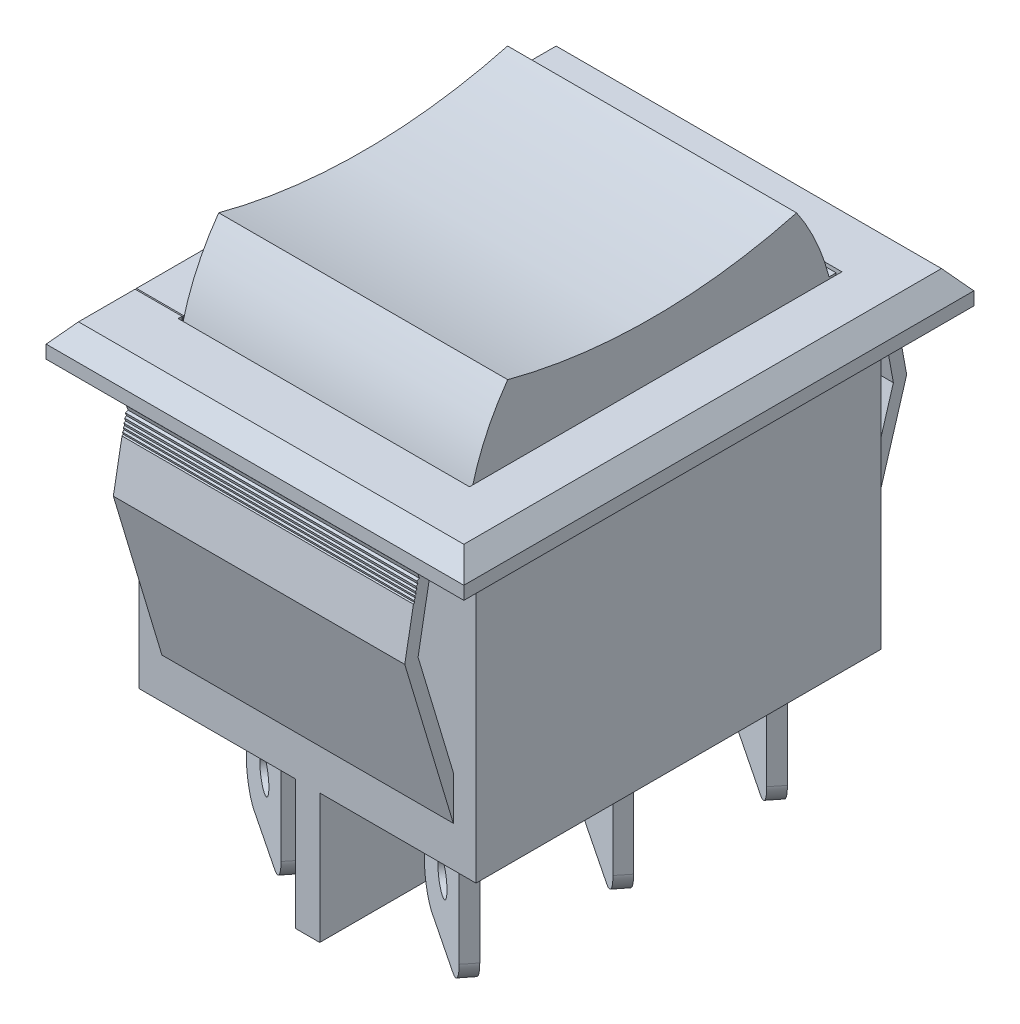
ISO-10303-21;
HEADER;
FILE_DESCRIPTION(('STEP AP214'),'2;1');
FILE_NAME('part.step','',(''),(''),'','','');
FILE_SCHEMA(('AUTOMOTIVE_DESIGN { 1 0 10303 214 1 1 1 1 }'));
ENDSEC;
DATA;
#1=APPLICATION_CONTEXT('core data for automotive mechanical design processes');
#2=APPLICATION_PROTOCOL_DEFINITION('international standard','automotive_design',2000,#1);
#3=PRODUCT_CONTEXT('',#1,'mechanical');
#4=PRODUCT('Part','Part','',(#3));
#5=PRODUCT_RELATED_PRODUCT_CATEGORY('part','',(#4));
#6=PRODUCT_DEFINITION_FORMATION('','',#4);
#7=PRODUCT_DEFINITION_CONTEXT('part definition',#1,'design');
#8=PRODUCT_DEFINITION('design','',#6,#7);
#9=PRODUCT_DEFINITION_SHAPE('','',#8);
#10=(LENGTH_UNIT() NAMED_UNIT(*) SI_UNIT(.MILLI.,.METRE.));
#11=(NAMED_UNIT(*) PLANE_ANGLE_UNIT() SI_UNIT($,.RADIAN.));
#12=(NAMED_UNIT(*) SI_UNIT($,.STERADIAN.) SOLID_ANGLE_UNIT());
#13=UNCERTAINTY_MEASURE_WITH_UNIT(LENGTH_MEASURE(1.E-05),#10,'distance_accuracy_value','');
#14=(GEOMETRIC_REPRESENTATION_CONTEXT(3) GLOBAL_UNCERTAINTY_ASSIGNED_CONTEXT((#13)) GLOBAL_UNIT_ASSIGNED_CONTEXT((#10,
#11,#12)) REPRESENTATION_CONTEXT('',''));
#15=CARTESIAN_POINT('',(0.,0.,0.));
#16=DIRECTION('',(0.,0.,1.));
#17=DIRECTION('',(1.,0.,0.));
#18=AXIS2_PLACEMENT_3D('',#15,#16,#17);
#19=CARTESIAN_POINT('',(8.9,19.0238159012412,-11.2426810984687));
#20=DIRECTION('',(0.,-1.,0.));
#21=DIRECTION('',(0.,0.,-1.));
#22=AXIS2_PLACEMENT_3D('',#19,#20,#21);
#23=PLANE('',#22);
#24=DIRECTION('',(-1.,0.,0.));
#25=VECTOR('',#24,1.);
#26=CARTESIAN_POINT('',(8.9,19.0238159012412,-10.806105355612));
#27=LINE('',#26,#25);
#28=CARTESIAN_POINT('',(8.9,19.0238159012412,-10.806105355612));
#29=VERTEX_POINT('',#28);
#30=CARTESIAN_POINT('',(-8.95,19.0238159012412,-10.806105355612));
#31=VERTEX_POINT('',#30);
#32=EDGE_CURVE('P0_E119',#29,#31,#27,.T.);
#33=ORIENTED_EDGE('',*,*,#32,.F.);
#34=DIRECTION('',(0.,0.,-1.));
#35=VECTOR('',#34,1.);
#36=CARTESIAN_POINT('',(8.9,19.0238159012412,-11.2426810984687));
#37=LINE('',#36,#35);
#38=CARTESIAN_POINT('',(8.9,19.0238159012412,-11.2426810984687));
#39=VERTEX_POINT('',#38);
#40=EDGE_CURVE('P0_E123',#39,#29,#37,.F.);
#41=ORIENTED_EDGE('',*,*,#40,.F.);
#42=DIRECTION('',(-1.,0.,0.));
#43=VECTOR('',#42,1.);
#44=CARTESIAN_POINT('',(0.,19.0238159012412,-11.2426810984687));
#45=LINE('',#44,#43);
#46=CARTESIAN_POINT('',(-8.95,19.0238159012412,-11.2426810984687));
#47=VERTEX_POINT('',#46);
#48=EDGE_CURVE('P0_E81',#47,#39,#45,.F.);
#49=ORIENTED_EDGE('',*,*,#48,.F.);
#50=DIRECTION('',(0.,0.,-1.));
#51=VECTOR('',#50,1.);
#52=CARTESIAN_POINT('',(-8.95,19.0238159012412,-11.2426810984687));
#53=LINE('',#52,#51);
#54=EDGE_CURVE('P0_E91',#31,#47,#53,.T.);
#55=ORIENTED_EDGE('',*,*,#54,.F.);
#56=EDGE_LOOP('',(#33,#41,#49,#55));
#57=FACE_BOUND('',#56,.T.);
#58=ADVANCED_FACE('P0_F16',(#57),#23,.F.);
#59=CARTESIAN_POINT('',(8.9,15.2732413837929,-2.32173018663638));
#60=DIRECTION('',(-1.,0.,0.));
#61=DIRECTION('',(0.,0.,1.));
#62=AXIS2_PLACEMENT_3D('',#59,#60,#61);
#63=CYLINDRICAL_SURFACE('',#62,13.9999999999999);
#64=CARTESIAN_POINT('',(8.9,15.2732413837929,-2.32173018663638));
#65=DIRECTION('',(-1.,0.,0.));
#66=DIRECTION('',(0.,0.,1.));
#67=AXIS2_PLACEMENT_3D('',#64,#65,#66);
#68=CIRCLE('',#67,13.9999999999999);
#69=CARTESIAN_POINT('',(8.9,23.4510900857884,9.04149077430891));
#70=VERTEX_POINT('',#69);
#71=CARTESIAN_POINT('',(8.9,18.6805021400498,11.2573189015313));
#72=VERTEX_POINT('',#71);
#73=EDGE_CURVE('P0_E20',#70,#72,#68,.F.);
#74=ORIENTED_EDGE('',*,*,#73,.F.);
#75=DIRECTION('',(-1.,0.,0.));
#76=VECTOR('',#75,1.);
#77=CARTESIAN_POINT('',(8.9,23.4510900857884,9.04149077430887));
#78=LINE('',#77,#76);
#79=CARTESIAN_POINT('',(-8.95,23.4510900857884,9.04149077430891));
#80=VERTEX_POINT('',#79);
#81=EDGE_CURVE('P0_E74',#70,#80,#78,.T.);
#82=ORIENTED_EDGE('',*,*,#81,.T.);
#83=CARTESIAN_POINT('',(-8.95,15.2732413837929,-2.32173018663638));
#84=DIRECTION('',(-1.,0.,0.));
#85=DIRECTION('',(0.,0.,1.));
#86=AXIS2_PLACEMENT_3D('',#83,#84,#85);
#87=CIRCLE('',#86,13.9999999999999);
#88=CARTESIAN_POINT('',(-8.95,18.6805021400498,11.2573189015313));
#89=VERTEX_POINT('',#88);
#90=EDGE_CURVE('P0_E100',#89,#80,#87,.T.);
#91=ORIENTED_EDGE('',*,*,#90,.F.);
#92=DIRECTION('',(1.,0.,0.));
#93=VECTOR('',#92,1.);
#94=CARTESIAN_POINT('',(0.,18.6805021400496,11.2573189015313));
#95=LINE('',#94,#93);
#96=EDGE_CURVE('P0_E76',#72,#89,#95,.F.);
#97=ORIENTED_EDGE('',*,*,#96,.F.);
#98=EDGE_LOOP('',(#74,#82,#91,#97));
#99=FACE_BOUND('',#98,.T.);
#100=ADVANCED_FACE('P0_F73',(#99),#63,.T.);
#101=CARTESIAN_POINT('',(8.9,57.0454062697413,0.119053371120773));
#102=DIRECTION('',(-1.,0.,0.));
#103=DIRECTION('',(0.,0.,1.));
#104=AXIS2_PLACEMENT_3D('',#101,#102,#103);
#105=CYLINDRICAL_SURFACE('',#104,34.7589983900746);
#106=ORIENTED_EDGE('',*,*,#81,.F.);
#107=CARTESIAN_POINT('',(8.9,57.0454062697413,0.119053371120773));
#108=DIRECTION('',(-1.,0.,0.));
#109=DIRECTION('',(0.,0.,1.));
#110=AXIS2_PLACEMENT_3D('',#107,#108,#109);
#111=CIRCLE('',#110,34.7589983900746);
#112=CARTESIAN_POINT('',(8.9,23.4510900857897,-8.80338403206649));
#113=VERTEX_POINT('',#112);
#114=EDGE_CURVE('P0_E85',#113,#70,#111,.T.);
#115=ORIENTED_EDGE('',*,*,#114,.F.);
#116=DIRECTION('',(-1.,0.,0.));
#117=VECTOR('',#116,1.);
#118=CARTESIAN_POINT('',(8.9,23.4510900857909,-8.80338403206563));
#119=LINE('',#118,#117);
#120=CARTESIAN_POINT('',(-8.95,23.4510900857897,-8.8033840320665));
#121=VERTEX_POINT('',#120);
#122=EDGE_CURVE('P0_E90',#121,#113,#119,.F.);
#123=ORIENTED_EDGE('',*,*,#122,.F.);
#124=CARTESIAN_POINT('',(-8.95,57.0454062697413,0.119053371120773));
#125=DIRECTION('',(-1.,0.,0.));
#126=DIRECTION('',(0.,0.,1.));
#127=AXIS2_PLACEMENT_3D('',#124,#125,#126);
#128=CIRCLE('',#127,34.7589983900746);
#129=EDGE_CURVE('P0_E88',#80,#121,#128,.F.);
#130=ORIENTED_EDGE('',*,*,#129,.F.);
#131=EDGE_LOOP('',(#106,#115,#123,#130));
#132=FACE_BOUND('',#131,.T.);
#133=ADVANCED_FACE('P0_F84',(#132),#105,.F.);
#134=CARTESIAN_POINT('',(8.9,15.5548791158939,2.75731890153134));
#135=DIRECTION('',(-1.,0.,0.));
#136=DIRECTION('',(0.,0.,1.));
#137=AXIS2_PLACEMENT_3D('',#134,#135,#136);
#138=CYLINDRICAL_SURFACE('',#137,14.);
#139=CARTESIAN_POINT('',(8.9,15.5548791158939,2.75731890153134));
#140=DIRECTION('',(-1.,0.,0.));
#141=DIRECTION('',(0.,0.,1.));
#142=AXIS2_PLACEMENT_3D('',#139,#140,#141);
#143=CIRCLE('',#142,14.);
#144=EDGE_CURVE('P0_E95',#29,#113,#143,.F.);
#145=ORIENTED_EDGE('',*,*,#144,.F.);
#146=ORIENTED_EDGE('',*,*,#32,.T.);
#147=CARTESIAN_POINT('',(-8.95,15.5548791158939,2.75731890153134));
#148=DIRECTION('',(-1.,0.,0.));
#149=DIRECTION('',(0.,0.,1.));
#150=AXIS2_PLACEMENT_3D('',#147,#148,#149);
#151=CIRCLE('',#150,14.);
#152=EDGE_CURVE('P0_E103',#121,#31,#151,.T.);
#153=ORIENTED_EDGE('',*,*,#152,.F.);
#154=ORIENTED_EDGE('',*,*,#122,.T.);
#155=EDGE_LOOP('',(#145,#146,#153,#154));
#156=FACE_BOUND('',#155,.T.);
#157=ADVANCED_FACE('P0_F164',(#156),#138,.T.);
#158=CARTESIAN_POINT('',(0.,13.4510900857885,-11.2426810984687));
#159=DIRECTION('',(0.,0.,-1.));
#160=DIRECTION('',(-1.,0.,0.));
#161=AXIS2_PLACEMENT_3D('',#158,#159,#160);
#162=PLANE('',#161);
#163=DIRECTION('',(1.,0.,0.));
#164=VECTOR('',#163,1.);
#165=CARTESIAN_POINT('',(0.,13.4510900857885,-11.2426810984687));
#166=LINE('',#165,#164);
#167=CARTESIAN_POINT('',(-8.95,13.4510900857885,-11.2426810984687));
#168=VERTEX_POINT('',#167);
#169=CARTESIAN_POINT('',(8.9,13.4510900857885,-11.2426810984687));
#170=VERTEX_POINT('',#169);
#171=EDGE_CURVE('P0_E132',#168,#170,#166,.T.);
#172=ORIENTED_EDGE('',*,*,#171,.F.);
#173=DIRECTION('',(0.,1.,0.));
#174=VECTOR('',#173,1.);
#175=CARTESIAN_POINT('',(-8.95,18.4510900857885,-11.2426810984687));
#176=LINE('',#175,#174);
#177=EDGE_CURVE('P0_E106',#47,#168,#176,.F.);
#178=ORIENTED_EDGE('',*,*,#177,.F.);
#179=ORIENTED_EDGE('',*,*,#48,.T.);
#180=DIRECTION('',(0.,1.,0.));
#181=VECTOR('',#180,1.);
#182=CARTESIAN_POINT('',(8.9,18.4510900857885,-11.2426810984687));
#183=LINE('',#182,#181);
#184=EDGE_CURVE('P0_E80',#170,#39,#183,.T.);
#185=ORIENTED_EDGE('',*,*,#184,.F.);
#186=EDGE_LOOP('',(#172,#178,#179,#185));
#187=FACE_BOUND('',#186,.T.);
#188=ADVANCED_FACE('P0_F158',(#187),#162,.T.);
#189=CARTESIAN_POINT('',(8.9,18.4510900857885,0.00731890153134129));
#190=DIRECTION('',(1.,0.,0.));
#191=DIRECTION('',(0.,0.,-1.));
#192=AXIS2_PLACEMENT_3D('',#189,#190,#191);
#193=PLANE('',#192);
#194=ORIENTED_EDGE('',*,*,#144,.T.);
#195=ORIENTED_EDGE('',*,*,#114,.T.);
#196=ORIENTED_EDGE('',*,*,#73,.T.);
#197=DIRECTION('',(0.,1.,0.));
#198=VECTOR('',#197,1.);
#199=CARTESIAN_POINT('',(8.9,23.4510900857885,11.2573189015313));
#200=LINE('',#199,#198);
#201=CARTESIAN_POINT('',(8.9,13.4510900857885,11.2573189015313));
#202=VERTEX_POINT('',#201);
#203=EDGE_CURVE('P0_E97',#202,#72,#200,.T.);
#204=ORIENTED_EDGE('',*,*,#203,.F.);
#205=DIRECTION('',(0.,0.,-1.));
#206=VECTOR('',#205,1.);
#207=CARTESIAN_POINT('',(8.9,13.4510900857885,11.2573189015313));
#208=LINE('',#207,#206);
#209=EDGE_CURVE('P0_E129',#170,#202,#208,.F.);
#210=ORIENTED_EDGE('',*,*,#209,.F.);
#211=ORIENTED_EDGE('',*,*,#184,.T.);
#212=ORIENTED_EDGE('',*,*,#40,.T.);
#213=EDGE_LOOP('',(#194,#195,#196,#204,#210,#211,#212));
#214=FACE_BOUND('',#213,.T.);
#215=ADVANCED_FACE('P0_F93',(#214),#193,.T.);
#216=CARTESIAN_POINT('',(0.,23.4510900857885,11.2573189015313));
#217=DIRECTION('',(0.,0.,1.));
#218=DIRECTION('',(1.,0.,0.));
#219=AXIS2_PLACEMENT_3D('',#216,#217,#218);
#220=PLANE('',#219);
#221=DIRECTION('',(1.,0.,0.));
#222=VECTOR('',#221,1.);
#223=CARTESIAN_POINT('',(0.,13.4510900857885,11.2573189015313));
#224=LINE('',#223,#222);
#225=CARTESIAN_POINT('',(-8.95,13.4510900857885,11.2573189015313));
#226=VERTEX_POINT('',#225);
#227=EDGE_CURVE('P0_E26',#202,#226,#224,.F.);
#228=ORIENTED_EDGE('',*,*,#227,.F.);
#229=ORIENTED_EDGE('',*,*,#203,.T.);
#230=ORIENTED_EDGE('',*,*,#96,.T.);
#231=DIRECTION('',(0.,1.,0.));
#232=VECTOR('',#231,1.);
#233=CARTESIAN_POINT('',(-8.95,18.4510900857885,11.2573189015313));
#234=LINE('',#233,#232);
#235=EDGE_CURVE('P0_E35',#226,#89,#234,.T.);
#236=ORIENTED_EDGE('',*,*,#235,.F.);
#237=EDGE_LOOP('',(#228,#229,#230,#236));
#238=FACE_BOUND('',#237,.T.);
#239=ADVANCED_FACE('P0_F154',(#238),#220,.T.);
#240=CARTESIAN_POINT('',(-8.95,18.4510900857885,0.00731890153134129));
#241=DIRECTION('',(-1.,0.,0.));
#242=DIRECTION('',(0.,0.,1.));
#243=AXIS2_PLACEMENT_3D('',#240,#241,#242);
#244=PLANE('',#243);
#245=DIRECTION('',(0.,0.,-1.));
#246=VECTOR('',#245,1.);
#247=CARTESIAN_POINT('',(-8.95,13.4510900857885,11.2573189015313));
#248=LINE('',#247,#246);
#249=EDGE_CURVE('P0_E11',#226,#168,#248,.T.);
#250=ORIENTED_EDGE('',*,*,#249,.F.);
#251=ORIENTED_EDGE('',*,*,#235,.T.);
#252=ORIENTED_EDGE('',*,*,#90,.T.);
#253=ORIENTED_EDGE('',*,*,#129,.T.);
#254=ORIENTED_EDGE('',*,*,#152,.T.);
#255=ORIENTED_EDGE('',*,*,#54,.T.);
#256=ORIENTED_EDGE('',*,*,#177,.T.);
#257=EDGE_LOOP('',(#250,#251,#252,#253,#254,#255,#256));
#258=FACE_BOUND('',#257,.T.);
#259=ADVANCED_FACE('P0_F150',(#258),#244,.T.);
#260=CARTESIAN_POINT('',(0.,13.4510900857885,11.2573189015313));
#261=DIRECTION('',(0.,-1.,0.));
#262=DIRECTION('',(0.,0.,-1.));
#263=AXIS2_PLACEMENT_3D('',#260,#261,#262);
#264=PLANE('',#263);
#265=ORIENTED_EDGE('',*,*,#227,.T.);
#266=ORIENTED_EDGE('',*,*,#249,.T.);
#267=ORIENTED_EDGE('',*,*,#171,.T.);
#268=ORIENTED_EDGE('',*,*,#209,.T.);
#269=EDGE_LOOP('',(#265,#266,#267,#268));
#270=FACE_BOUND('',#269,.T.);
#271=ADVANCED_FACE('P0_F18',(#270),#264,.T.);
#272=CLOSED_SHELL('',(#58,#100,#133,#157,#188,#215,#239,#259,#271));
#273=MANIFOLD_SOLID_BREP('P0_B1',#272);
#274=CARTESIAN_POINT('',(0.,15.3251669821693,-14.804515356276));
#275=DIRECTION('',(0.,0.307353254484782,0.951595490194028));
#276=DIRECTION('',(0.,-0.951595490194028,0.307353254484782));
#277=AXIS2_PLACEMENT_3D('',#274,#275,#276);
#278=PLANE('',#277);
#279=DIRECTION('',(0.,-0.951595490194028,0.307353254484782));
#280=VECTOR('',#279,1.);
#281=CARTESIAN_POINT('',(-9.,15.3251669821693,-14.804515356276));
#282=LINE('',#281,#280);
#283=CARTESIAN_POINT('',(-9.,15.3251669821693,-14.804515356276));
#284=VERTEX_POINT('',#283);
#285=CARTESIAN_POINT('',(-9.,15.1470329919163,-14.7469803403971));
#286=VERTEX_POINT('',#285);
#287=EDGE_CURVE('P1_E2320',#284,#286,#282,.T.);
#288=ORIENTED_EDGE('',*,*,#287,.F.);
#289=DIRECTION('',(1.,0.,0.));
#290=VECTOR('',#289,1.);
#291=CARTESIAN_POINT('',(0.,15.3251669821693,-14.804515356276));
#292=LINE('',#291,#290);
#293=CARTESIAN_POINT('',(9.,15.3251669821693,-14.804515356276));
#294=VERTEX_POINT('',#293);
#295=EDGE_CURVE('P1_E2324',#284,#294,#292,.T.);
#296=ORIENTED_EDGE('',*,*,#295,.T.);
#297=DIRECTION('',(0.,-0.951595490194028,0.307353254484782));
#298=VECTOR('',#297,1.);
#299=CARTESIAN_POINT('',(9.,15.3251669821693,-14.804515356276));
#300=LINE('',#299,#298);
#301=CARTESIAN_POINT('',(9.,15.1470329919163,-14.7469803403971));
#302=VERTEX_POINT('',#301);
#303=EDGE_CURVE('P1_E2335',#302,#294,#300,.F.);
#304=ORIENTED_EDGE('',*,*,#303,.F.);
#305=DIRECTION('',(1.,0.,0.));
#306=VECTOR('',#305,1.);
#307=CARTESIAN_POINT('',(0.,15.1470329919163,-14.7469803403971));
#308=LINE('',#307,#306);
#309=EDGE_CURVE('P1_E2328',#302,#286,#308,.F.);
#310=ORIENTED_EDGE('',*,*,#309,.T.);
#311=EDGE_LOOP('',(#288,#296,#304,#310));
#312=FACE_BOUND('',#311,.T.);
#313=ADVANCED_FACE('P1_F16',(#312),#278,.F.);
#314=CARTESIAN_POINT('',(0.,15.3251669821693,14.804515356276));
#315=DIRECTION('',(0.,-0.307353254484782,0.951595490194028));
#316=DIRECTION('',(0.,-0.951595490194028,-0.307353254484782));
#317=AXIS2_PLACEMENT_3D('',#314,#315,#316);
#318=PLANE('',#317);
#319=DIRECTION('',(1.,0.,0.));
#320=VECTOR('',#319,1.);
#321=CARTESIAN_POINT('',(0.,15.3251669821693,14.804515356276));
#322=LINE('',#321,#320);
#323=CARTESIAN_POINT('',(-9.,15.3251669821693,14.804515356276));
#324=VERTEX_POINT('',#323);
#325=CARTESIAN_POINT('',(9.,15.3251669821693,14.804515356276));
#326=VERTEX_POINT('',#325);
#327=EDGE_CURVE('P1_E2344',#324,#326,#322,.T.);
#328=ORIENTED_EDGE('',*,*,#327,.F.);
#329=DIRECTION('',(0.,-0.951595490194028,-0.307353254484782));
#330=VECTOR('',#329,1.);
#331=CARTESIAN_POINT('',(-9.,15.3251669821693,14.804515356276));
#332=LINE('',#331,#330);
#333=CARTESIAN_POINT('',(-9.,15.1470329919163,14.7469803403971));
#334=VERTEX_POINT('',#333);
#335=EDGE_CURVE('P1_E2806',#324,#334,#332,.T.);
#336=ORIENTED_EDGE('',*,*,#335,.T.);
#337=DIRECTION('',(1.,0.,0.));
#338=VECTOR('',#337,1.);
#339=CARTESIAN_POINT('',(0.,15.1470329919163,14.7469803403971));
#340=LINE('',#339,#338);
#341=CARTESIAN_POINT('',(9.,15.1470329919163,14.7469803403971));
#342=VERTEX_POINT('',#341);
#343=EDGE_CURVE('P1_E2366',#342,#334,#340,.F.);
#344=ORIENTED_EDGE('',*,*,#343,.F.);
#345=DIRECTION('',(0.,-0.951595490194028,-0.307353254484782));
#346=VECTOR('',#345,1.);
#347=CARTESIAN_POINT('',(9.,15.3251669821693,14.804515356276));
#348=LINE('',#347,#346);
#349=EDGE_CURVE('P1_E2334',#342,#326,#348,.F.);
#350=ORIENTED_EDGE('',*,*,#349,.T.);
#351=EDGE_LOOP('',(#328,#336,#344,#350));
#352=FACE_BOUND('',#351,.T.);
#353=ADVANCED_FACE('P1_F2298',(#352),#318,.T.);
#354=CARTESIAN_POINT('',(0.,15.1470329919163,-14.7469803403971));
#355=DIRECTION('',(0.,-0.83933127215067,0.543620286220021));
#356=DIRECTION('',(0.,-0.543620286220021,-0.83933127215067));
#357=AXIS2_PLACEMENT_3D('',#354,#355,#356);
#358=PLANE('',#357);
#359=DIRECTION('',(0.,-0.543620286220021,-0.83933127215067));
#360=VECTOR('',#359,1.);
#361=CARTESIAN_POINT('',(-9.00000000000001,15.1470329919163,-14.7469803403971));
#362=LINE('',#361,#360);
#363=CARTESIAN_POINT('',(-9.00000000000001,15.0810173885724,-14.8489061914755));
#364=VERTEX_POINT('',#363);
#365=EDGE_CURVE('P1_E2355',#286,#364,#362,.T.);
#366=ORIENTED_EDGE('',*,*,#365,.F.);
#367=ORIENTED_EDGE('',*,*,#309,.F.);
#368=DIRECTION('',(0.,-0.543620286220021,-0.83933127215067));
#369=VECTOR('',#368,1.);
#370=CARTESIAN_POINT('',(9.00000000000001,15.1470329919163,-14.7469803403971));
#371=LINE('',#370,#369);
#372=CARTESIAN_POINT('',(9.00000000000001,15.0810173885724,-14.8489061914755));
#373=VERTEX_POINT('',#372);
#374=EDGE_CURVE('P1_E2351',#373,#302,#371,.F.);
#375=ORIENTED_EDGE('',*,*,#374,.F.);
#376=DIRECTION('',(1.,0.,0.));
#377=VECTOR('',#376,1.);
#378=CARTESIAN_POINT('',(0.,15.0810173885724,-14.8489061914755));
#379=LINE('',#378,#377);
#380=EDGE_CURVE('P1_E2375',#373,#364,#379,.F.);
#381=ORIENTED_EDGE('',*,*,#380,.T.);
#382=EDGE_LOOP('',(#366,#367,#375,#381));
#383=FACE_BOUND('',#382,.T.);
#384=ADVANCED_FACE('P1_F2290',(#383),#358,.F.);
#385=CARTESIAN_POINT('',(0.,15.3996958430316,-14.6894453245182));
#386=DIRECTION('',(0.,-0.839331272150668,0.543620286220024));
#387=DIRECTION('',(0.,-0.543620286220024,-0.839331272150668));
#388=AXIS2_PLACEMENT_3D('',#385,#386,#387);
#389=PLANE('',#388);
#390=DIRECTION('',(0.,-0.543620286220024,-0.839331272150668));
#391=VECTOR('',#390,1.);
#392=CARTESIAN_POINT('',(-9.,15.3996958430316,-14.6894453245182));
#393=LINE('',#392,#391);
#394=CARTESIAN_POINT('',(-9.,15.3996958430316,-14.6894453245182));
#395=VERTEX_POINT('',#394);
#396=EDGE_CURVE('P1_E2340',#395,#284,#393,.T.);
#397=ORIENTED_EDGE('',*,*,#396,.F.);
#398=DIRECTION('',(1.,0.,0.));
#399=VECTOR('',#398,1.);
#400=CARTESIAN_POINT('',(0.,15.3996958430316,-14.6894453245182));
#401=LINE('',#400,#399);
#402=CARTESIAN_POINT('',(9.,15.3996958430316,-14.6894453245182));
#403=VERTEX_POINT('',#402);
#404=EDGE_CURVE('P1_E2380',#395,#403,#401,.T.);
#405=ORIENTED_EDGE('',*,*,#404,.T.);
#406=DIRECTION('',(0.,-0.543620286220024,-0.839331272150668));
#407=VECTOR('',#406,1.);
#408=CARTESIAN_POINT('',(9.,15.3996958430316,-14.6894453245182));
#409=LINE('',#408,#407);
#410=EDGE_CURVE('P1_E2343',#294,#403,#409,.F.);
#411=ORIENTED_EDGE('',*,*,#410,.F.);
#412=ORIENTED_EDGE('',*,*,#295,.F.);
#413=EDGE_LOOP('',(#397,#405,#411,#412));
#414=FACE_BOUND('',#413,.T.);
#415=ADVANCED_FACE('P1_F2282',(#414),#389,.F.);
#416=CARTESIAN_POINT('',(0.,15.3996958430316,14.6894453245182));
#417=DIRECTION('',(0.,0.839331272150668,0.543620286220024));
#418=DIRECTION('',(0.,-0.543620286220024,0.839331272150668));
#419=AXIS2_PLACEMENT_3D('',#416,#417,#418);
#420=PLANE('',#419);
#421=DIRECTION('',(1.,0.,0.));
#422=VECTOR('',#421,1.);
#423=CARTESIAN_POINT('',(0.,15.3996958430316,14.6894453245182));
#424=LINE('',#423,#422);
#425=CARTESIAN_POINT('',(-9.,15.3996958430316,14.6894453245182));
#426=VERTEX_POINT('',#425);
#427=CARTESIAN_POINT('',(9.,15.3996958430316,14.6894453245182));
#428=VERTEX_POINT('',#427);
#429=EDGE_CURVE('P1_E2382',#426,#428,#424,.T.);
#430=ORIENTED_EDGE('',*,*,#429,.F.);
#431=DIRECTION('',(0.,-0.543620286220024,0.839331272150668));
#432=VECTOR('',#431,1.);
#433=CARTESIAN_POINT('',(-9.,15.3996958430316,14.6894453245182));
#434=LINE('',#433,#432);
#435=EDGE_CURVE('P1_E2356',#426,#324,#434,.T.);
#436=ORIENTED_EDGE('',*,*,#435,.T.);
#437=ORIENTED_EDGE('',*,*,#327,.T.);
#438=DIRECTION('',(0.,-0.543620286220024,0.839331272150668));
#439=VECTOR('',#438,1.);
#440=CARTESIAN_POINT('',(9.,15.3996958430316,14.6894453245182));
#441=LINE('',#440,#439);
#442=EDGE_CURVE('P1_E2347',#326,#428,#441,.F.);
#443=ORIENTED_EDGE('',*,*,#442,.T.);
#444=EDGE_LOOP('',(#430,#436,#437,#443));
#445=FACE_BOUND('',#444,.T.);
#446=ADVANCED_FACE('P1_F2274',(#445),#420,.T.);
#447=CARTESIAN_POINT('',(0.,15.1470329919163,14.7469803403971));
#448=DIRECTION('',(0.,0.83933127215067,0.543620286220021));
#449=DIRECTION('',(0.,-0.543620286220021,0.83933127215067));
#450=AXIS2_PLACEMENT_3D('',#447,#448,#449);
#451=PLANE('',#450);
#452=ORIENTED_EDGE('',*,*,#343,.T.);
#453=DIRECTION('',(0.,-0.543620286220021,0.83933127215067));
#454=VECTOR('',#453,1.);
#455=CARTESIAN_POINT('',(-9.00000000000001,15.1470329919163,14.7469803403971));
#456=LINE('',#455,#454);
#457=CARTESIAN_POINT('',(-9.00000000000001,15.0810173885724,14.8489061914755));
#458=VERTEX_POINT('',#457);
#459=EDGE_CURVE('P1_E2362',#334,#458,#456,.T.);
#460=ORIENTED_EDGE('',*,*,#459,.T.);
#461=DIRECTION('',(1.,0.,0.));
#462=VECTOR('',#461,1.);
#463=CARTESIAN_POINT('',(0.,15.0810173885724,14.8489061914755));
#464=LINE('',#463,#462);
#465=CARTESIAN_POINT('',(9.,15.0810173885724,14.8489061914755));
#466=VERTEX_POINT('',#465);
#467=EDGE_CURVE('P1_E2401',#466,#458,#464,.F.);
#468=ORIENTED_EDGE('',*,*,#467,.F.);
#469=DIRECTION('',(0.,-0.543620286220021,0.83933127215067));
#470=VECTOR('',#469,1.);
#471=CARTESIAN_POINT('',(9.00000000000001,15.1470329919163,14.7469803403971));
#472=LINE('',#471,#470);
#473=EDGE_CURVE('P1_E2359',#466,#342,#472,.F.);
#474=ORIENTED_EDGE('',*,*,#473,.T.);
#475=EDGE_LOOP('',(#452,#460,#468,#474));
#476=FACE_BOUND('',#475,.T.);
#477=ADVANCED_FACE('P1_F2266',(#476),#451,.T.);
#478=CARTESIAN_POINT('',(0.,15.0810173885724,-14.8489061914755));
#479=DIRECTION('',(0.,0.307353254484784,0.951595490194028));
#480=DIRECTION('',(0.,-0.951595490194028,0.307353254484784));
#481=AXIS2_PLACEMENT_3D('',#478,#479,#480);
#482=PLANE('',#481);
#483=DIRECTION('',(0.,-0.951595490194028,0.307353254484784));
#484=VECTOR('',#483,1.);
#485=CARTESIAN_POINT('',(-9.00000000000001,15.0810173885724,-14.8489061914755));
#486=LINE('',#485,#484);
#487=CARTESIAN_POINT('',(-9.00000000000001,14.9232312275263,-14.7979432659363));
#488=VERTEX_POINT('',#487);
#489=EDGE_CURVE('P1_E2371',#364,#488,#486,.T.);
#490=ORIENTED_EDGE('',*,*,#489,.F.);
#491=ORIENTED_EDGE('',*,*,#380,.F.);
#492=DIRECTION('',(0.,-0.951595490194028,0.307353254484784));
#493=VECTOR('',#492,1.);
#494=CARTESIAN_POINT('',(9.00000000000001,15.0810173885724,-14.8489061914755));
#495=LINE('',#494,#493);
#496=CARTESIAN_POINT('',(9.,14.9232312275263,-14.7979432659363));
#497=VERTEX_POINT('',#496);
#498=EDGE_CURVE('P1_E2365',#497,#373,#495,.F.);
#499=ORIENTED_EDGE('',*,*,#498,.F.);
#500=DIRECTION('',(1.,0.,0.));
#501=VECTOR('',#500,1.);
#502=CARTESIAN_POINT('',(0.,14.9232312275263,-14.7979432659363));
#503=LINE('',#502,#501);
#504=EDGE_CURVE('P1_E2410',#497,#488,#503,.F.);
#505=ORIENTED_EDGE('',*,*,#504,.T.);
#506=EDGE_LOOP('',(#490,#491,#499,#505));
#507=FACE_BOUND('',#506,.T.);
#508=ADVANCED_FACE('P1_F2258',(#507),#482,.F.);
#509=CARTESIAN_POINT('',(0.,15.5867983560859,-14.7569460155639));
#510=DIRECTION('',(0.,0.339359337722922,0.940656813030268));
#511=DIRECTION('',(0.,-0.940656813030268,0.339359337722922));
#512=AXIS2_PLACEMENT_3D('',#509,#510,#511);
#513=PLANE('',#512);
#514=DIRECTION('',(0.,-0.940656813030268,0.339359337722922));
#515=VECTOR('',#514,1.);
#516=CARTESIAN_POINT('',(-9.00000000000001,15.5867983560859,-14.7569460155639));
#517=LINE('',#516,#515);
#518=CARTESIAN_POINT('',(-9.,15.5867983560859,-14.7569460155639));
#519=VERTEX_POINT('',#518);
#520=EDGE_CURVE('P1_E2383',#519,#395,#517,.T.);
#521=ORIENTED_EDGE('',*,*,#520,.F.);
#522=DIRECTION('',(1.,0.,0.));
#523=VECTOR('',#522,1.);
#524=CARTESIAN_POINT('',(0.,15.5867983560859,-14.7569460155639));
#525=LINE('',#524,#523);
#526=CARTESIAN_POINT('',(9.,15.5867983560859,-14.7569460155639));
#527=VERTEX_POINT('',#526);
#528=EDGE_CURVE('P1_E2415',#519,#527,#525,.T.);
#529=ORIENTED_EDGE('',*,*,#528,.T.);
#530=DIRECTION('',(0.,-0.940656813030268,0.339359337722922));
#531=VECTOR('',#530,1.);
#532=CARTESIAN_POINT('',(9.00000000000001,15.5867983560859,-14.7569460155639));
#533=LINE('',#532,#531);
#534=EDGE_CURVE('P1_E2374',#403,#527,#533,.F.);
#535=ORIENTED_EDGE('',*,*,#534,.F.);
#536=ORIENTED_EDGE('',*,*,#404,.F.);
#537=EDGE_LOOP('',(#521,#529,#535,#536));
#538=FACE_BOUND('',#537,.T.);
#539=ADVANCED_FACE('P1_F2250',(#538),#513,.F.);
#540=CARTESIAN_POINT('',(0.,15.5867983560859,14.7569460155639));
#541=DIRECTION('',(0.,-0.339359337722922,0.940656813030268));
#542=DIRECTION('',(0.,-0.940656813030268,-0.339359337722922));
#543=AXIS2_PLACEMENT_3D('',#540,#541,#542);
#544=PLANE('',#543);
#545=DIRECTION('',(1.,0.,0.));
#546=VECTOR('',#545,1.);
#547=CARTESIAN_POINT('',(0.,15.5867983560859,14.7569460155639));
#548=LINE('',#547,#546);
#549=CARTESIAN_POINT('',(-9.,15.5867983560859,14.7569460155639));
#550=VERTEX_POINT('',#549);
#551=CARTESIAN_POINT('',(9.00000000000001,15.5867983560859,14.7569460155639));
#552=VERTEX_POINT('',#551);
#553=EDGE_CURVE('P1_E2418',#550,#552,#548,.T.);
#554=ORIENTED_EDGE('',*,*,#553,.F.);
#555=DIRECTION('',(0.,-0.940656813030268,-0.339359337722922));
#556=VECTOR('',#555,1.);
#557=CARTESIAN_POINT('',(-9.00000000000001,15.5867983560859,14.7569460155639));
#558=LINE('',#557,#556);
#559=EDGE_CURVE('P1_E2388',#550,#426,#558,.T.);
#560=ORIENTED_EDGE('',*,*,#559,.T.);
#561=ORIENTED_EDGE('',*,*,#429,.T.);
#562=DIRECTION('',(0.,-0.940656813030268,-0.339359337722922));
#563=VECTOR('',#562,1.);
#564=CARTESIAN_POINT('',(9.00000000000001,15.5867983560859,14.7569460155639));
#565=LINE('',#564,#563);
#566=EDGE_CURVE('P1_E2392',#428,#552,#565,.F.);
#567=ORIENTED_EDGE('',*,*,#566,.T.);
#568=EDGE_LOOP('',(#554,#560,#561,#567));
#569=FACE_BOUND('',#568,.T.);
#570=ADVANCED_FACE('P1_F2242',(#569),#544,.T.);
#571=CARTESIAN_POINT('',(0.,15.0810173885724,14.8489061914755));
#572=DIRECTION('',(0.,-0.307353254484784,0.951595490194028));
#573=DIRECTION('',(0.,-0.951595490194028,-0.307353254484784));
#574=AXIS2_PLACEMENT_3D('',#571,#572,#573);
#575=PLANE('',#574);
#576=ORIENTED_EDGE('',*,*,#467,.T.);
#577=DIRECTION('',(0.,-0.951595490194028,-0.307353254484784));
#578=VECTOR('',#577,1.);
#579=CARTESIAN_POINT('',(-9.00000000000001,15.0810173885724,14.8489061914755));
#580=LINE('',#579,#578);
#581=CARTESIAN_POINT('',(-9.,14.9232312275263,14.7979432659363));
#582=VERTEX_POINT('',#581);
#583=EDGE_CURVE('P1_E2397',#458,#582,#580,.T.);
#584=ORIENTED_EDGE('',*,*,#583,.T.);
#585=DIRECTION('',(1.,0.,0.));
#586=VECTOR('',#585,1.);
#587=CARTESIAN_POINT('',(0.,14.9232312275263,14.7979432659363));
#588=LINE('',#587,#586);
#589=CARTESIAN_POINT('',(9.,14.9232312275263,14.7979432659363));
#590=VERTEX_POINT('',#589);
#591=EDGE_CURVE('P1_E2437',#590,#582,#588,.F.);
#592=ORIENTED_EDGE('',*,*,#591,.F.);
#593=DIRECTION('',(0.,-0.951595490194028,-0.307353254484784));
#594=VECTOR('',#593,1.);
#595=CARTESIAN_POINT('',(9.00000000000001,15.0810173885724,14.8489061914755));
#596=LINE('',#595,#594);
#597=EDGE_CURVE('P1_E2391',#590,#466,#596,.F.);
#598=ORIENTED_EDGE('',*,*,#597,.T.);
#599=EDGE_LOOP('',(#576,#584,#592,#598));
#600=FACE_BOUND('',#599,.T.);
#601=ADVANCED_FACE('P1_F2234',(#600),#575,.T.);
#602=CARTESIAN_POINT('',(0.,14.9232312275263,-14.7979432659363));
#603=DIRECTION('',(0.,-0.839331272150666,0.543620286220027));
#604=DIRECTION('',(0.,-0.543620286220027,-0.839331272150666));
#605=AXIS2_PLACEMENT_3D('',#602,#603,#604);
#606=PLANE('',#605);
#607=DIRECTION('',(0.,-0.543620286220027,-0.839331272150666));
#608=VECTOR('',#607,1.);
#609=CARTESIAN_POINT('',(-9.,14.9232312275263,-14.7979432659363));
#610=LINE('',#609,#608);
#611=CARTESIAN_POINT('',(-9.,14.8647564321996,-14.8882263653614));
#612=VERTEX_POINT('',#611);
#613=EDGE_CURVE('P1_E2406',#488,#612,#610,.T.);
#614=ORIENTED_EDGE('',*,*,#613,.F.);
#615=ORIENTED_EDGE('',*,*,#504,.F.);
#616=DIRECTION('',(0.,-0.543620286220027,-0.839331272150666));
#617=VECTOR('',#616,1.);
#618=CARTESIAN_POINT('',(9.,14.9232312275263,-14.7979432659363));
#619=LINE('',#618,#617);
#620=CARTESIAN_POINT('',(9.,14.8647564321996,-14.8882263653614));
#621=VERTEX_POINT('',#620);
#622=EDGE_CURVE('P1_E2400',#621,#497,#619,.F.);
#623=ORIENTED_EDGE('',*,*,#622,.F.);
#624=DIRECTION('',(1.,0.,0.));
#625=VECTOR('',#624,1.);
#626=CARTESIAN_POINT('',(0.,14.8647564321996,-14.8882263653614));
#627=LINE('',#626,#625);
#628=EDGE_CURVE('P1_E2446',#621,#612,#627,.F.);
#629=ORIENTED_EDGE('',*,*,#628,.T.);
#630=EDGE_LOOP('',(#614,#615,#623,#629));
#631=FACE_BOUND('',#630,.T.);
#632=ADVANCED_FACE('P1_F2226',(#631),#606,.F.);
#633=CARTESIAN_POINT('',(0.,15.6472942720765,-14.5892597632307));
#634=DIRECTION('',(0.,-0.940656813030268,0.33935933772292));
#635=DIRECTION('',(0.,-0.33935933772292,-0.940656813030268));
#636=AXIS2_PLACEMENT_3D('',#633,#634,#635);
#637=PLANE('',#636);
#638=DIRECTION('',(0.,-0.33935933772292,-0.940656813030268));
#639=VECTOR('',#638,1.);
#640=CARTESIAN_POINT('',(-9.,15.6472942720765,-14.5892597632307));
#641=LINE('',#640,#639);
#642=CARTESIAN_POINT('',(-9.,15.6472942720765,-14.5892597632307));
#643=VERTEX_POINT('',#642);
#644=EDGE_CURVE('P1_E2419',#643,#519,#641,.T.);
#645=ORIENTED_EDGE('',*,*,#644,.F.);
#646=DIRECTION('',(1.,0.,0.));
#647=VECTOR('',#646,1.);
#648=CARTESIAN_POINT('',(0.,15.6472942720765,-14.5892597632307));
#649=LINE('',#648,#647);
#650=CARTESIAN_POINT('',(9.,15.6472942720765,-14.5892597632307));
#651=VERTEX_POINT('',#650);
#652=EDGE_CURVE('P1_E2451',#643,#651,#649,.T.);
#653=ORIENTED_EDGE('',*,*,#652,.T.);
#654=DIRECTION('',(0.,-0.33935933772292,-0.940656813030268));
#655=VECTOR('',#654,1.);
#656=CARTESIAN_POINT('',(9.,15.6472942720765,-14.5892597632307));
#657=LINE('',#656,#655);
#658=EDGE_CURVE('P1_E2409',#527,#651,#657,.F.);
#659=ORIENTED_EDGE('',*,*,#658,.F.);
#660=ORIENTED_EDGE('',*,*,#528,.F.);
#661=EDGE_LOOP('',(#645,#653,#659,#660));
#662=FACE_BOUND('',#661,.T.);
#663=ADVANCED_FACE('P1_F2218',(#662),#637,.F.);
#664=CARTESIAN_POINT('',(0.,15.6472942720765,14.5892597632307));
#665=DIRECTION('',(0.,0.940656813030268,0.33935933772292));
#666=DIRECTION('',(0.,-0.33935933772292,0.940656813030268));
#667=AXIS2_PLACEMENT_3D('',#664,#665,#666);
#668=PLANE('',#667);
#669=DIRECTION('',(1.,0.,0.));
#670=VECTOR('',#669,1.);
#671=CARTESIAN_POINT('',(0.,15.6472942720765,14.5892597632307));
#672=LINE('',#671,#670);
#673=CARTESIAN_POINT('',(-9.,15.6472942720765,14.5892597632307));
#674=VERTEX_POINT('',#673);
#675=CARTESIAN_POINT('',(9.,15.6472942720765,14.5892597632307));
#676=VERTEX_POINT('',#675);
#677=EDGE_CURVE('P1_E2454',#674,#676,#672,.T.);
#678=ORIENTED_EDGE('',*,*,#677,.F.);
#679=DIRECTION('',(0.,-0.33935933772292,0.940656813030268));
#680=VECTOR('',#679,1.);
#681=CARTESIAN_POINT('',(-9.,15.6472942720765,14.5892597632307));
#682=LINE('',#681,#680);
#683=EDGE_CURVE('P1_E2424',#674,#550,#682,.T.);
#684=ORIENTED_EDGE('',*,*,#683,.T.);
#685=ORIENTED_EDGE('',*,*,#553,.T.);
#686=DIRECTION('',(0.,-0.33935933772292,0.940656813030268));
#687=VECTOR('',#686,1.);
#688=CARTESIAN_POINT('',(9.,15.6472942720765,14.5892597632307));
#689=LINE('',#688,#687);
#690=EDGE_CURVE('P1_E2428',#552,#676,#689,.F.);
#691=ORIENTED_EDGE('',*,*,#690,.T.);
#692=EDGE_LOOP('',(#678,#684,#685,#691));
#693=FACE_BOUND('',#692,.T.);
#694=ADVANCED_FACE('P1_F2210',(#693),#668,.T.);
#695=CARTESIAN_POINT('',(0.,14.9232312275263,14.7979432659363));
#696=DIRECTION('',(0.,0.839331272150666,0.543620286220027));
#697=DIRECTION('',(0.,-0.543620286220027,0.839331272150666));
#698=AXIS2_PLACEMENT_3D('',#695,#696,#697);
#699=PLANE('',#698);
#700=ORIENTED_EDGE('',*,*,#591,.T.);
#701=DIRECTION('',(0.,-0.543620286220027,0.839331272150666));
#702=VECTOR('',#701,1.);
#703=CARTESIAN_POINT('',(-9.,14.9232312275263,14.7979432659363));
#704=LINE('',#703,#702);
#705=CARTESIAN_POINT('',(-9.,14.8647564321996,14.8882263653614));
#706=VERTEX_POINT('',#705);
#707=EDGE_CURVE('P1_E2433',#582,#706,#704,.T.);
#708=ORIENTED_EDGE('',*,*,#707,.T.);
#709=DIRECTION('',(1.,0.,0.));
#710=VECTOR('',#709,1.);
#711=CARTESIAN_POINT('',(0.,14.8647564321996,14.8882263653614));
#712=LINE('',#711,#710);
#713=CARTESIAN_POINT('',(9.,14.8647564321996,14.8882263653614));
#714=VERTEX_POINT('',#713);
#715=EDGE_CURVE('P1_E2473',#714,#706,#712,.F.);
#716=ORIENTED_EDGE('',*,*,#715,.F.);
#717=DIRECTION('',(0.,-0.543620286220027,0.839331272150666));
#718=VECTOR('',#717,1.);
#719=CARTESIAN_POINT('',(9.,14.9232312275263,14.7979432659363));
#720=LINE('',#719,#718);
#721=EDGE_CURVE('P1_E2427',#714,#590,#720,.F.);
#722=ORIENTED_EDGE('',*,*,#721,.T.);
#723=EDGE_LOOP('',(#700,#708,#716,#722));
#724=FACE_BOUND('',#723,.T.);
#725=ADVANCED_FACE('P1_F2202',(#724),#699,.T.);
#726=CARTESIAN_POINT('',(0.,14.8647564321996,-14.8882263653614));
#727=DIRECTION('',(0.,0.307353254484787,0.951595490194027));
#728=DIRECTION('',(0.,-0.951595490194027,0.307353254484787));
#729=AXIS2_PLACEMENT_3D('',#726,#727,#728);
#730=PLANE('',#729);
#731=DIRECTION('',(0.,-0.951595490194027,0.307353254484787));
#732=VECTOR('',#731,1.);
#733=CARTESIAN_POINT('',(-9.00000000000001,14.8647564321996,-14.8882263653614));
#734=LINE('',#733,#732);
#735=CARTESIAN_POINT('',(-9.00000000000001,14.7249938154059,-14.8430848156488));
#736=VERTEX_POINT('',#735);
#737=EDGE_CURVE('P1_E2442',#612,#736,#734,.T.);
#738=ORIENTED_EDGE('',*,*,#737,.F.);
#739=ORIENTED_EDGE('',*,*,#628,.F.);
#740=DIRECTION('',(0.,-0.951595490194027,0.307353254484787));
#741=VECTOR('',#740,1.);
#742=CARTESIAN_POINT('',(9.00000000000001,14.8647564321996,-14.8882263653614));
#743=LINE('',#742,#741);
#744=CARTESIAN_POINT('',(9.00000000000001,14.7249938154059,-14.8430848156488));
#745=VERTEX_POINT('',#744);
#746=EDGE_CURVE('P1_E2436',#745,#621,#743,.F.);
#747=ORIENTED_EDGE('',*,*,#746,.F.);
#748=DIRECTION('',(1.,0.,0.));
#749=VECTOR('',#748,1.);
#750=CARTESIAN_POINT('',(0.,14.7249938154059,-14.8430848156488));
#751=LINE('',#750,#749);
#752=EDGE_CURVE('P1_E2482',#745,#736,#751,.F.);
#753=ORIENTED_EDGE('',*,*,#752,.T.);
#754=EDGE_LOOP('',(#738,#739,#747,#753));
#755=FACE_BOUND('',#754,.T.);
#756=ADVANCED_FACE('P1_F2194',(#755),#730,.F.);
#757=CARTESIAN_POINT('',(0.,15.936072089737,-14.6934417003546));
#758=DIRECTION('',(0.,0.339359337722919,0.940656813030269));
#759=DIRECTION('',(0.,-0.940656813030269,0.339359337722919));
#760=AXIS2_PLACEMENT_3D('',#757,#758,#759);
#761=PLANE('',#760);
#762=DIRECTION('',(0.,-0.940656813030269,0.339359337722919));
#763=VECTOR('',#762,1.);
#764=CARTESIAN_POINT('',(-9.,15.936072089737,-14.6934417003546));
#765=LINE('',#764,#763);
#766=CARTESIAN_POINT('',(-9.,15.936072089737,-14.6934417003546));
#767=VERTEX_POINT('',#766);
#768=EDGE_CURVE('P1_E2455',#767,#643,#765,.T.);
#769=ORIENTED_EDGE('',*,*,#768,.F.);
#770=DIRECTION('',(1.,0.,0.));
#771=VECTOR('',#770,1.);
#772=CARTESIAN_POINT('',(0.,15.936072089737,-14.6934417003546));
#773=LINE('',#772,#771);
#774=CARTESIAN_POINT('',(9.,15.936072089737,-14.6934417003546));
#775=VERTEX_POINT('',#774);
#776=EDGE_CURVE('P1_E2487',#767,#775,#773,.T.);
#777=ORIENTED_EDGE('',*,*,#776,.T.);
#778=DIRECTION('',(0.,-0.940656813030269,0.339359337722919));
#779=VECTOR('',#778,1.);
#780=CARTESIAN_POINT('',(9.,15.936072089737,-14.6934417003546));
#781=LINE('',#780,#779);
#782=EDGE_CURVE('P1_E2445',#651,#775,#781,.F.);
#783=ORIENTED_EDGE('',*,*,#782,.F.);
#784=ORIENTED_EDGE('',*,*,#652,.F.);
#785=EDGE_LOOP('',(#769,#777,#783,#784));
#786=FACE_BOUND('',#785,.T.);
#787=ADVANCED_FACE('P1_F2186',(#786),#761,.F.);
#788=CARTESIAN_POINT('',(0.,15.936072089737,14.6934417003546));
#789=DIRECTION('',(0.,-0.339359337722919,0.940656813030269));
#790=DIRECTION('',(0.,-0.940656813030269,-0.339359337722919));
#791=AXIS2_PLACEMENT_3D('',#788,#789,#790);
#792=PLANE('',#791);
#793=DIRECTION('',(1.,0.,0.));
#794=VECTOR('',#793,1.);
#795=CARTESIAN_POINT('',(0.,15.936072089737,14.6934417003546));
#796=LINE('',#795,#794);
#797=CARTESIAN_POINT('',(-9.,15.936072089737,14.6934417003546));
#798=VERTEX_POINT('',#797);
#799=CARTESIAN_POINT('',(9.,15.936072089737,14.6934417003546));
#800=VERTEX_POINT('',#799);
#801=EDGE_CURVE('P1_E2490',#798,#800,#796,.T.);
#802=ORIENTED_EDGE('',*,*,#801,.F.);
#803=DIRECTION('',(0.,-0.940656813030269,-0.339359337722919));
#804=VECTOR('',#803,1.);
#805=CARTESIAN_POINT('',(-9.,15.936072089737,14.6934417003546));
#806=LINE('',#805,#804);
#807=EDGE_CURVE('P1_E2460',#798,#674,#806,.T.);
#808=ORIENTED_EDGE('',*,*,#807,.T.);
#809=ORIENTED_EDGE('',*,*,#677,.T.);
#810=DIRECTION('',(0.,-0.940656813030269,-0.339359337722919));
#811=VECTOR('',#810,1.);
#812=CARTESIAN_POINT('',(9.,15.936072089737,14.6934417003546));
#813=LINE('',#812,#811);
#814=EDGE_CURVE('P1_E2464',#676,#800,#813,.F.);
#815=ORIENTED_EDGE('',*,*,#814,.T.);
#816=EDGE_LOOP('',(#802,#808,#809,#815));
#817=FACE_BOUND('',#816,.T.);
#818=ADVANCED_FACE('P1_F2178',(#817),#792,.T.);
#819=CARTESIAN_POINT('',(0.,14.8647564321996,14.8882263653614));
#820=DIRECTION('',(0.,-0.307353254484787,0.951595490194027));
#821=DIRECTION('',(0.,-0.951595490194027,-0.307353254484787));
#822=AXIS2_PLACEMENT_3D('',#819,#820,#821);
#823=PLANE('',#822);
#824=ORIENTED_EDGE('',*,*,#715,.T.);
#825=DIRECTION('',(0.,-0.951595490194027,-0.307353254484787));
#826=VECTOR('',#825,1.);
#827=CARTESIAN_POINT('',(-9.00000000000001,14.8647564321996,14.8882263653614));
#828=LINE('',#827,#826);
#829=CARTESIAN_POINT('',(-9.00000000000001,14.7249938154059,14.8430848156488));
#830=VERTEX_POINT('',#829);
#831=EDGE_CURVE('P1_E2469',#706,#830,#828,.T.);
#832=ORIENTED_EDGE('',*,*,#831,.T.);
#833=DIRECTION('',(1.,0.,0.));
#834=VECTOR('',#833,1.);
#835=CARTESIAN_POINT('',(0.,14.7249938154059,14.8430848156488));
#836=LINE('',#835,#834);
#837=CARTESIAN_POINT('',(9.,14.7249938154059,14.8430848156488));
#838=VERTEX_POINT('',#837);
#839=EDGE_CURVE('P1_E2509',#838,#830,#836,.F.);
#840=ORIENTED_EDGE('',*,*,#839,.F.);
#841=DIRECTION('',(0.,-0.951595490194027,-0.307353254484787));
#842=VECTOR('',#841,1.);
#843=CARTESIAN_POINT('',(9.00000000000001,14.8647564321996,14.8882263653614));
#844=LINE('',#843,#842);
#845=EDGE_CURVE('P1_E2463',#838,#714,#844,.F.);
#846=ORIENTED_EDGE('',*,*,#845,.T.);
#847=EDGE_LOOP('',(#824,#832,#840,#846));
#848=FACE_BOUND('',#847,.T.);
#849=ADVANCED_FACE('P1_F2170',(#848),#823,.T.);
#850=CARTESIAN_POINT('',(0.,14.7249938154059,-14.8430848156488));
#851=DIRECTION('',(0.,-0.694449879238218,0.719541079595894));
#852=DIRECTION('',(0.,-0.719541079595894,-0.694449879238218));
#853=AXIS2_PLACEMENT_3D('',#850,#851,#852);
#854=PLANE('',#853);
#855=DIRECTION('',(0.,-0.719541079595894,-0.694449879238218));
#856=VECTOR('',#855,1.);
#857=CARTESIAN_POINT('',(-9.00000000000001,14.7249938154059,-14.8430848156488));
#858=LINE('',#857,#856);
#859=CARTESIAN_POINT('',(-9.00000000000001,14.6349236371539,-14.9300141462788));
#860=VERTEX_POINT('',#859);
#861=EDGE_CURVE('P1_E2478',#736,#860,#858,.T.);
#862=ORIENTED_EDGE('',*,*,#861,.F.);
#863=ORIENTED_EDGE('',*,*,#752,.F.);
#864=DIRECTION('',(0.,-0.719541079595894,-0.694449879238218));
#865=VECTOR('',#864,1.);
#866=CARTESIAN_POINT('',(9.00000000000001,14.7249938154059,-14.8430848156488));
#867=LINE('',#866,#865);
#868=CARTESIAN_POINT('',(9.,14.6349236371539,-14.9300141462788));
#869=VERTEX_POINT('',#868);
#870=EDGE_CURVE('P1_E2472',#869,#745,#867,.F.);
#871=ORIENTED_EDGE('',*,*,#870,.F.);
#872=DIRECTION('',(1.,0.,0.));
#873=VECTOR('',#872,1.);
#874=CARTESIAN_POINT('',(0.,14.6349236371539,-14.9300141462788));
#875=LINE('',#874,#873);
#876=EDGE_CURVE('P1_E2518',#869,#860,#875,.F.);
#877=ORIENTED_EDGE('',*,*,#876,.T.);
#878=EDGE_LOOP('',(#862,#863,#871,#877));
#879=FACE_BOUND('',#878,.T.);
#880=ADVANCED_FACE('P1_F2162',(#879),#854,.F.);
#881=CARTESIAN_POINT('',(0.,15.9905949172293,-14.5423120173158));
#882=DIRECTION('',(0.,-0.940656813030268,0.33935933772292));
#883=DIRECTION('',(0.,-0.33935933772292,-0.940656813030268));
#884=AXIS2_PLACEMENT_3D('',#881,#882,#883);
#885=PLANE('',#884);
#886=DIRECTION('',(0.,-0.33935933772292,-0.940656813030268));
#887=VECTOR('',#886,1.);
#888=CARTESIAN_POINT('',(-9.,15.9905949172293,-14.5423120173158));
#889=LINE('',#888,#887);
#890=CARTESIAN_POINT('',(-9.,15.9905949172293,-14.5423120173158));
#891=VERTEX_POINT('',#890);
#892=EDGE_CURVE('P1_E2491',#891,#767,#889,.T.);
#893=ORIENTED_EDGE('',*,*,#892,.F.);
#894=DIRECTION('',(1.,0.,0.));
#895=VECTOR('',#894,1.);
#896=CARTESIAN_POINT('',(0.,15.9905949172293,-14.5423120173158));
#897=LINE('',#896,#895);
#898=CARTESIAN_POINT('',(9.,15.9905949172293,-14.5423120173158));
#899=VERTEX_POINT('',#898);
#900=EDGE_CURVE('P1_E2523',#891,#899,#897,.T.);
#901=ORIENTED_EDGE('',*,*,#900,.T.);
#902=DIRECTION('',(0.,-0.33935933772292,-0.940656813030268));
#903=VECTOR('',#902,1.);
#904=CARTESIAN_POINT('',(9.,15.9905949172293,-14.5423120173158));
#905=LINE('',#904,#903);
#906=EDGE_CURVE('P1_E2481',#775,#899,#905,.F.);
#907=ORIENTED_EDGE('',*,*,#906,.F.);
#908=ORIENTED_EDGE('',*,*,#776,.F.);
#909=EDGE_LOOP('',(#893,#901,#907,#908));
#910=FACE_BOUND('',#909,.T.);
#911=ADVANCED_FACE('P1_F2154',(#910),#885,.F.);
#912=CARTESIAN_POINT('',(0.,15.9905949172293,14.5423120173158));
#913=DIRECTION('',(0.,0.940656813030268,0.33935933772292));
#914=DIRECTION('',(0.,-0.33935933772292,0.940656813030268));
#915=AXIS2_PLACEMENT_3D('',#912,#913,#914);
#916=PLANE('',#915);
#917=DIRECTION('',(1.,0.,0.));
#918=VECTOR('',#917,1.);
#919=CARTESIAN_POINT('',(0.,15.9905949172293,14.5423120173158));
#920=LINE('',#919,#918);
#921=CARTESIAN_POINT('',(-9.,15.9905949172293,14.5423120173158));
#922=VERTEX_POINT('',#921);
#923=CARTESIAN_POINT('',(9.,15.9905949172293,14.5423120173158));
#924=VERTEX_POINT('',#923);
#925=EDGE_CURVE('P1_E2526',#922,#924,#920,.T.);
#926=ORIENTED_EDGE('',*,*,#925,.F.);
#927=DIRECTION('',(0.,-0.33935933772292,0.940656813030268));
#928=VECTOR('',#927,1.);
#929=CARTESIAN_POINT('',(-9.,15.9905949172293,14.5423120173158));
#930=LINE('',#929,#928);
#931=EDGE_CURVE('P1_E2496',#922,#798,#930,.T.);
#932=ORIENTED_EDGE('',*,*,#931,.T.);
#933=ORIENTED_EDGE('',*,*,#801,.T.);
#934=DIRECTION('',(0.,-0.33935933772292,0.940656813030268));
#935=VECTOR('',#934,1.);
#936=CARTESIAN_POINT('',(9.,15.9905949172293,14.5423120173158));
#937=LINE('',#936,#935);
#938=EDGE_CURVE('P1_E2500',#800,#924,#937,.F.);
#939=ORIENTED_EDGE('',*,*,#938,.T.);
#940=EDGE_LOOP('',(#926,#932,#933,#939));
#941=FACE_BOUND('',#940,.T.);
#942=ADVANCED_FACE('P1_F2146',(#941),#916,.T.);
#943=CARTESIAN_POINT('',(0.,14.7249938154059,14.8430848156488));
#944=DIRECTION('',(0.,0.694449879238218,0.719541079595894));
#945=DIRECTION('',(0.,-0.719541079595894,0.694449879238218));
#946=AXIS2_PLACEMENT_3D('',#943,#944,#945);
#947=PLANE('',#946);
#948=ORIENTED_EDGE('',*,*,#839,.T.);
#949=DIRECTION('',(0.,-0.719541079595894,0.694449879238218));
#950=VECTOR('',#949,1.);
#951=CARTESIAN_POINT('',(-9.00000000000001,14.7249938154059,14.8430848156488));
#952=LINE('',#951,#950);
#953=CARTESIAN_POINT('',(-9.,14.6349236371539,14.9300141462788));
#954=VERTEX_POINT('',#953);
#955=EDGE_CURVE('P1_E2505',#830,#954,#952,.T.);
#956=ORIENTED_EDGE('',*,*,#955,.T.);
#957=DIRECTION('',(1.,0.,0.));
#958=VECTOR('',#957,1.);
#959=CARTESIAN_POINT('',(0.,14.6349236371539,14.9300141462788));
#960=LINE('',#959,#958);
#961=CARTESIAN_POINT('',(9.,14.6349236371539,14.9300141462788));
#962=VERTEX_POINT('',#961);
#963=EDGE_CURVE('P1_E2543',#962,#954,#960,.F.);
#964=ORIENTED_EDGE('',*,*,#963,.F.);
#965=DIRECTION('',(0.,-0.719541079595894,0.694449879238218));
#966=VECTOR('',#965,1.);
#967=CARTESIAN_POINT('',(9.00000000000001,14.7249938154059,14.8430848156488));
#968=LINE('',#967,#966);
#969=EDGE_CURVE('P1_E2499',#962,#838,#968,.F.);
#970=ORIENTED_EDGE('',*,*,#969,.T.);
#971=EDGE_LOOP('',(#948,#956,#964,#970));
#972=FACE_BOUND('',#971,.T.);
#973=ADVANCED_FACE('P1_F2138',(#972),#947,.T.);
#974=CARTESIAN_POINT('',(0.,14.6349236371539,-14.9300141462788));
#975=DIRECTION('',(0.,0.307353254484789,0.951595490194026));
#976=DIRECTION('',(0.,-0.951595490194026,0.307353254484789));
#977=AXIS2_PLACEMENT_3D('',#974,#975,#976);
#978=PLANE('',#977);
#979=DIRECTION('',(0.,-0.951595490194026,0.307353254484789));
#980=VECTOR('',#979,1.);
#981=CARTESIAN_POINT('',(-9.,14.6349236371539,-14.9300141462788));
#982=LINE('',#981,#980);
#983=CARTESIAN_POINT('',(-9.,14.5003528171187,-14.8865494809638));
#984=VERTEX_POINT('',#983);
#985=EDGE_CURVE('P1_E2514',#860,#984,#982,.T.);
#986=ORIENTED_EDGE('',*,*,#985,.F.);
#987=ORIENTED_EDGE('',*,*,#876,.F.);
#988=DIRECTION('',(0.,-0.951595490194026,0.307353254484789));
#989=VECTOR('',#988,1.);
#990=CARTESIAN_POINT('',(9.,14.6349236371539,-14.9300141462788));
#991=LINE('',#990,#989);
#992=CARTESIAN_POINT('',(9.,14.5003528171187,-14.8865494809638));
#993=VERTEX_POINT('',#992);
#994=EDGE_CURVE('P1_E2508',#993,#869,#991,.F.);
#995=ORIENTED_EDGE('',*,*,#994,.F.);
#996=DIRECTION('',(1.,0.,0.));
#997=VECTOR('',#996,1.);
#998=CARTESIAN_POINT('',(0.,14.5003528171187,-14.8865494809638));
#999=LINE('',#998,#997);
#1000=EDGE_CURVE('P1_E2550',#993,#984,#999,.F.);
#1001=ORIENTED_EDGE('',*,*,#1000,.T.);
#1002=EDGE_LOOP('',(#986,#987,#995,#1001));
#1003=FACE_BOUND('',#1002,.T.);
#1004=ADVANCED_FACE('P1_F2130',(#1003),#978,.F.);
#1005=CARTESIAN_POINT('',(0.,16.250860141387,-14.6362075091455));
#1006=DIRECTION('',(0.,0.33935933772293,0.940656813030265));
#1007=DIRECTION('',(0.,-0.940656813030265,0.33935933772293));
#1008=AXIS2_PLACEMENT_3D('',#1005,#1006,#1007);
#1009=PLANE('',#1008);
#1010=DIRECTION('',(0.,-0.940656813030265,0.33935933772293));
#1011=VECTOR('',#1010,1.);
#1012=CARTESIAN_POINT('',(-9.00000000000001,16.250860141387,-14.6362075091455));
#1013=LINE('',#1012,#1011);
#1014=CARTESIAN_POINT('',(-9.,16.250860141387,-14.6362075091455));
#1015=VERTEX_POINT('',#1014);
#1016=EDGE_CURVE('P1_E2527',#1015,#891,#1013,.T.);
#1017=ORIENTED_EDGE('',*,*,#1016,.F.);
#1018=DIRECTION('',(1.,0.,0.));
#1019=VECTOR('',#1018,1.);
#1020=CARTESIAN_POINT('',(0.,16.250860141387,-14.6362075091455));
#1021=LINE('',#1020,#1019);
#1022=CARTESIAN_POINT('',(9.,16.250860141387,-14.6362075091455));
#1023=VERTEX_POINT('',#1022);
#1024=EDGE_CURVE('P1_E2555',#1015,#1023,#1021,.T.);
#1025=ORIENTED_EDGE('',*,*,#1024,.T.);
#1026=DIRECTION('',(0.,-0.940656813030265,0.33935933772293));
#1027=VECTOR('',#1026,1.);
#1028=CARTESIAN_POINT('',(9.00000000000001,16.250860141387,-14.6362075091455));
#1029=LINE('',#1028,#1027);
#1030=EDGE_CURVE('P1_E2517',#899,#1023,#1029,.F.);
#1031=ORIENTED_EDGE('',*,*,#1030,.F.);
#1032=ORIENTED_EDGE('',*,*,#900,.F.);
#1033=EDGE_LOOP('',(#1017,#1025,#1031,#1032));
#1034=FACE_BOUND('',#1033,.T.);
#1035=ADVANCED_FACE('P1_F2122',(#1034),#1009,.F.);
#1036=CARTESIAN_POINT('',(0.,16.250860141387,14.6362075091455));
#1037=DIRECTION('',(0.,-0.33935933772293,0.940656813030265));
#1038=DIRECTION('',(0.,-0.940656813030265,-0.33935933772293));
#1039=AXIS2_PLACEMENT_3D('',#1036,#1037,#1038);
#1040=PLANE('',#1039);
#1041=DIRECTION('',(1.,0.,0.));
#1042=VECTOR('',#1041,1.);
#1043=CARTESIAN_POINT('',(0.,16.250860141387,14.6362075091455));
#1044=LINE('',#1043,#1042);
#1045=CARTESIAN_POINT('',(-9.,16.250860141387,14.6362075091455));
#1046=VERTEX_POINT('',#1045);
#1047=CARTESIAN_POINT('',(9.00000000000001,16.250860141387,14.6362075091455));
#1048=VERTEX_POINT('',#1047);
#1049=EDGE_CURVE('P1_E2558',#1046,#1048,#1044,.T.);
#1050=ORIENTED_EDGE('',*,*,#1049,.F.);
#1051=DIRECTION('',(0.,-0.940656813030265,-0.33935933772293));
#1052=VECTOR('',#1051,1.);
#1053=CARTESIAN_POINT('',(-9.00000000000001,16.250860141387,14.6362075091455));
#1054=LINE('',#1053,#1052);
#1055=EDGE_CURVE('P1_E2532',#1046,#922,#1054,.T.);
#1056=ORIENTED_EDGE('',*,*,#1055,.T.);
#1057=ORIENTED_EDGE('',*,*,#925,.T.);
#1058=DIRECTION('',(0.,-0.940656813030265,-0.33935933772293));
#1059=VECTOR('',#1058,1.);
#1060=CARTESIAN_POINT('',(9.00000000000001,16.250860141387,14.6362075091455));
#1061=LINE('',#1060,#1059);
#1062=EDGE_CURVE('P1_E2536',#924,#1048,#1061,.F.);
#1063=ORIENTED_EDGE('',*,*,#1062,.T.);
#1064=EDGE_LOOP('',(#1050,#1056,#1057,#1063));
#1065=FACE_BOUND('',#1064,.T.);
#1066=ADVANCED_FACE('P1_F2115',(#1065),#1040,.T.);
#1067=CARTESIAN_POINT('',(0.,14.6349236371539,14.9300141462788));
#1068=DIRECTION('',(0.,-0.307353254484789,0.951595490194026));
#1069=DIRECTION('',(0.,-0.951595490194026,-0.307353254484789));
#1070=AXIS2_PLACEMENT_3D('',#1067,#1068,#1069);
#1071=PLANE('',#1070);
#1072=ORIENTED_EDGE('',*,*,#963,.T.);
#1073=DIRECTION('',(0.,-0.951595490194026,-0.307353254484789));
#1074=VECTOR('',#1073,1.);
#1075=CARTESIAN_POINT('',(-9.,14.6349236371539,14.9300141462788));
#1076=LINE('',#1075,#1074);
#1077=CARTESIAN_POINT('',(-9.,14.5003528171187,14.8865494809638));
#1078=VERTEX_POINT('',#1077);
#1079=EDGE_CURVE('P1_E333',#954,#1078,#1076,.T.);
#1080=ORIENTED_EDGE('',*,*,#1079,.T.);
#1081=DIRECTION('',(1.,0.,0.));
#1082=VECTOR('',#1081,1.);
#1083=CARTESIAN_POINT('',(0.,14.5003528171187,14.8865494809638));
#1084=LINE('',#1083,#1082);
#1085=CARTESIAN_POINT('',(9.,14.5003528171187,14.8865494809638));
#1086=VERTEX_POINT('',#1085);
#1087=EDGE_CURVE('P1_E2570',#1086,#1078,#1084,.F.);
#1088=ORIENTED_EDGE('',*,*,#1087,.F.);
#1089=DIRECTION('',(0.,-0.951595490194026,-0.307353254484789));
#1090=VECTOR('',#1089,1.);
#1091=CARTESIAN_POINT('',(9.,14.6349236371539,14.9300141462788));
#1092=LINE('',#1091,#1090);
#1093=EDGE_CURVE('P1_E2535',#1086,#962,#1092,.F.);
#1094=ORIENTED_EDGE('',*,*,#1093,.T.);
#1095=EDGE_LOOP('',(#1072,#1080,#1088,#1094));
#1096=FACE_BOUND('',#1095,.T.);
#1097=ADVANCED_FACE('P1_F2108',(#1096),#1071,.T.);
#1098=CARTESIAN_POINT('',(0.,14.5003528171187,-14.8865494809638));
#1099=DIRECTION('',(0.,-0.839331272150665,0.543620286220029));
#1100=DIRECTION('',(0.,-0.543620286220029,-0.839331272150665));
#1101=AXIS2_PLACEMENT_3D('',#1098,#1099,#1100);
#1102=PLANE('',#1101);
#1103=DIRECTION('',(0.,-0.543620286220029,-0.839331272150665));
#1104=VECTOR('',#1103,1.);
#1105=CARTESIAN_POINT('',(-9.,14.5003528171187,-14.8865494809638));
#1106=LINE('',#1105,#1104);
#1107=CARTESIAN_POINT('',(-9.,14.4504815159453,-14.9635490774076));
#1108=VERTEX_POINT('',#1107);
#1109=EDGE_CURVE('P1_E2547',#984,#1108,#1106,.T.);
#1110=ORIENTED_EDGE('',*,*,#1109,.F.);
#1111=ORIENTED_EDGE('',*,*,#1000,.F.);
#1112=DIRECTION('',(0.,-0.543620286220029,-0.839331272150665));
#1113=VECTOR('',#1112,1.);
#1114=CARTESIAN_POINT('',(9.,14.5003528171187,-14.8865494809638));
#1115=LINE('',#1114,#1113);
#1116=CARTESIAN_POINT('',(9.,14.4504815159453,-14.9635490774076));
#1117=VERTEX_POINT('',#1116);
#1118=EDGE_CURVE('P1_E2542',#1117,#993,#1115,.F.);
#1119=ORIENTED_EDGE('',*,*,#1118,.F.);
#1120=DIRECTION('',(1.,0.,0.));
#1121=VECTOR('',#1120,1.);
#1122=CARTESIAN_POINT('',(0.,14.4504815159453,-14.9635490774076));
#1123=LINE('',#1122,#1121);
#1124=EDGE_CURVE('P1_E1008',#1117,#1108,#1123,.F.);
#1125=ORIENTED_EDGE('',*,*,#1124,.T.);
#1126=EDGE_LOOP('',(#1110,#1111,#1119,#1125));
#1127=FACE_BOUND('',#1126,.T.);
#1128=ADVANCED_FACE('P1_F2100',(#1127),#1102,.F.);
#1129=CARTESIAN_POINT('',(0.,16.2999996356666,-14.4999996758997));
#1130=DIRECTION('',(0.,-0.940656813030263,0.339359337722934));
#1131=DIRECTION('',(0.,-0.339359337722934,-0.940656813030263));
#1132=AXIS2_PLACEMENT_3D('',#1129,#1130,#1131);
#1133=PLANE('',#1132);
#1134=DIRECTION('',(0.,-0.339359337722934,-0.940656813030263));
#1135=VECTOR('',#1134,1.);
#1136=CARTESIAN_POINT('',(-9.,16.2999996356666,-14.4999996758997));
#1137=LINE('',#1136,#1135);
#1138=CARTESIAN_POINT('',(-9.,16.2999996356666,-14.4999996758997));
#1139=VERTEX_POINT('',#1138);
#1140=EDGE_CURVE('P1_E2559',#1139,#1015,#1137,.T.);
#1141=ORIENTED_EDGE('',*,*,#1140,.F.);
#1142=DIRECTION('',(1.,0.,0.));
#1143=VECTOR('',#1142,1.);
#1144=CARTESIAN_POINT('',(0.,16.2999996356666,-14.4999996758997));
#1145=LINE('',#1144,#1143);
#1146=CARTESIAN_POINT('',(9.,16.2999996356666,-14.4999996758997));
#1147=VERTEX_POINT('',#1146);
#1148=EDGE_CURVE('P1_E656',#1139,#1147,#1145,.T.);
#1149=ORIENTED_EDGE('',*,*,#1148,.T.);
#1150=DIRECTION('',(0.,-0.339359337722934,-0.940656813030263));
#1151=VECTOR('',#1150,1.);
#1152=CARTESIAN_POINT('',(9.,16.2999996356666,-14.4999996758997));
#1153=LINE('',#1152,#1151);
#1154=EDGE_CURVE('P1_E2549',#1023,#1147,#1153,.F.);
#1155=ORIENTED_EDGE('',*,*,#1154,.F.);
#1156=ORIENTED_EDGE('',*,*,#1024,.F.);
#1157=EDGE_LOOP('',(#1141,#1149,#1155,#1156));
#1158=FACE_BOUND('',#1157,.T.);
#1159=ADVANCED_FACE('P1_F2092',(#1158),#1133,.F.);
#1160=CARTESIAN_POINT('',(0.,16.2999996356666,14.4999996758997));
#1161=DIRECTION('',(0.,0.940656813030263,0.339359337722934));
#1162=DIRECTION('',(0.,-0.339359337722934,0.940656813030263));
#1163=AXIS2_PLACEMENT_3D('',#1160,#1161,#1162);
#1164=PLANE('',#1163);
#1165=DIRECTION('',(1.,0.,0.));
#1166=VECTOR('',#1165,1.);
#1167=CARTESIAN_POINT('',(0.,16.2999996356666,14.4999996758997));
#1168=LINE('',#1167,#1166);
#1169=CARTESIAN_POINT('',(-9.,16.2999996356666,14.4999996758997));
#1170=VERTEX_POINT('',#1169);
#1171=CARTESIAN_POINT('',(9.,16.2999996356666,14.4999996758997));
#1172=VERTEX_POINT('',#1171);
#1173=EDGE_CURVE('P1_E1027',#1170,#1172,#1168,.T.);
#1174=ORIENTED_EDGE('',*,*,#1173,.F.);
#1175=DIRECTION('',(0.,-0.339359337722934,0.940656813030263));
#1176=VECTOR('',#1175,1.);
#1177=CARTESIAN_POINT('',(-9.,16.2999996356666,14.4999996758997));
#1178=LINE('',#1177,#1176);
#1179=EDGE_CURVE('P1_E798',#1170,#1046,#1178,.T.);
#1180=ORIENTED_EDGE('',*,*,#1179,.T.);
#1181=ORIENTED_EDGE('',*,*,#1049,.T.);
#1182=DIRECTION('',(0.,-0.339359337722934,0.940656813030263));
#1183=VECTOR('',#1182,1.);
#1184=CARTESIAN_POINT('',(9.,16.2999996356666,14.4999996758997));
#1185=LINE('',#1184,#1183);
#1186=EDGE_CURVE('P1_E2565',#1048,#1172,#1185,.F.);
#1187=ORIENTED_EDGE('',*,*,#1186,.T.);
#1188=EDGE_LOOP('',(#1174,#1180,#1181,#1187));
#1189=FACE_BOUND('',#1188,.T.);
#1190=ADVANCED_FACE('P1_F2084',(#1189),#1164,.T.);
#1191=CARTESIAN_POINT('',(-3.14737953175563,-6.6,-8.51972264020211));
#1192=DIRECTION('',(-0.621679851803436,0.,0.783271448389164));
#1193=DIRECTION('',(0.783271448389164,0.,0.621679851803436));
#1194=AXIS2_PLACEMENT_3D('',#1191,#1192,#1193);
#1195=CYLINDRICAL_SURFACE('',#1194,1.4);
#1196=CARTESIAN_POINT('',(-2.98460014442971,-6.6,-8.72481284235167));
#1197=DIRECTION('',(0.553709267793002,0.,-0.832710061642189));
#1198=DIRECTION('',(-0.832710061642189,0.,-0.553709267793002));
#1199=AXIS2_PLACEMENT_3D('',#1196,#1197,#1198);
#1200=ELLIPSE('',#1199,1.40496245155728,1.4);
#1201=CARTESIAN_POINT('',(-1.81467377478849,-6.6,-7.94687211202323));
#1202=VERTEX_POINT('',#1201);
#1203=CARTESIAN_POINT('',(-2.98460014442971,-8.,-8.72481284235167));
#1204=VERTEX_POINT('',#1203);
#1205=EDGE_CURVE('P1_E1001',#1202,#1204,#1200,.T.);
#1206=ORIENTED_EDGE('',*,*,#1205,.F.);
#1207=DIRECTION('',(0.621679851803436,0.,-0.783271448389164));
#1208=VECTOR('',#1207,1.);
#1209=CARTESIAN_POINT('',(-1.81467377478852,-6.6,-7.9468721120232));
#1210=LINE('',#1209,#1208);
#1211=CARTESIAN_POINT('',(-2.37868166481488,-6.6,-7.23626314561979));
#1212=VERTEX_POINT('',#1211);
#1213=EDGE_CURVE('P1_E795',#1212,#1202,#1210,.T.);
#1214=ORIENTED_EDGE('',*,*,#1213,.F.);
#1215=CARTESIAN_POINT('',(-3.5486080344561,-6.6,-8.01420387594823));
#1216=DIRECTION('',(-0.553709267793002,0.,0.832710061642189));
#1217=DIRECTION('',(-0.832710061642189,0.,-0.553709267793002));
#1218=AXIS2_PLACEMENT_3D('',#1215,#1216,#1217);
#1219=ELLIPSE('',#1218,1.40496245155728,1.4);
#1220=CARTESIAN_POINT('',(-3.5486080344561,-8.,-8.01420387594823));
#1221=VERTEX_POINT('',#1220);
#1222=EDGE_CURVE('P1_E988',#1221,#1212,#1219,.T.);
#1223=ORIENTED_EDGE('',*,*,#1222,.F.);
#1224=DIRECTION('',(-0.621679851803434,0.,0.783271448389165));
#1225=VECTOR('',#1224,1.);
#1226=CARTESIAN_POINT('',(-2.98460014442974,-8.,-8.72481284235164));
#1227=LINE('',#1226,#1225);
#1228=EDGE_CURVE('P1_E780',#1204,#1221,#1227,.T.);
#1229=ORIENTED_EDGE('',*,*,#1228,.F.);
#1230=EDGE_LOOP('',(#1206,#1214,#1223,#1229));
#1231=FACE_BOUND('',#1230,.T.);
#1232=ADVANCED_FACE('P1_F2076',(#1231),#1195,.T.);
#1233=CARTESIAN_POINT('',(-1.81467377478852,-1.,-7.9468721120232));
#1234=DIRECTION('',(0.783271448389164,0.,0.621679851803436));
#1235=DIRECTION('',(0.621679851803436,0.,-0.783271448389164));
#1236=AXIS2_PLACEMENT_3D('',#1233,#1234,#1235);
#1237=PLANE('',#1236);
#1238=DIRECTION('',(0.621679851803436,0.,-0.783271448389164));
#1239=VECTOR('',#1238,1.);
#1240=CARTESIAN_POINT('',(-1.81467377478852,-1.,-7.9468721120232));
#1241=LINE('',#1240,#1239);
#1242=CARTESIAN_POINT('',(-1.81467377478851,-1.,-7.94687211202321));
#1243=VERTEX_POINT('',#1242);
#1244=CARTESIAN_POINT('',(-2.37868166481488,-1.,-7.23626314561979));
#1245=VERTEX_POINT('',#1244);
#1246=EDGE_CURVE('P1_E787',#1243,#1245,#1241,.F.);
#1247=ORIENTED_EDGE('',*,*,#1246,.T.);
#1248=DIRECTION('',(0.,1.,0.));
#1249=VECTOR('',#1248,1.);
#1250=CARTESIAN_POINT('',(-2.37868166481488,-1.,-7.23626314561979));
#1251=LINE('',#1250,#1249);
#1252=EDGE_CURVE('P1_E991',#1212,#1245,#1251,.T.);
#1253=ORIENTED_EDGE('',*,*,#1252,.F.);
#1254=ORIENTED_EDGE('',*,*,#1213,.T.);
#1255=DIRECTION('',(0.,1.,0.));
#1256=VECTOR('',#1255,1.);
#1257=CARTESIAN_POINT('',(-1.8146737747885,-1.,-7.94687211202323));
#1258=LINE('',#1257,#1256);
#1259=EDGE_CURVE('P1_E995',#1243,#1202,#1258,.F.);
#1260=ORIENTED_EDGE('',*,*,#1259,.F.);
#1261=EDGE_LOOP('',(#1247,#1253,#1254,#1260));
#1262=FACE_BOUND('',#1261,.T.);
#1263=ADVANCED_FACE('P1_F2068',(#1262),#1237,.T.);
#1264=CARTESIAN_POINT('',(-8.77549529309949,-1.,-11.4898144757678));
#1265=DIRECTION('',(-0.832710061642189,0.,-0.553709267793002));
#1266=DIRECTION('',(-0.553709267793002,0.,0.832710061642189));
#1267=AXIS2_PLACEMENT_3D('',#1264,#1265,#1266);
#1268=PLANE('',#1267);
#1269=DIRECTION('',(-0.553709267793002,0.,0.832710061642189));
#1270=VECTOR('',#1269,1.);
#1271=CARTESIAN_POINT('',(-8.77549529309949,-1.,-11.4898144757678));
#1272=LINE('',#1271,#1270);
#1273=CARTESIAN_POINT('',(-8.77549529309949,-1.,-11.4898144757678));
#1274=VERTEX_POINT('',#1273);
#1275=CARTESIAN_POINT('',(-8.27492681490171,-1.,-12.2426073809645));
#1276=VERTEX_POINT('',#1275);
#1277=EDGE_CURVE('P1_E785',#1274,#1276,#1272,.F.);
#1278=ORIENTED_EDGE('',*,*,#1277,.T.);
#1279=DIRECTION('',(0.,1.,0.));
#1280=VECTOR('',#1279,1.);
#1281=CARTESIAN_POINT('',(-8.27492681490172,-1.,-12.2426073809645));
#1282=LINE('',#1281,#1280);
#1283=CARTESIAN_POINT('',(-8.27492681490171,-6.3,-12.2426073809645));
#1284=VERTEX_POINT('',#1283);
#1285=EDGE_CURVE('P1_E999',#1284,#1276,#1282,.T.);
#1286=ORIENTED_EDGE('',*,*,#1285,.F.);
#1287=DIRECTION('',(0.553709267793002,0.,-0.832710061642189));
#1288=VECTOR('',#1287,1.);
#1289=CARTESIAN_POINT('',(-8.64549063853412,-6.3,-11.6853253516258));
#1290=LINE('',#1289,#1288);
#1291=CARTESIAN_POINT('',(-8.77549529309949,-6.3,-11.4898144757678));
#1292=VERTEX_POINT('',#1291);
#1293=EDGE_CURVE('P1_E783',#1292,#1284,#1290,.T.);
#1294=ORIENTED_EDGE('',*,*,#1293,.F.);
#1295=DIRECTION('',(0.,1.,0.));
#1296=VECTOR('',#1295,1.);
#1297=CARTESIAN_POINT('',(-8.77549529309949,-1.,-11.4898144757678));
#1298=LINE('',#1297,#1296);
#1299=EDGE_CURVE('P1_E987',#1274,#1292,#1298,.F.);
#1300=ORIENTED_EDGE('',*,*,#1299,.F.);
#1301=EDGE_LOOP('',(#1278,#1286,#1294,#1300));
#1302=FACE_BOUND('',#1301,.T.);
#1303=ADVANCED_FACE('P1_F2060',(#1302),#1268,.T.);
#1304=CARTESIAN_POINT('',(-7.2298835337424,-6.3,-10.7440195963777));
#1305=DIRECTION('',(0.553709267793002,0.,-0.832710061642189));
#1306=DIRECTION('',(-0.832710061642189,0.,-0.553709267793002));
#1307=AXIS2_PLACEMENT_3D('',#1304,#1305,#1306);
#1308=CYLINDRICAL_SURFACE('',#1307,1.7);
#1309=CARTESIAN_POINT('',(-7.35988818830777,-6.3,-10.5485087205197));
#1310=DIRECTION('',(0.553709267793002,0.,-0.832710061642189));
#1311=DIRECTION('',(-0.832710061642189,0.,-0.553709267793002));
#1312=AXIS2_PLACEMENT_3D('',#1309,#1310,#1311);
#1313=CIRCLE('',#1312,1.7);
#1314=CARTESIAN_POINT('',(-7.35988818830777,-8.,-10.5485087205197));
#1315=VERTEX_POINT('',#1314);
#1316=EDGE_CURVE('P1_E984',#1292,#1315,#1313,.F.);
#1317=ORIENTED_EDGE('',*,*,#1316,.F.);
#1318=ORIENTED_EDGE('',*,*,#1293,.T.);
#1319=CARTESIAN_POINT('',(-6.85931971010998,-6.3,-11.3013016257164));
#1320=DIRECTION('',(0.553709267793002,0.,-0.832710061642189));
#1321=DIRECTION('',(-0.832710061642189,0.,-0.553709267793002));
#1322=AXIS2_PLACEMENT_3D('',#1319,#1320,#1321);
#1323=CIRCLE('',#1322,1.7);
#1324=CARTESIAN_POINT('',(-6.85931971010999,-8.,-11.3013016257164));
#1325=VERTEX_POINT('',#1324);
#1326=EDGE_CURVE('P1_E996',#1325,#1284,#1323,.T.);
#1327=ORIENTED_EDGE('',*,*,#1326,.F.);
#1328=DIRECTION('',(0.553709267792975,0.,-0.832710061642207));
#1329=VECTOR('',#1328,1.);
#1330=CARTESIAN_POINT('',(-7.35988818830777,-8.,-10.5485087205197));
#1331=LINE('',#1330,#1329);
#1332=EDGE_CURVE('P1_E770',#1315,#1325,#1331,.T.);
#1333=ORIENTED_EDGE('',*,*,#1332,.F.);
#1334=EDGE_LOOP('',(#1317,#1318,#1327,#1333));
#1335=FACE_BOUND('',#1334,.T.);
#1336=ADVANCED_FACE('P1_F2052',(#1335),#1308,.T.);
#1337=CARTESIAN_POINT('',(-5.295084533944,-8.,-9.73943526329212));
#1338=DIRECTION('',(0.,-1.,0.));
#1339=DIRECTION('',(0.,0.,-1.));
#1340=AXIS2_PLACEMENT_3D('',#1337,#1338,#1339);
#1341=PLANE('',#1340);
#1342=ORIENTED_EDGE('',*,*,#1332,.T.);
#1343=DIRECTION('',(-0.832710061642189,0.,-0.553709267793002));
#1344=VECTOR('',#1343,1.);
#1345=CARTESIAN_POINT('',(-8.27492681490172,-8.,-12.2426073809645));
#1346=LINE('',#1345,#1344);
#1347=EDGE_CURVE('P1_E1000',#1204,#1325,#1346,.T.);
#1348=ORIENTED_EDGE('',*,*,#1347,.F.);
#1349=ORIENTED_EDGE('',*,*,#1228,.T.);
#1350=DIRECTION('',(0.832710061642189,0.,0.553709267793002));
#1351=VECTOR('',#1350,1.);
#1352=CARTESIAN_POINT('',(-2.37868166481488,-8.,-7.23626314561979));
#1353=LINE('',#1352,#1351);
#1354=EDGE_CURVE('P1_E983',#1315,#1221,#1353,.T.);
#1355=ORIENTED_EDGE('',*,*,#1354,.F.);
#1356=EDGE_LOOP('',(#1342,#1348,#1349,#1355));
#1357=FACE_BOUND('',#1356,.T.);
#1358=ADVANCED_FACE('P1_F2044',(#1357),#1341,.T.);
#1359=CARTESIAN_POINT('',(-4.95310201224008,-4.50000006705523,-10.0337651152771));
#1360=DIRECTION('',(-0.553709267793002,0.,0.832710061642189));
#1361=DIRECTION('',(0.832710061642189,0.,0.553709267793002));
#1362=AXIS2_PLACEMENT_3D('',#1359,#1360,#1361);
#1363=CYLINDRICAL_SURFACE('',#1362,1.);
#1364=CARTESIAN_POINT('',(-5.45367049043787,-4.50000006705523,-9.28097221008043));
#1365=DIRECTION('',(-0.553709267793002,0.,0.832710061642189));
#1366=DIRECTION('',(0.832710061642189,0.,0.553709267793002));
#1367=AXIS2_PLACEMENT_3D('',#1364,#1365,#1366);
#1368=CIRCLE('',#1367,1.);
#1369=CARTESIAN_POINT('',(-4.62096042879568,-4.50000006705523,-8.72726294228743));
#1370=VERTEX_POINT('',#1369);
#1371=EDGE_CURVE('P1_E980',#1370,#1370,#1368,.F.);
#1372=ORIENTED_EDGE('',*,*,#1371,.F.);
#1373=EDGE_LOOP('',(#1372));
#1374=FACE_BOUND('',#1373,.T.);
#1375=CARTESIAN_POINT('',(-4.95310201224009,-4.50000006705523,-10.0337651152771));
#1376=DIRECTION('',(-0.553709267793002,0.,0.832710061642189));
#1377=DIRECTION('',(0.832710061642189,0.,0.553709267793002));
#1378=AXIS2_PLACEMENT_3D('',#1375,#1376,#1377);
#1379=CIRCLE('',#1378,1.);
#1380=CARTESIAN_POINT('',(-4.1203919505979,-4.50000006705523,-9.48005584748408));
#1381=VERTEX_POINT('',#1380);
#1382=EDGE_CURVE('P1_E992',#1381,#1381,#1379,.T.);
#1383=ORIENTED_EDGE('',*,*,#1382,.F.);
#1384=EDGE_LOOP('',(#1383));
#1385=FACE_BOUND('',#1384,.T.);
#1386=ADVANCED_FACE('P1_F2036',(#1374,#1385),#1363,.F.);
#1387=CARTESIAN_POINT('',(-3.14737953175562,-6.6,0.980277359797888));
#1388=DIRECTION('',(-0.621679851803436,0.,0.783271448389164));
#1389=DIRECTION('',(0.783271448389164,0.,0.621679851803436));
#1390=AXIS2_PLACEMENT_3D('',#1387,#1388,#1389);
#1391=CYLINDRICAL_SURFACE('',#1390,1.4);
#1392=CARTESIAN_POINT('',(-2.98460014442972,-6.6,0.77518715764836));
#1393=DIRECTION('',(0.553709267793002,0.,-0.832710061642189));
#1394=DIRECTION('',(-0.832710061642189,0.,-0.553709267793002));
#1395=AXIS2_PLACEMENT_3D('',#1392,#1393,#1394);
#1396=ELLIPSE('',#1395,1.40496245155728,1.4);
#1397=CARTESIAN_POINT('',(-1.8146737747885,-6.6,1.5531278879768));
#1398=VERTEX_POINT('',#1397);
#1399=CARTESIAN_POINT('',(-2.98460014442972,-8.,0.775187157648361));
#1400=VERTEX_POINT('',#1399);
#1401=EDGE_CURVE('P1_E977',#1398,#1400,#1396,.T.);
#1402=ORIENTED_EDGE('',*,*,#1401,.F.);
#1403=DIRECTION('',(0.621679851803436,0.,-0.783271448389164));
#1404=VECTOR('',#1403,1.);
#1405=CARTESIAN_POINT('',(-1.8146737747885,-6.6,1.5531278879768));
#1406=LINE('',#1405,#1404);
#1407=CARTESIAN_POINT('',(-2.37868166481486,-6.6,2.26373685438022));
#1408=VERTEX_POINT('',#1407);
#1409=EDGE_CURVE('P1_E767',#1408,#1398,#1406,.T.);
#1410=ORIENTED_EDGE('',*,*,#1409,.F.);
#1411=CARTESIAN_POINT('',(-3.54860803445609,-6.6,1.48579612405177));
#1412=DIRECTION('',(-0.553709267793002,0.,0.832710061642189));
#1413=DIRECTION('',(-0.832710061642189,0.,-0.553709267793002));
#1414=AXIS2_PLACEMENT_3D('',#1411,#1412,#1413);
#1415=ELLIPSE('',#1414,1.40496245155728,1.4);
#1416=CARTESIAN_POINT('',(-3.54860803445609,-8.,1.48579612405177));
#1417=VERTEX_POINT('',#1416);
#1418=EDGE_CURVE('P1_E964',#1417,#1408,#1415,.T.);
#1419=ORIENTED_EDGE('',*,*,#1418,.F.);
#1420=DIRECTION('',(-0.621679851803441,0.,0.783271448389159));
#1421=VECTOR('',#1420,1.);
#1422=CARTESIAN_POINT('',(-2.98460014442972,-8.,0.77518715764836));
#1423=LINE('',#1422,#1421);
#1424=EDGE_CURVE('P1_E752',#1400,#1417,#1423,.T.);
#1425=ORIENTED_EDGE('',*,*,#1424,.F.);
#1426=EDGE_LOOP('',(#1402,#1410,#1419,#1425));
#1427=FACE_BOUND('',#1426,.T.);
#1428=ADVANCED_FACE('P1_F2028',(#1427),#1391,.T.);
#1429=CARTESIAN_POINT('',(-1.8146737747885,-1.,1.5531278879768));
#1430=DIRECTION('',(0.783271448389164,0.,0.621679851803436));
#1431=DIRECTION('',(0.621679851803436,0.,-0.783271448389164));
#1432=AXIS2_PLACEMENT_3D('',#1429,#1430,#1431);
#1433=PLANE('',#1432);
#1434=DIRECTION('',(0.621679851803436,0.,-0.783271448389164));
#1435=VECTOR('',#1434,1.);
#1436=CARTESIAN_POINT('',(-1.8146737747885,-1.,1.5531278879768));
#1437=LINE('',#1436,#1435);
#1438=CARTESIAN_POINT('',(-1.8146737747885,-1.,1.5531278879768));
#1439=VERTEX_POINT('',#1438);
#1440=CARTESIAN_POINT('',(-2.37868166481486,-1.,2.26373685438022));
#1441=VERTEX_POINT('',#1440);
#1442=EDGE_CURVE('P1_E759',#1439,#1441,#1437,.F.);
#1443=ORIENTED_EDGE('',*,*,#1442,.T.);
#1444=DIRECTION('',(0.,1.,0.));
#1445=VECTOR('',#1444,1.);
#1446=CARTESIAN_POINT('',(-2.37868166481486,-1.,2.26373685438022));
#1447=LINE('',#1446,#1445);
#1448=EDGE_CURVE('P1_E967',#1408,#1441,#1447,.T.);
#1449=ORIENTED_EDGE('',*,*,#1448,.F.);
#1450=ORIENTED_EDGE('',*,*,#1409,.T.);
#1451=DIRECTION('',(0.,1.,0.));
#1452=VECTOR('',#1451,1.);
#1453=CARTESIAN_POINT('',(-1.8146737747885,-1.,1.5531278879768));
#1454=LINE('',#1453,#1452);
#1455=EDGE_CURVE('P1_E971',#1439,#1398,#1454,.F.);
#1456=ORIENTED_EDGE('',*,*,#1455,.F.);
#1457=EDGE_LOOP('',(#1443,#1449,#1450,#1456));
#1458=FACE_BOUND('',#1457,.T.);
#1459=ADVANCED_FACE('P1_F2020',(#1458),#1433,.T.);
#1460=CARTESIAN_POINT('',(-8.77549529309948,-1.,-1.9898144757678));
#1461=DIRECTION('',(-0.832710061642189,0.,-0.553709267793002));
#1462=DIRECTION('',(-0.553709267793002,0.,0.832710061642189));
#1463=AXIS2_PLACEMENT_3D('',#1460,#1461,#1462);
#1464=PLANE('',#1463);
#1465=DIRECTION('',(-0.553709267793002,0.,0.832710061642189));
#1466=VECTOR('',#1465,1.);
#1467=CARTESIAN_POINT('',(-8.77549529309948,-1.,-1.9898144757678));
#1468=LINE('',#1467,#1466);
#1469=CARTESIAN_POINT('',(-8.77549529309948,-1.,-1.9898144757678));
#1470=VERTEX_POINT('',#1469);
#1471=CARTESIAN_POINT('',(-8.2749268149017,-1.,-2.74260738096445));
#1472=VERTEX_POINT('',#1471);
#1473=EDGE_CURVE('P1_E757',#1470,#1472,#1468,.F.);
#1474=ORIENTED_EDGE('',*,*,#1473,.T.);
#1475=DIRECTION('',(0.,1.,0.));
#1476=VECTOR('',#1475,1.);
#1477=CARTESIAN_POINT('',(-8.2749268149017,-1.,-2.74260738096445));
#1478=LINE('',#1477,#1476);
#1479=CARTESIAN_POINT('',(-8.2749268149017,-6.3,-2.74260738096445));
#1480=VERTEX_POINT('',#1479);
#1481=EDGE_CURVE('P1_E975',#1480,#1472,#1478,.T.);
#1482=ORIENTED_EDGE('',*,*,#1481,.F.);
#1483=DIRECTION('',(0.553709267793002,0.,-0.832710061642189));
#1484=VECTOR('',#1483,1.);
#1485=CARTESIAN_POINT('',(-8.6454906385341,-6.3,-2.18532535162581));
#1486=LINE('',#1485,#1484);
#1487=CARTESIAN_POINT('',(-8.77549529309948,-6.3,-1.9898144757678));
#1488=VERTEX_POINT('',#1487);
#1489=EDGE_CURVE('P1_E755',#1488,#1480,#1486,.T.);
#1490=ORIENTED_EDGE('',*,*,#1489,.F.);
#1491=DIRECTION('',(0.,1.,0.));
#1492=VECTOR('',#1491,1.);
#1493=CARTESIAN_POINT('',(-8.77549529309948,-1.,-1.9898144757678));
#1494=LINE('',#1493,#1492);
#1495=EDGE_CURVE('P1_E963',#1470,#1488,#1494,.F.);
#1496=ORIENTED_EDGE('',*,*,#1495,.F.);
#1497=EDGE_LOOP('',(#1474,#1482,#1490,#1496));
#1498=FACE_BOUND('',#1497,.T.);
#1499=ADVANCED_FACE('P1_F2012',(#1498),#1464,.T.);
#1500=CARTESIAN_POINT('',(-7.22988353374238,-6.3,-1.24401959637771));
#1501=DIRECTION('',(0.553709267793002,0.,-0.832710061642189));
#1502=DIRECTION('',(-0.832710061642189,0.,-0.553709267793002));
#1503=AXIS2_PLACEMENT_3D('',#1500,#1501,#1502);
#1504=CYLINDRICAL_SURFACE('',#1503,1.7);
#1505=CARTESIAN_POINT('',(-7.35988818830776,-6.3,-1.0485087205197));
#1506=DIRECTION('',(0.553709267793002,0.,-0.832710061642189));
#1507=DIRECTION('',(-0.832710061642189,0.,-0.553709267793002));
#1508=AXIS2_PLACEMENT_3D('',#1505,#1506,#1507);
#1509=CIRCLE('',#1508,1.7);
#1510=CARTESIAN_POINT('',(-7.35988818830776,-8.,-1.0485087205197));
#1511=VERTEX_POINT('',#1510);
#1512=EDGE_CURVE('P1_E960',#1488,#1511,#1509,.F.);
#1513=ORIENTED_EDGE('',*,*,#1512,.F.);
#1514=ORIENTED_EDGE('',*,*,#1489,.T.);
#1515=CARTESIAN_POINT('',(-6.85931971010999,-6.3,-1.80130162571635));
#1516=DIRECTION('',(0.553709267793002,0.,-0.832710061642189));
#1517=DIRECTION('',(-0.832710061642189,0.,-0.553709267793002));
#1518=AXIS2_PLACEMENT_3D('',#1515,#1516,#1517);
#1519=CIRCLE('',#1518,1.7);
#1520=CARTESIAN_POINT('',(-6.85931971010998,-8.,-1.80130162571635));
#1521=VERTEX_POINT('',#1520);
#1522=EDGE_CURVE('P1_E972',#1521,#1480,#1519,.T.);
#1523=ORIENTED_EDGE('',*,*,#1522,.F.);
#1524=DIRECTION('',(0.553709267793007,0.,-0.832710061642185));
#1525=VECTOR('',#1524,1.);
#1526=CARTESIAN_POINT('',(-7.35988818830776,-8.,-1.0485087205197));
#1527=LINE('',#1526,#1525);
#1528=EDGE_CURVE('P1_E742',#1511,#1521,#1527,.T.);
#1529=ORIENTED_EDGE('',*,*,#1528,.F.);
#1530=EDGE_LOOP('',(#1513,#1514,#1523,#1529));
#1531=FACE_BOUND('',#1530,.T.);
#1532=ADVANCED_FACE('P1_F2004',(#1531),#1504,.T.);
#1533=CARTESIAN_POINT('',(-5.29508453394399,-8.,-0.239435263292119));
#1534=DIRECTION('',(0.,-1.,0.));
#1535=DIRECTION('',(0.,0.,-1.));
#1536=AXIS2_PLACEMENT_3D('',#1533,#1534,#1535);
#1537=PLANE('',#1536);
#1538=ORIENTED_EDGE('',*,*,#1528,.T.);
#1539=DIRECTION('',(-0.832710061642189,0.,-0.553709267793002));
#1540=VECTOR('',#1539,1.);
#1541=CARTESIAN_POINT('',(-8.2749268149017,-8.,-2.74260738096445));
#1542=LINE('',#1541,#1540);
#1543=EDGE_CURVE('P1_E976',#1400,#1521,#1542,.T.);
#1544=ORIENTED_EDGE('',*,*,#1543,.F.);
#1545=ORIENTED_EDGE('',*,*,#1424,.T.);
#1546=DIRECTION('',(0.832710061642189,0.,0.553709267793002));
#1547=VECTOR('',#1546,1.);
#1548=CARTESIAN_POINT('',(-2.37868166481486,-8.,2.26373685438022));
#1549=LINE('',#1548,#1547);
#1550=EDGE_CURVE('P1_E959',#1511,#1417,#1549,.T.);
#1551=ORIENTED_EDGE('',*,*,#1550,.F.);
#1552=EDGE_LOOP('',(#1538,#1544,#1545,#1551));
#1553=FACE_BOUND('',#1552,.T.);
#1554=ADVANCED_FACE('P1_F1996',(#1553),#1537,.T.);
#1555=CARTESIAN_POINT('',(-4.95310201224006,-4.50000006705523,-0.533765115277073));
#1556=DIRECTION('',(-0.553709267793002,0.,0.832710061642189));
#1557=DIRECTION('',(0.832710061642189,0.,0.553709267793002));
#1558=AXIS2_PLACEMENT_3D('',#1555,#1556,#1557);
#1559=CYLINDRICAL_SURFACE('',#1558,1.);
#1560=CARTESIAN_POINT('',(-5.45367049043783,-4.50000006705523,0.21902778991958));
#1561=DIRECTION('',(-0.553709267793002,0.,0.832710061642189));
#1562=DIRECTION('',(0.832710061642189,0.,0.553709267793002));
#1563=AXIS2_PLACEMENT_3D('',#1560,#1561,#1562);
#1564=CIRCLE('',#1563,1.);
#1565=CARTESIAN_POINT('',(-4.62096042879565,-4.50000006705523,0.772737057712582));
#1566=VERTEX_POINT('',#1565);
#1567=EDGE_CURVE('P1_E956',#1566,#1566,#1564,.F.);
#1568=ORIENTED_EDGE('',*,*,#1567,.F.);
#1569=EDGE_LOOP('',(#1568));
#1570=FACE_BOUND('',#1569,.T.);
#1571=CARTESIAN_POINT('',(-4.95310201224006,-4.50000006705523,-0.533765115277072));
#1572=DIRECTION('',(-0.553709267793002,0.,0.832710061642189));
#1573=DIRECTION('',(0.832710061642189,0.,0.553709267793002));
#1574=AXIS2_PLACEMENT_3D('',#1571,#1572,#1573);
#1575=CIRCLE('',#1574,1.);
#1576=CARTESIAN_POINT('',(-4.12039195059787,-4.50000006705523,0.0199441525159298));
#1577=VERTEX_POINT('',#1576);
#1578=EDGE_CURVE('P1_E968',#1577,#1577,#1575,.T.);
#1579=ORIENTED_EDGE('',*,*,#1578,.F.);
#1580=EDGE_LOOP('',(#1579));
#1581=FACE_BOUND('',#1580,.T.);
#1582=ADVANCED_FACE('P1_F1988',(#1570,#1581),#1559,.F.);
#1583=CARTESIAN_POINT('',(-3.1473795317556,-6.6,10.4802773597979));
#1584=DIRECTION('',(-0.621679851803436,0.,0.783271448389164));
#1585=DIRECTION('',(0.783271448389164,0.,0.621679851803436));
#1586=AXIS2_PLACEMENT_3D('',#1583,#1584,#1585);
#1587=CYLINDRICAL_SURFACE('',#1586,1.4);
#1588=CARTESIAN_POINT('',(-2.9846001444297,-6.6,10.2751871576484));
#1589=DIRECTION('',(0.553709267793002,0.,-0.832710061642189));
#1590=DIRECTION('',(-0.832710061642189,0.,-0.553709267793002));
#1591=AXIS2_PLACEMENT_3D('',#1588,#1589,#1590);
#1592=ELLIPSE('',#1591,1.40496245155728,1.4);
#1593=CARTESIAN_POINT('',(-1.81467377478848,-6.6,11.0531278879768));
#1594=VERTEX_POINT('',#1593);
#1595=CARTESIAN_POINT('',(-2.9846001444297,-8.,10.2751871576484));
#1596=VERTEX_POINT('',#1595);
#1597=EDGE_CURVE('P1_E953',#1594,#1596,#1592,.T.);
#1598=ORIENTED_EDGE('',*,*,#1597,.F.);
#1599=DIRECTION('',(0.621679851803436,0.,-0.783271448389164));
#1600=VECTOR('',#1599,1.);
#1601=CARTESIAN_POINT('',(-1.81467377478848,-6.6,11.0531278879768));
#1602=LINE('',#1601,#1600);
#1603=CARTESIAN_POINT('',(-2.37868166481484,-6.6,11.7637368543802));
#1604=VERTEX_POINT('',#1603);
#1605=EDGE_CURVE('P1_E739',#1604,#1594,#1602,.T.);
#1606=ORIENTED_EDGE('',*,*,#1605,.F.);
#1607=CARTESIAN_POINT('',(-3.54860803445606,-6.6,10.9857961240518));
#1608=DIRECTION('',(-0.553709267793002,0.,0.832710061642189));
#1609=DIRECTION('',(-0.832710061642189,0.,-0.553709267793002));
#1610=AXIS2_PLACEMENT_3D('',#1607,#1608,#1609);
#1611=ELLIPSE('',#1610,1.40496245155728,1.4);
#1612=CARTESIAN_POINT('',(-3.54860803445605,-8.,10.9857961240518));
#1613=VERTEX_POINT('',#1612);
#1614=EDGE_CURVE('P1_E940',#1613,#1604,#1611,.T.);
#1615=ORIENTED_EDGE('',*,*,#1614,.F.);
#1616=DIRECTION('',(-0.621679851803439,0.,0.783271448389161));
#1617=VECTOR('',#1616,1.);
#1618=CARTESIAN_POINT('',(-2.98460014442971,-8.,10.2751871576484));
#1619=LINE('',#1618,#1617);
#1620=EDGE_CURVE('P1_E722',#1596,#1613,#1619,.T.);
#1621=ORIENTED_EDGE('',*,*,#1620,.F.);
#1622=EDGE_LOOP('',(#1598,#1606,#1615,#1621));
#1623=FACE_BOUND('',#1622,.T.);
#1624=ADVANCED_FACE('P1_F1980',(#1623),#1587,.T.);
#1625=CARTESIAN_POINT('',(-1.81467377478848,-1.,11.0531278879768));
#1626=DIRECTION('',(0.783271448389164,0.,0.621679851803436));
#1627=DIRECTION('',(0.621679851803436,0.,-0.783271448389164));
#1628=AXIS2_PLACEMENT_3D('',#1625,#1626,#1627);
#1629=PLANE('',#1628);
#1630=DIRECTION('',(0.621679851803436,0.,-0.783271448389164));
#1631=VECTOR('',#1630,1.);
#1632=CARTESIAN_POINT('',(-1.81467377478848,-1.,11.0531278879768));
#1633=LINE('',#1632,#1631);
#1634=CARTESIAN_POINT('',(-1.81467377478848,-1.,11.0531278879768));
#1635=VERTEX_POINT('',#1634);
#1636=CARTESIAN_POINT('',(-2.37868166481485,-1.,11.7637368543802));
#1637=VERTEX_POINT('',#1636);
#1638=EDGE_CURVE('P1_E729',#1635,#1637,#1633,.F.);
#1639=ORIENTED_EDGE('',*,*,#1638,.T.);
#1640=DIRECTION('',(0.,1.,0.));
#1641=VECTOR('',#1640,1.);
#1642=CARTESIAN_POINT('',(-2.37868166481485,-1.,11.7637368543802));
#1643=LINE('',#1642,#1641);
#1644=EDGE_CURVE('P1_E943',#1604,#1637,#1643,.T.);
#1645=ORIENTED_EDGE('',*,*,#1644,.F.);
#1646=ORIENTED_EDGE('',*,*,#1605,.T.);
#1647=DIRECTION('',(0.,1.,0.));
#1648=VECTOR('',#1647,1.);
#1649=CARTESIAN_POINT('',(-1.81467377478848,-1.,11.0531278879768));
#1650=LINE('',#1649,#1648);
#1651=EDGE_CURVE('P1_E947',#1635,#1594,#1650,.F.);
#1652=ORIENTED_EDGE('',*,*,#1651,.F.);
#1653=EDGE_LOOP('',(#1639,#1645,#1646,#1652));
#1654=FACE_BOUND('',#1653,.T.);
#1655=ADVANCED_FACE('P1_F1972',(#1654),#1629,.T.);
#1656=CARTESIAN_POINT('',(-8.77549529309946,-1.,7.5101855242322));
#1657=DIRECTION('',(-0.832710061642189,0.,-0.553709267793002));
#1658=DIRECTION('',(-0.553709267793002,0.,0.832710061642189));
#1659=AXIS2_PLACEMENT_3D('',#1656,#1657,#1658);
#1660=PLANE('',#1659);
#1661=DIRECTION('',(-0.553709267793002,0.,0.832710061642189));
#1662=VECTOR('',#1661,1.);
#1663=CARTESIAN_POINT('',(-8.77549529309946,-1.,7.5101855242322));
#1664=LINE('',#1663,#1662);
#1665=CARTESIAN_POINT('',(-8.77549529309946,-1.,7.51018552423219));
#1666=VERTEX_POINT('',#1665);
#1667=CARTESIAN_POINT('',(-8.27492681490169,-1.,6.75739261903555));
#1668=VERTEX_POINT('',#1667);
#1669=EDGE_CURVE('P1_E727',#1666,#1668,#1664,.F.);
#1670=ORIENTED_EDGE('',*,*,#1669,.T.);
#1671=DIRECTION('',(0.,1.,0.));
#1672=VECTOR('',#1671,1.);
#1673=CARTESIAN_POINT('',(-8.27492681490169,-1.,6.75739261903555));
#1674=LINE('',#1673,#1672);
#1675=CARTESIAN_POINT('',(-8.27492681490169,-6.3,6.75739261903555));
#1676=VERTEX_POINT('',#1675);
#1677=EDGE_CURVE('P1_E951',#1676,#1668,#1674,.T.);
#1678=ORIENTED_EDGE('',*,*,#1677,.F.);
#1679=DIRECTION('',(0.553709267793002,0.,-0.832710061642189));
#1680=VECTOR('',#1679,1.);
#1681=CARTESIAN_POINT('',(-8.64549063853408,-6.3,7.31467464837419));
#1682=LINE('',#1681,#1680);
#1683=CARTESIAN_POINT('',(-8.77549529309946,-6.3,7.51018552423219));
#1684=VERTEX_POINT('',#1683);
#1685=EDGE_CURVE('P1_E725',#1684,#1676,#1682,.T.);
#1686=ORIENTED_EDGE('',*,*,#1685,.F.);
#1687=DIRECTION('',(0.,1.,0.));
#1688=VECTOR('',#1687,1.);
#1689=CARTESIAN_POINT('',(-8.77549529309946,-1.,7.51018552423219));
#1690=LINE('',#1689,#1688);
#1691=EDGE_CURVE('P1_E939',#1666,#1684,#1690,.F.);
#1692=ORIENTED_EDGE('',*,*,#1691,.F.);
#1693=EDGE_LOOP('',(#1670,#1678,#1686,#1692));
#1694=FACE_BOUND('',#1693,.T.);
#1695=ADVANCED_FACE('P1_F1964',(#1694),#1660,.T.);
#1696=CARTESIAN_POINT('',(-7.22988353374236,-6.3,8.25598040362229));
#1697=DIRECTION('',(0.553709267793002,0.,-0.832710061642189));
#1698=DIRECTION('',(-0.832710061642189,0.,-0.553709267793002));
#1699=AXIS2_PLACEMENT_3D('',#1696,#1697,#1698);
#1700=CYLINDRICAL_SURFACE('',#1699,1.7);
#1701=CARTESIAN_POINT('',(-7.35988818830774,-6.3,8.4514912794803));
#1702=DIRECTION('',(0.553709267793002,0.,-0.832710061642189));
#1703=DIRECTION('',(-0.832710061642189,0.,-0.553709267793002));
#1704=AXIS2_PLACEMENT_3D('',#1701,#1702,#1703);
#1705=CIRCLE('',#1704,1.7);
#1706=CARTESIAN_POINT('',(-7.35988818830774,-8.,8.4514912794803));
#1707=VERTEX_POINT('',#1706);
#1708=EDGE_CURVE('P1_E936',#1684,#1707,#1705,.F.);
#1709=ORIENTED_EDGE('',*,*,#1708,.F.);
#1710=ORIENTED_EDGE('',*,*,#1685,.T.);
#1711=CARTESIAN_POINT('',(-6.85931971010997,-6.3,7.69869837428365));
#1712=DIRECTION('',(0.553709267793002,0.,-0.832710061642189));
#1713=DIRECTION('',(-0.832710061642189,0.,-0.553709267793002));
#1714=AXIS2_PLACEMENT_3D('',#1711,#1712,#1713);
#1715=CIRCLE('',#1714,1.7);
#1716=CARTESIAN_POINT('',(-6.85931971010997,-8.,7.69869837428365));
#1717=VERTEX_POINT('',#1716);
#1718=EDGE_CURVE('P1_E948',#1717,#1676,#1715,.T.);
#1719=ORIENTED_EDGE('',*,*,#1718,.F.);
#1720=DIRECTION('',(0.553709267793,0.,-0.83271006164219));
#1721=VECTOR('',#1720,1.);
#1722=CARTESIAN_POINT('',(-7.35988818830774,-8.,8.4514912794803));
#1723=LINE('',#1722,#1721);
#1724=EDGE_CURVE('P1_E719',#1707,#1717,#1723,.T.);
#1725=ORIENTED_EDGE('',*,*,#1724,.F.);
#1726=EDGE_LOOP('',(#1709,#1710,#1719,#1725));
#1727=FACE_BOUND('',#1726,.T.);
#1728=ADVANCED_FACE('P1_F1956',(#1727),#1700,.T.);
#1729=CARTESIAN_POINT('',(-5.29508453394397,-8.,9.26056473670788));
#1730=DIRECTION('',(0.,-1.,0.));
#1731=DIRECTION('',(0.,0.,-1.));
#1732=AXIS2_PLACEMENT_3D('',#1729,#1730,#1731);
#1733=PLANE('',#1732);
#1734=ORIENTED_EDGE('',*,*,#1724,.T.);
#1735=DIRECTION('',(-0.832710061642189,0.,-0.553709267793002));
#1736=VECTOR('',#1735,1.);
#1737=CARTESIAN_POINT('',(-8.27492681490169,-8.,6.75739261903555));
#1738=LINE('',#1737,#1736);
#1739=EDGE_CURVE('P1_E952',#1596,#1717,#1738,.T.);
#1740=ORIENTED_EDGE('',*,*,#1739,.F.);
#1741=ORIENTED_EDGE('',*,*,#1620,.T.);
#1742=DIRECTION('',(0.832710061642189,0.,0.553709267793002));
#1743=VECTOR('',#1742,1.);
#1744=CARTESIAN_POINT('',(-2.37868166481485,-8.,11.7637368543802));
#1745=LINE('',#1744,#1743);
#1746=EDGE_CURVE('P1_E935',#1707,#1613,#1745,.T.);
#1747=ORIENTED_EDGE('',*,*,#1746,.F.);
#1748=EDGE_LOOP('',(#1734,#1740,#1741,#1747));
#1749=FACE_BOUND('',#1748,.T.);
#1750=ADVANCED_FACE('P1_F1948',(#1749),#1733,.T.);
#1751=CARTESIAN_POINT('',(-4.95310201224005,-4.50000006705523,8.96623488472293));
#1752=DIRECTION('',(-0.553709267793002,0.,0.832710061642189));
#1753=DIRECTION('',(0.832710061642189,0.,0.553709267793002));
#1754=AXIS2_PLACEMENT_3D('',#1751,#1752,#1753);
#1755=CYLINDRICAL_SURFACE('',#1754,1.);
#1756=CARTESIAN_POINT('',(-5.45367049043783,-4.50000006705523,9.71902778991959));
#1757=DIRECTION('',(-0.553709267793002,0.,0.832710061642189));
#1758=DIRECTION('',(0.832710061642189,0.,0.553709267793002));
#1759=AXIS2_PLACEMENT_3D('',#1756,#1757,#1758);
#1760=CIRCLE('',#1759,1.);
#1761=CARTESIAN_POINT('',(-4.62096042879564,-4.50000006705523,10.2727370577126));
#1762=VERTEX_POINT('',#1761);
#1763=EDGE_CURVE('P1_E931',#1762,#1762,#1760,.F.);
#1764=ORIENTED_EDGE('',*,*,#1763,.F.);
#1765=EDGE_LOOP('',(#1764));
#1766=FACE_BOUND('',#1765,.T.);
#1767=CARTESIAN_POINT('',(-4.95310201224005,-4.50000006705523,8.96623488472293));
#1768=DIRECTION('',(-0.553709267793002,0.,0.832710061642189));
#1769=DIRECTION('',(0.832710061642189,0.,0.553709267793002));
#1770=AXIS2_PLACEMENT_3D('',#1767,#1768,#1769);
#1771=CIRCLE('',#1770,1.);
#1772=CARTESIAN_POINT('',(-4.12039195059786,-4.50000006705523,9.51994415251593));
#1773=VERTEX_POINT('',#1772);
#1774=EDGE_CURVE('P1_E944',#1773,#1773,#1771,.T.);
#1775=ORIENTED_EDGE('',*,*,#1774,.F.);
#1776=EDGE_LOOP('',(#1775));
#1777=FACE_BOUND('',#1776,.T.);
#1778=ADVANCED_FACE('P1_F1940',(#1766,#1777),#1755,.F.);
#1779=CARTESIAN_POINT('',(0.,14.5003528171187,14.8865494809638));
#1780=DIRECTION('',(0.,0.839331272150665,0.543620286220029));
#1781=DIRECTION('',(0.,-0.543620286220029,0.839331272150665));
#1782=AXIS2_PLACEMENT_3D('',#1779,#1780,#1781);
#1783=PLANE('',#1782);
#1784=ORIENTED_EDGE('',*,*,#1087,.T.);
#1785=DIRECTION('',(0.,-0.543620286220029,0.839331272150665));
#1786=VECTOR('',#1785,1.);
#1787=CARTESIAN_POINT('',(-9.,14.5003528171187,14.8865494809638));
#1788=LINE('',#1787,#1786);
#1789=CARTESIAN_POINT('',(-9.,14.4504815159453,14.9635490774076));
#1790=VERTEX_POINT('',#1789);
#1791=EDGE_CURVE('P1_E847',#1078,#1790,#1788,.T.);
#1792=ORIENTED_EDGE('',*,*,#1791,.T.);
#1793=DIRECTION('',(1.,0.,0.));
#1794=VECTOR('',#1793,1.);
#1795=CARTESIAN_POINT('',(0.,14.4504815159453,14.9635490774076));
#1796=LINE('',#1795,#1794);
#1797=CARTESIAN_POINT('',(9.,14.4504815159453,14.9635490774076));
#1798=VERTEX_POINT('',#1797);
#1799=EDGE_CURVE('P1_E934',#1798,#1790,#1796,.F.);
#1800=ORIENTED_EDGE('',*,*,#1799,.F.);
#1801=DIRECTION('',(0.,-0.543620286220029,0.839331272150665));
#1802=VECTOR('',#1801,1.);
#1803=CARTESIAN_POINT('',(9.,14.5003528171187,14.8865494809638));
#1804=LINE('',#1803,#1802);
#1805=EDGE_CURVE('P1_E721',#1798,#1086,#1804,.F.);
#1806=ORIENTED_EDGE('',*,*,#1805,.T.);
#1807=EDGE_LOOP('',(#1784,#1792,#1800,#1806));
#1808=FACE_BOUND('',#1807,.T.);
#1809=ADVANCED_FACE('P1_F1933',(#1808),#1783,.T.);
#1810=CARTESIAN_POINT('',(8.9,15.2732413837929,-2.32173018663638));
#1811=DIRECTION('',(-1.,0.,0.));
#1812=DIRECTION('',(0.,0.,1.));
#1813=AXIS2_PLACEMENT_3D('',#1810,#1811,#1812);
#1814=CYLINDRICAL_SURFACE('',#1813,13.9999999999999);
#1815=CARTESIAN_POINT('',(-15.0271217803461,15.2732413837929,-2.32173018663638));
#1816=DIRECTION('',(-0.766044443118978,0.64278760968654,0.));
#1817=DIRECTION('',(-0.64278760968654,-0.766044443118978,0.));
#1818=AXIS2_PLACEMENT_3D('',#1815,#1816,#1817);
#1819=ELLIPSE('',#1818,18.2757020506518,13.9999999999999);
#1820=CARTESIAN_POINT('',(-12.1680905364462,18.6805021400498,11.2573189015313));
#1821=VERTEX_POINT('',#1820);
#1822=CARTESIAN_POINT('',(-11.9,19.,11.1731306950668));
#1823=VERTEX_POINT('',#1822);
#1824=EDGE_CURVE('P1_E641',#1821,#1823,#1819,.T.);
#1825=ORIENTED_EDGE('',*,*,#1824,.F.);
#1826=DIRECTION('',(1.,0.,0.));
#1827=VECTOR('',#1826,1.);
#1828=CARTESIAN_POINT('',(8.9,18.6805021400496,11.2573189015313));
#1829=LINE('',#1828,#1827);
#1830=CARTESIAN_POINT('',(-9.,18.6805021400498,11.2573189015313));
#1831=VERTEX_POINT('',#1830);
#1832=EDGE_CURVE('P1_E324',#1821,#1831,#1829,.T.);
#1833=ORIENTED_EDGE('',*,*,#1832,.T.);
#1834=CARTESIAN_POINT('',(-9.,15.2732413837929,-2.32173018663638));
#1835=DIRECTION('',(-1.,0.,0.));
#1836=DIRECTION('',(0.,0.,1.));
#1837=AXIS2_PLACEMENT_3D('',#1834,#1835,#1836);
#1838=CIRCLE('',#1837,13.9999999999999);
#1839=CARTESIAN_POINT('',(-9.,19.,11.1731306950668));
#1840=VERTEX_POINT('',#1839);
#1841=EDGE_CURVE('P1_E20',#1831,#1840,#1838,.T.);
#1842=ORIENTED_EDGE('',*,*,#1841,.T.);
#1843=DIRECTION('',(1.,0.,0.));
#1844=VECTOR('',#1843,1.);
#1845=CARTESIAN_POINT('',(0.,19.,11.1731306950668));
#1846=LINE('',#1845,#1844);
#1847=EDGE_CURVE('P1_E626',#1823,#1840,#1846,.T.);
#1848=ORIENTED_EDGE('',*,*,#1847,.F.);
#1849=EDGE_LOOP('',(#1825,#1833,#1842,#1848));
#1850=FACE_BOUND('',#1849,.T.);
#1851=ADVANCED_FACE('P1_F1925',(#1850),#1814,.T.);
#1852=CARTESIAN_POINT('',(8.9,18.6805021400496,11.2573189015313));
#1853=DIRECTION('',(0.,0.,1.));
#1854=DIRECTION('',(1.,0.,0.));
#1855=AXIS2_PLACEMENT_3D('',#1852,#1853,#1854);
#1856=PLANE('',#1855);
#1857=ORIENTED_EDGE('',*,*,#1832,.F.);
#1858=DIRECTION('',(-0.64278760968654,-0.766044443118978,0.));
#1859=VECTOR('',#1858,1.);
#1860=CARTESIAN_POINT('',(-12.4,18.4041232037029,11.2573189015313));
#1861=LINE('',#1860,#1859);
#1862=CARTESIAN_POINT('',(-11.9,19.,11.2573189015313));
#1863=VERTEX_POINT('',#1862);
#1864=EDGE_CURVE('P1_E640',#1863,#1821,#1861,.T.);
#1865=ORIENTED_EDGE('',*,*,#1864,.F.);
#1866=DIRECTION('',(1.,0.,0.));
#1867=VECTOR('',#1866,1.);
#1868=CARTESIAN_POINT('',(0.,19.,11.2573189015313));
#1869=LINE('',#1868,#1867);
#1870=CARTESIAN_POINT('',(-9.,19.,11.2573189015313));
#1871=VERTEX_POINT('',#1870);
#1872=EDGE_CURVE('P1_E676',#1871,#1863,#1869,.F.);
#1873=ORIENTED_EDGE('',*,*,#1872,.F.);
#1874=DIRECTION('',(0.,1.,0.));
#1875=VECTOR('',#1874,1.);
#1876=CARTESIAN_POINT('',(-9.,19.,11.2573189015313));
#1877=LINE('',#1876,#1875);
#1878=EDGE_CURVE('P1_E846',#1871,#1831,#1877,.F.);
#1879=ORIENTED_EDGE('',*,*,#1878,.T.);
#1880=EDGE_LOOP('',(#1857,#1865,#1873,#1879));
#1881=FACE_BOUND('',#1880,.T.);
#1882=ADVANCED_FACE('P1_F1917',(#1881),#1856,.F.);
#1883=CARTESIAN_POINT('',(-9.,19.,11.5));
#1884=DIRECTION('',(-1.,0.,0.));
#1885=DIRECTION('',(0.,0.,1.));
#1886=AXIS2_PLACEMENT_3D('',#1883,#1884,#1885);
#1887=PLANE('',#1886);
#1888=CARTESIAN_POINT('',(-9.,16.099999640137,0.));
#1889=DIRECTION('',(-1.,0.,0.));
#1890=DIRECTION('',(0.,0.,1.));
#1891=AXIS2_PLACEMENT_3D('',#1888,#1889,#1890);
#1892=CIRCLE('',#1891,0.75);
#1893=CARTESIAN_POINT('',(-9.,16.099999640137,0.75));
#1894=VERTEX_POINT('',#1893);
#1895=EDGE_CURVE('P1_E1004',#1894,#1894,#1892,.T.);
#1896=ORIENTED_EDGE('',*,*,#1895,.T.);
#1897=EDGE_LOOP('',(#1896));
#1898=FACE_BOUND('',#1897,.T.);
#1899=ORIENTED_EDGE('',*,*,#1878,.F.);
#1900=DIRECTION('',(0.,0.,1.));
#1901=VECTOR('',#1900,1.);
#1902=CARTESIAN_POINT('',(-9.,19.,0.));
#1903=LINE('',#1902,#1901);
#1904=CARTESIAN_POINT('',(-9.,19.,11.5));
#1905=VERTEX_POINT('',#1904);
#1906=EDGE_CURVE('P1_E681',#1905,#1871,#1903,.F.);
#1907=ORIENTED_EDGE('',*,*,#1906,.F.);
#1908=DIRECTION('',(0.,1.,0.));
#1909=VECTOR('',#1908,1.);
#1910=CARTESIAN_POINT('',(-9.,19.,11.5));
#1911=LINE('',#1910,#1909);
#1912=CARTESIAN_POINT('',(-9.,0.,11.5));
#1913=VERTEX_POINT('',#1912);
#1914=EDGE_CURVE('P1_E691',#1905,#1913,#1911,.F.);
#1915=ORIENTED_EDGE('',*,*,#1914,.T.);
#1916=DIRECTION('',(0.,0.,-1.));
#1917=VECTOR('',#1916,1.);
#1918=CARTESIAN_POINT('',(-9.,0.,0.));
#1919=LINE('',#1918,#1917);
#1920=CARTESIAN_POINT('',(-9.,0.,-11.5));
#1921=VERTEX_POINT('',#1920);
#1922=EDGE_CURVE('P1_E709',#1913,#1921,#1919,.T.);
#1923=ORIENTED_EDGE('',*,*,#1922,.T.);
#1924=DIRECTION('',(0.,1.,0.));
#1925=VECTOR('',#1924,1.);
#1926=CARTESIAN_POINT('',(-9.,19.,-11.5));
#1927=LINE('',#1926,#1925);
#1928=CARTESIAN_POINT('',(-9.,19.,-11.5));
#1929=VERTEX_POINT('',#1928);
#1930=EDGE_CURVE('P1_E542',#1921,#1929,#1927,.T.);
#1931=ORIENTED_EDGE('',*,*,#1930,.T.);
#1932=DIRECTION('',(0.,0.,1.));
#1933=VECTOR('',#1932,1.);
#1934=CARTESIAN_POINT('',(-9.,19.,0.));
#1935=LINE('',#1934,#1933);
#1936=EDGE_CURVE('P1_E629',#1840,#1929,#1935,.F.);
#1937=ORIENTED_EDGE('',*,*,#1936,.F.);
#1938=ORIENTED_EDGE('',*,*,#1841,.F.);
#1939=EDGE_LOOP('',(#1899,#1907,#1915,#1923,#1931,#1937,#1938));
#1940=FACE_BOUND('',#1939,.T.);
#1941=ADVANCED_FACE('P1_F1909',(#1898,#1940),#1887,.F.);
#1942=CARTESIAN_POINT('',(0.,14.4504815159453,-14.9635490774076));
#1943=DIRECTION('',(0.,-0.178885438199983,0.983869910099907));
#1944=DIRECTION('',(0.,-0.983869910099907,-0.178885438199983));
#1945=AXIS2_PLACEMENT_3D('',#1942,#1943,#1944);
#1946=PLANE('',#1945);
#1947=DIRECTION('',(0.,0.983869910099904,0.1788854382));
#1948=VECTOR('',#1947,1.);
#1949=CARTESIAN_POINT('',(-9.,11.5000001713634,-15.500000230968));
#1950=LINE('',#1949,#1948);
#1951=CARTESIAN_POINT('',(-9.,11.5000001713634,-15.500000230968));
#1952=VERTEX_POINT('',#1951);
#1953=EDGE_CURVE('P1_E712',#1952,#1108,#1950,.T.);
#1954=ORIENTED_EDGE('',*,*,#1953,.T.);
#1955=ORIENTED_EDGE('',*,*,#1124,.F.);
#1956=DIRECTION('',(0.,-0.983869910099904,-0.1788854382));
#1957=VECTOR('',#1956,1.);
#1958=CARTESIAN_POINT('',(9.,14.4504815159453,-14.9635490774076));
#1959=LINE('',#1958,#1957);
#1960=CARTESIAN_POINT('',(9.,11.5000001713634,-15.500000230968));
#1961=VERTEX_POINT('',#1960);
#1962=EDGE_CURVE('P1_E1116',#1117,#1961,#1959,.T.);
#1963=ORIENTED_EDGE('',*,*,#1962,.T.);
#1964=DIRECTION('',(1.,0.,0.));
#1965=VECTOR('',#1964,1.);
#1966=CARTESIAN_POINT('',(0.,11.5000001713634,-15.500000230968));
#1967=LINE('',#1966,#1965);
#1968=EDGE_CURVE('P1_E1103',#1961,#1952,#1967,.F.);
#1969=ORIENTED_EDGE('',*,*,#1968,.T.);
#1970=EDGE_LOOP('',(#1954,#1955,#1963,#1969));
#1971=FACE_BOUND('',#1970,.T.);
#1972=ADVANCED_FACE('P1_F1901',(#1971),#1946,.F.);
#1973=CARTESIAN_POINT('',(6.45,18.4041232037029,-15.25));
#1974=DIRECTION('',(0.,0.64278760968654,-0.766044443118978));
#1975=DIRECTION('',(0.,0.766044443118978,0.64278760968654));
#1976=AXIS2_PLACEMENT_3D('',#1973,#1974,#1975);
#1977=PLANE('',#1976);
#1978=DIRECTION('',(-1.,0.,0.));
#1979=VECTOR('',#1978,1.);
#1980=CARTESIAN_POINT('',(12.9,17.8082464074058,-15.75));
#1981=LINE('',#1980,#1979);
#1982=CARTESIAN_POINT('',(-12.9,17.8082464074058,-15.75));
#1983=VERTEX_POINT('',#1982);
#1984=CARTESIAN_POINT('',(12.9,17.8082464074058,-15.75));
#1985=VERTEX_POINT('',#1984);
#1986=EDGE_CURVE('P1_E814',#1983,#1985,#1981,.F.);
#1987=ORIENTED_EDGE('',*,*,#1986,.F.);
#1988=DIRECTION('',(-0.540716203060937,-0.644400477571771,-0.540716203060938));
#1989=VECTOR('',#1988,1.);
#1990=CARTESIAN_POINT('',(-11.9,19.,-14.75));
#1991=LINE('',#1990,#1989);
#1992=CARTESIAN_POINT('',(-11.9,19.,-14.75));
#1993=VERTEX_POINT('',#1992);
#1994=EDGE_CURVE('P1_E637',#1993,#1983,#1991,.T.);
#1995=ORIENTED_EDGE('',*,*,#1994,.F.);
#1996=DIRECTION('',(1.,0.,0.));
#1997=VECTOR('',#1996,1.);
#1998=CARTESIAN_POINT('',(0.,19.,-14.75));
#1999=LINE('',#1998,#1997);
#2000=CARTESIAN_POINT('',(11.9,19.,-14.75));
#2001=VERTEX_POINT('',#2000);
#2002=EDGE_CURVE('P1_E634',#2001,#1993,#1999,.F.);
#2003=ORIENTED_EDGE('',*,*,#2002,.F.);
#2004=DIRECTION('',(-0.540716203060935,0.644400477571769,0.540716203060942));
#2005=VECTOR('',#2004,1.);
#2006=CARTESIAN_POINT('',(12.9,17.8082464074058,-15.75));
#2007=LINE('',#2006,#2005);
#2008=EDGE_CURVE('P1_E654',#1985,#2001,#2007,.T.);
#2009=ORIENTED_EDGE('',*,*,#2008,.F.);
#2010=EDGE_LOOP('',(#1987,#1995,#2003,#2009));
#2011=FACE_BOUND('',#2010,.T.);
#2012=ADVANCED_FACE('P1_F1894',(#2011),#1977,.T.);
#2013=CARTESIAN_POINT('',(-12.4,18.4041232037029,-7.875));
#2014=DIRECTION('',(-0.766044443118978,0.64278760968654,0.));
#2015=DIRECTION('',(-0.64278760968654,-0.766044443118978,0.));
#2016=AXIS2_PLACEMENT_3D('',#2013,#2014,#2015);
#2017=PLANE('',#2016);
#2018=DIRECTION('',(0.,0.,1.));
#2019=VECTOR('',#2018,1.);
#2020=CARTESIAN_POINT('',(-11.9,19.,0.));
#2021=LINE('',#2020,#2019);
#2022=CARTESIAN_POINT('',(-11.9,19.,14.75));
#2023=VERTEX_POINT('',#2022);
#2024=EDGE_CURVE('P1_E667',#1863,#2023,#2021,.T.);
#2025=ORIENTED_EDGE('',*,*,#2024,.F.);
#2026=ORIENTED_EDGE('',*,*,#1864,.T.);
#2027=ORIENTED_EDGE('',*,*,#1824,.T.);
#2028=DIRECTION('',(0.,0.,1.));
#2029=VECTOR('',#2028,1.);
#2030=CARTESIAN_POINT('',(-11.9,19.,0.));
#2031=LINE('',#2030,#2029);
#2032=EDGE_CURVE('P1_E630',#1993,#1823,#2031,.T.);
#2033=ORIENTED_EDGE('',*,*,#2032,.F.);
#2034=ORIENTED_EDGE('',*,*,#1994,.T.);
#2035=DIRECTION('',(0.,0.,1.));
#2036=VECTOR('',#2035,1.);
#2037=CARTESIAN_POINT('',(-12.9,17.8082464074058,-15.75));
#2038=LINE('',#2037,#2036);
#2039=CARTESIAN_POINT('',(-12.9,17.8082464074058,15.75));
#2040=VERTEX_POINT('',#2039);
#2041=EDGE_CURVE('P1_E817',#2040,#1983,#2038,.F.);
#2042=ORIENTED_EDGE('',*,*,#2041,.F.);
#2043=DIRECTION('',(-0.540716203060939,-0.644400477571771,0.540716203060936));
#2044=VECTOR('',#2043,1.);
#2045=CARTESIAN_POINT('',(-11.9,19.,14.75));
#2046=LINE('',#2045,#2044);
#2047=EDGE_CURVE('P1_E662',#2023,#2040,#2046,.T.);
#2048=ORIENTED_EDGE('',*,*,#2047,.F.);
#2049=EDGE_LOOP('',(#2025,#2026,#2027,#2033,#2034,#2042,#2048));
#2050=FACE_BOUND('',#2049,.T.);
#2051=ADVANCED_FACE('P1_F1886',(#2050),#2017,.T.);
#2052=CARTESIAN_POINT('',(-6.45,18.4041232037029,15.25));
#2053=DIRECTION('',(0.,0.64278760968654,0.766044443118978));
#2054=DIRECTION('',(0.,-0.766044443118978,0.64278760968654));
#2055=AXIS2_PLACEMENT_3D('',#2052,#2053,#2054);
#2056=PLANE('',#2055);
#2057=DIRECTION('',(0.540716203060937,-0.644400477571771,0.540716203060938));
#2058=VECTOR('',#2057,1.);
#2059=CARTESIAN_POINT('',(11.9,19.,14.75));
#2060=LINE('',#2059,#2058);
#2061=CARTESIAN_POINT('',(11.9,19.,14.75));
#2062=VERTEX_POINT('',#2061);
#2063=CARTESIAN_POINT('',(12.9,17.8082464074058,15.75));
#2064=VERTEX_POINT('',#2063);
#2065=EDGE_CURVE('P1_E657',#2062,#2064,#2060,.T.);
#2066=ORIENTED_EDGE('',*,*,#2065,.F.);
#2067=DIRECTION('',(1.,0.,0.));
#2068=VECTOR('',#2067,1.);
#2069=CARTESIAN_POINT('',(0.,19.,14.75));
#2070=LINE('',#2069,#2068);
#2071=EDGE_CURVE('P1_E651',#2023,#2062,#2070,.T.);
#2072=ORIENTED_EDGE('',*,*,#2071,.F.);
#2073=ORIENTED_EDGE('',*,*,#2047,.T.);
#2074=DIRECTION('',(1.,0.,0.));
#2075=VECTOR('',#2074,1.);
#2076=CARTESIAN_POINT('',(-12.9,17.8082464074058,15.75));
#2077=LINE('',#2076,#2075);
#2078=EDGE_CURVE('P1_E827',#2064,#2040,#2077,.F.);
#2079=ORIENTED_EDGE('',*,*,#2078,.F.);
#2080=EDGE_LOOP('',(#2066,#2072,#2073,#2079));
#2081=FACE_BOUND('',#2080,.T.);
#2082=ADVANCED_FACE('P1_F1878',(#2081),#2056,.T.);
#2083=CARTESIAN_POINT('',(12.4,18.4041232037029,7.875));
#2084=DIRECTION('',(0.766044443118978,0.64278760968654,0.));
#2085=DIRECTION('',(-0.64278760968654,0.766044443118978,0.));
#2086=AXIS2_PLACEMENT_3D('',#2083,#2084,#2085);
#2087=PLANE('',#2086);
#2088=DIRECTION('',(0.,0.,-1.));
#2089=VECTOR('',#2088,1.);
#2090=CARTESIAN_POINT('',(12.9,17.8082464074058,15.75));
#2091=LINE('',#2090,#2089);
#2092=EDGE_CURVE('P1_E807',#1985,#2064,#2091,.F.);
#2093=ORIENTED_EDGE('',*,*,#2092,.F.);
#2094=ORIENTED_EDGE('',*,*,#2008,.T.);
#2095=DIRECTION('',(0.,0.,1.));
#2096=VECTOR('',#2095,1.);
#2097=CARTESIAN_POINT('',(11.9,19.,0.));
#2098=LINE('',#2097,#2096);
#2099=EDGE_CURVE('P1_E646',#2062,#2001,#2098,.F.);
#2100=ORIENTED_EDGE('',*,*,#2099,.F.);
#2101=ORIENTED_EDGE('',*,*,#2065,.T.);
#2102=EDGE_LOOP('',(#2093,#2094,#2100,#2101));
#2103=FACE_BOUND('',#2102,.T.);
#2104=ADVANCED_FACE('P1_F1870',(#2103),#2087,.T.);
#2105=CARTESIAN_POINT('',(0.,16.5345674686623,-14.5846243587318));
#2106=DIRECTION('',(0.,0.339359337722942,0.94065681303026));
#2107=DIRECTION('',(0.,-0.94065681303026,0.339359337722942));
#2108=AXIS2_PLACEMENT_3D('',#2105,#2106,#2107);
#2109=PLANE('',#2108);
#2110=DIRECTION('',(0.,0.940656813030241,-0.339359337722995));
#2111=VECTOR('',#2110,1.);
#2112=CARTESIAN_POINT('',(-9.,16.2999996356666,-14.4999996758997));
#2113=LINE('',#2112,#2111);
#2114=CARTESIAN_POINT('',(-9.,16.5345674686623,-14.5846243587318));
#2115=VERTEX_POINT('',#2114);
#2116=EDGE_CURVE('P1_E1104',#1139,#2115,#2113,.T.);
#2117=ORIENTED_EDGE('',*,*,#2116,.T.);
#2118=DIRECTION('',(1.,0.,0.));
#2119=VECTOR('',#2118,1.);
#2120=CARTESIAN_POINT('',(0.,16.5345674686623,-14.5846243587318));
#2121=LINE('',#2120,#2119);
#2122=CARTESIAN_POINT('',(9.,16.5345674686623,-14.5846243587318));
#2123=VERTEX_POINT('',#2122);
#2124=EDGE_CURVE('P1_E1122',#2115,#2123,#2121,.T.);
#2125=ORIENTED_EDGE('',*,*,#2124,.T.);
#2126=DIRECTION('',(0.,-0.940656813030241,0.339359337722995));
#2127=VECTOR('',#2126,1.);
#2128=CARTESIAN_POINT('',(9.,16.5345674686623,-14.5846243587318));
#2129=LINE('',#2128,#2127);
#2130=EDGE_CURVE('P1_E1109',#2123,#1147,#2129,.T.);
#2131=ORIENTED_EDGE('',*,*,#2130,.T.);
#2132=ORIENTED_EDGE('',*,*,#1148,.F.);
#2133=EDGE_LOOP('',(#2117,#2125,#2131,#2132));
#2134=FACE_BOUND('',#2133,.T.);
#2135=ADVANCED_FACE('P1_F1862',(#2134),#2109,.F.);
#2136=CARTESIAN_POINT('',(0.,16.5345674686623,14.5846243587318));
#2137=DIRECTION('',(0.,-0.339359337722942,0.94065681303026));
#2138=DIRECTION('',(0.,-0.94065681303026,-0.339359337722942));
#2139=AXIS2_PLACEMENT_3D('',#2136,#2137,#2138);
#2140=PLANE('',#2139);
#2141=DIRECTION('',(1.,0.,0.));
#2142=VECTOR('',#2141,1.);
#2143=CARTESIAN_POINT('',(0.,16.5345674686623,14.5846243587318));
#2144=LINE('',#2143,#2142);
#2145=CARTESIAN_POINT('',(-9.,16.5345674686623,14.5846243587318));
#2146=VERTEX_POINT('',#2145);
#2147=CARTESIAN_POINT('',(9.00000000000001,16.5345674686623,14.5846243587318));
#2148=VERTEX_POINT('',#2147);
#2149=EDGE_CURVE('P1_E930',#2146,#2148,#2144,.T.);
#2150=ORIENTED_EDGE('',*,*,#2149,.F.);
#2151=DIRECTION('',(0.,-0.94065681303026,-0.339359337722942));
#2152=VECTOR('',#2151,1.);
#2153=CARTESIAN_POINT('',(-9.00000000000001,16.5345674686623,14.5846243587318));
#2154=LINE('',#2153,#2152);
#2155=EDGE_CURVE('P1_E1006',#2146,#1170,#2154,.T.);
#2156=ORIENTED_EDGE('',*,*,#2155,.T.);
#2157=ORIENTED_EDGE('',*,*,#1173,.T.);
#2158=DIRECTION('',(0.,-0.94065681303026,-0.339359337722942));
#2159=VECTOR('',#2158,1.);
#2160=CARTESIAN_POINT('',(9.00000000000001,16.5345674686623,14.5846243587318));
#2161=LINE('',#2160,#2159);
#2162=EDGE_CURVE('P1_E1030',#1172,#2148,#2161,.F.);
#2163=ORIENTED_EDGE('',*,*,#2162,.T.);
#2164=EDGE_LOOP('',(#2150,#2156,#2157,#2163));
#2165=FACE_BOUND('',#2164,.T.);
#2166=ADVANCED_FACE('P1_F1854',(#2165),#2140,.T.);
#2167=CARTESIAN_POINT('',(10.4,16.099999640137,0.));
#2168=DIRECTION('',(-1.,0.,0.));
#2169=DIRECTION('',(0.,0.,1.));
#2170=AXIS2_PLACEMENT_3D('',#2167,#2168,#2169);
#2171=CYLINDRICAL_SURFACE('',#2170,0.75);
#2172=CARTESIAN_POINT('',(-10.4,16.099999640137,0.));
#2173=DIRECTION('',(-1.,0.,0.));
#2174=DIRECTION('',(0.,0.,1.));
#2175=AXIS2_PLACEMENT_3D('',#2172,#2173,#2174);
#2176=CIRCLE('',#2175,0.75);
#2177=CARTESIAN_POINT('',(-10.4,16.099999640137,0.75));
#2178=VERTEX_POINT('',#2177);
#2179=EDGE_CURVE('P1_E927',#2178,#2178,#2176,.F.);
#2180=ORIENTED_EDGE('',*,*,#2179,.F.);
#2181=EDGE_LOOP('',(#2180));
#2182=FACE_BOUND('',#2181,.T.);
#2183=ORIENTED_EDGE('',*,*,#1895,.F.);
#2184=EDGE_LOOP('',(#2183));
#2185=FACE_BOUND('',#2184,.T.);
#2186=ADVANCED_FACE('P1_F1846',(#2182,#2185),#2171,.F.);
#2187=CARTESIAN_POINT('',(-8.27492681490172,-1.,-12.2426073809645));
#2188=DIRECTION('',(0.553709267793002,0.,-0.832710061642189));
#2189=DIRECTION('',(-0.832710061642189,0.,-0.553709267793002));
#2190=AXIS2_PLACEMENT_3D('',#2187,#2188,#2189);
#2191=PLANE('',#2190);
#2192=ORIENTED_EDGE('',*,*,#1382,.T.);
#2193=EDGE_LOOP('',(#2192));
#2194=FACE_BOUND('',#2193,.T.);
#2195=DIRECTION('',(-0.832710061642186,0.,-0.553709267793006));
#2196=VECTOR('',#2195,1.);
#2197=CARTESIAN_POINT('',(-1.81467377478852,-1.,-7.9468721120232));
#2198=LINE('',#2197,#2196);
#2199=EDGE_CURVE('P1_E792',#1243,#1276,#2198,.T.);
#2200=ORIENTED_EDGE('',*,*,#2199,.F.);
#2201=ORIENTED_EDGE('',*,*,#1259,.T.);
#2202=ORIENTED_EDGE('',*,*,#1205,.T.);
#2203=ORIENTED_EDGE('',*,*,#1347,.T.);
#2204=ORIENTED_EDGE('',*,*,#1326,.T.);
#2205=ORIENTED_EDGE('',*,*,#1285,.T.);
#2206=EDGE_LOOP('',(#2200,#2201,#2202,#2203,#2204,#2205));
#2207=FACE_BOUND('',#2206,.T.);
#2208=ADVANCED_FACE('P1_F1838',(#2194,#2207),#2191,.T.);
#2209=CARTESIAN_POINT('',(-2.37868166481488,-1.,-7.23626314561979));
#2210=DIRECTION('',(-0.553709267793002,0.,0.832710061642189));
#2211=DIRECTION('',(0.832710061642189,0.,0.553709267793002));
#2212=AXIS2_PLACEMENT_3D('',#2209,#2210,#2211);
#2213=PLANE('',#2212);
#2214=ORIENTED_EDGE('',*,*,#1371,.T.);
#2215=EDGE_LOOP('',(#2214));
#2216=FACE_BOUND('',#2215,.T.);
#2217=ORIENTED_EDGE('',*,*,#1316,.T.);
#2218=ORIENTED_EDGE('',*,*,#1354,.T.);
#2219=ORIENTED_EDGE('',*,*,#1222,.T.);
#2220=ORIENTED_EDGE('',*,*,#1252,.T.);
#2221=DIRECTION('',(0.832710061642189,0.,0.553709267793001));
#2222=VECTOR('',#2221,1.);
#2223=CARTESIAN_POINT('',(-8.77549529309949,-1.,-11.4898144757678));
#2224=LINE('',#2223,#2222);
#2225=EDGE_CURVE('P1_E776',#1274,#1245,#2224,.T.);
#2226=ORIENTED_EDGE('',*,*,#2225,.F.);
#2227=ORIENTED_EDGE('',*,*,#1299,.T.);
#2228=EDGE_LOOP('',(#2217,#2218,#2219,#2220,#2226,#2227));
#2229=FACE_BOUND('',#2228,.T.);
#2230=ADVANCED_FACE('P1_F1830',(#2216,#2229),#2213,.T.);
#2231=CARTESIAN_POINT('',(-8.2749268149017,-1.,-2.74260738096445));
#2232=DIRECTION('',(0.553709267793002,0.,-0.832710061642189));
#2233=DIRECTION('',(-0.832710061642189,0.,-0.553709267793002));
#2234=AXIS2_PLACEMENT_3D('',#2231,#2232,#2233);
#2235=PLANE('',#2234);
#2236=ORIENTED_EDGE('',*,*,#1578,.T.);
#2237=EDGE_LOOP('',(#2236));
#2238=FACE_BOUND('',#2237,.T.);
#2239=DIRECTION('',(-0.832710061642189,0.,-0.553709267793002));
#2240=VECTOR('',#2239,1.);
#2241=CARTESIAN_POINT('',(-1.8146737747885,-1.,1.5531278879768));
#2242=LINE('',#2241,#2240);
#2243=EDGE_CURVE('P1_E764',#1439,#1472,#2242,.T.);
#2244=ORIENTED_EDGE('',*,*,#2243,.F.);
#2245=ORIENTED_EDGE('',*,*,#1455,.T.);
#2246=ORIENTED_EDGE('',*,*,#1401,.T.);
#2247=ORIENTED_EDGE('',*,*,#1543,.T.);
#2248=ORIENTED_EDGE('',*,*,#1522,.T.);
#2249=ORIENTED_EDGE('',*,*,#1481,.T.);
#2250=EDGE_LOOP('',(#2244,#2245,#2246,#2247,#2248,#2249));
#2251=FACE_BOUND('',#2250,.T.);
#2252=ADVANCED_FACE('P1_F1822',(#2238,#2251),#2235,.T.);
#2253=CARTESIAN_POINT('',(-2.37868166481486,-1.,2.26373685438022));
#2254=DIRECTION('',(-0.553709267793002,0.,0.832710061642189));
#2255=DIRECTION('',(0.832710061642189,0.,0.553709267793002));
#2256=AXIS2_PLACEMENT_3D('',#2253,#2254,#2255);
#2257=PLANE('',#2256);
#2258=ORIENTED_EDGE('',*,*,#1567,.T.);
#2259=EDGE_LOOP('',(#2258));
#2260=FACE_BOUND('',#2259,.T.);
#2261=ORIENTED_EDGE('',*,*,#1512,.T.);
#2262=ORIENTED_EDGE('',*,*,#1550,.T.);
#2263=ORIENTED_EDGE('',*,*,#1418,.T.);
#2264=ORIENTED_EDGE('',*,*,#1448,.T.);
#2265=DIRECTION('',(0.832710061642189,0.,0.553709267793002));
#2266=VECTOR('',#2265,1.);
#2267=CARTESIAN_POINT('',(-8.77549529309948,-1.,-1.9898144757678));
#2268=LINE('',#2267,#2266);
#2269=EDGE_CURVE('P1_E748',#1470,#1441,#2268,.T.);
#2270=ORIENTED_EDGE('',*,*,#2269,.F.);
#2271=ORIENTED_EDGE('',*,*,#1495,.T.);
#2272=EDGE_LOOP('',(#2261,#2262,#2263,#2264,#2270,#2271));
#2273=FACE_BOUND('',#2272,.T.);
#2274=ADVANCED_FACE('P1_F1814',(#2260,#2273),#2257,.T.);
#2275=CARTESIAN_POINT('',(-8.27492681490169,-1.,6.75739261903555));
#2276=DIRECTION('',(0.553709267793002,0.,-0.832710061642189));
#2277=DIRECTION('',(-0.832710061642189,0.,-0.553709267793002));
#2278=AXIS2_PLACEMENT_3D('',#2275,#2276,#2277);
#2279=PLANE('',#2278);
#2280=ORIENTED_EDGE('',*,*,#1774,.T.);
#2281=EDGE_LOOP('',(#2280));
#2282=FACE_BOUND('',#2281,.T.);
#2283=DIRECTION('',(-0.832710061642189,0.,-0.553709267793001));
#2284=VECTOR('',#2283,1.);
#2285=CARTESIAN_POINT('',(-1.81467377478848,-1.,11.0531278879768));
#2286=LINE('',#2285,#2284);
#2287=EDGE_CURVE('P1_E736',#1635,#1668,#2286,.T.);
#2288=ORIENTED_EDGE('',*,*,#2287,.F.);
#2289=ORIENTED_EDGE('',*,*,#1651,.T.);
#2290=ORIENTED_EDGE('',*,*,#1597,.T.);
#2291=ORIENTED_EDGE('',*,*,#1739,.T.);
#2292=ORIENTED_EDGE('',*,*,#1718,.T.);
#2293=ORIENTED_EDGE('',*,*,#1677,.T.);
#2294=EDGE_LOOP('',(#2288,#2289,#2290,#2291,#2292,#2293));
#2295=FACE_BOUND('',#2294,.T.);
#2296=ADVANCED_FACE('P1_F1806',(#2282,#2295),#2279,.T.);
#2297=CARTESIAN_POINT('',(-2.37868166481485,-1.,11.7637368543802));
#2298=DIRECTION('',(-0.553709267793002,0.,0.832710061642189));
#2299=DIRECTION('',(0.832710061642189,0.,0.553709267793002));
#2300=AXIS2_PLACEMENT_3D('',#2297,#2298,#2299);
#2301=PLANE('',#2300);
#2302=ORIENTED_EDGE('',*,*,#1763,.T.);
#2303=EDGE_LOOP('',(#2302));
#2304=FACE_BOUND('',#2303,.T.);
#2305=ORIENTED_EDGE('',*,*,#1708,.T.);
#2306=ORIENTED_EDGE('',*,*,#1746,.T.);
#2307=ORIENTED_EDGE('',*,*,#1614,.T.);
#2308=ORIENTED_EDGE('',*,*,#1644,.T.);
#2309=DIRECTION('',(0.83271006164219,0.,0.553709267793));
#2310=VECTOR('',#2309,1.);
#2311=CARTESIAN_POINT('',(-8.77549529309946,-1.,7.5101855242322));
#2312=LINE('',#2311,#2310);
#2313=EDGE_CURVE('P1_E732',#1666,#1637,#2312,.T.);
#2314=ORIENTED_EDGE('',*,*,#2313,.F.);
#2315=ORIENTED_EDGE('',*,*,#1691,.T.);
#2316=EDGE_LOOP('',(#2305,#2306,#2307,#2308,#2314,#2315));
#2317=FACE_BOUND('',#2316,.T.);
#2318=ADVANCED_FACE('P1_F1349',(#2304,#2317),#2301,.T.);
#2319=CARTESIAN_POINT('',(0.,14.4504815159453,14.9635490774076));
#2320=DIRECTION('',(0.,0.178885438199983,0.983869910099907));
#2321=DIRECTION('',(0.,-0.983869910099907,0.178885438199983));
#2322=AXIS2_PLACEMENT_3D('',#2319,#2320,#2321);
#2323=PLANE('',#2322);
#2324=ORIENTED_EDGE('',*,*,#1799,.T.);
#2325=DIRECTION('',(0.,0.983869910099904,-0.1788854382));
#2326=VECTOR('',#2325,1.);
#2327=CARTESIAN_POINT('',(-9.,11.5000001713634,15.500000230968));
#2328=LINE('',#2327,#2326);
#2329=CARTESIAN_POINT('',(-9.,11.5000001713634,15.500000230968));
#2330=VERTEX_POINT('',#2329);
#2331=EDGE_CURVE('P1_E1151',#2330,#1790,#2328,.T.);
#2332=ORIENTED_EDGE('',*,*,#2331,.F.);
#2333=DIRECTION('',(1.,0.,0.));
#2334=VECTOR('',#2333,1.);
#2335=CARTESIAN_POINT('',(0.,11.5000001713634,15.500000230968));
#2336=LINE('',#2335,#2334);
#2337=CARTESIAN_POINT('',(9.,11.5000001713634,15.500000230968));
#2338=VERTEX_POINT('',#2337);
#2339=EDGE_CURVE('P1_E1175',#2338,#2330,#2336,.F.);
#2340=ORIENTED_EDGE('',*,*,#2339,.F.);
#2341=DIRECTION('',(0.,-0.983869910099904,0.1788854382));
#2342=VECTOR('',#2341,1.);
#2343=CARTESIAN_POINT('',(9.,14.4504815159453,14.9635490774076));
#2344=LINE('',#2343,#2342);
#2345=EDGE_CURVE('P1_E1168',#1798,#2338,#2344,.T.);
#2346=ORIENTED_EDGE('',*,*,#2345,.F.);
#2347=EDGE_LOOP('',(#2324,#2332,#2340,#2346));
#2348=FACE_BOUND('',#2347,.T.);
#2349=ADVANCED_FACE('P1_F1339',(#2348),#2323,.T.);
#2350=CARTESIAN_POINT('',(0.,-9.,0.));
#2351=DIRECTION('',(0.,-1.,0.));
#2352=DIRECTION('',(0.,0.,-1.));
#2353=AXIS2_PLACEMENT_3D('',#2350,#2351,#2352);
#2354=PLANE('',#2353);
#2355=DIRECTION('',(0.,0.,1.));
#2356=VECTOR('',#2355,1.);
#2357=CARTESIAN_POINT('',(-0.749999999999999,-9.,12.5));
#2358=LINE('',#2357,#2356);
#2359=CARTESIAN_POINT('',(-0.75,-9.,-12.5));
#2360=VERTEX_POINT('',#2359);
#2361=CARTESIAN_POINT('',(-0.749999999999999,-9.,12.5));
#2362=VERTEX_POINT('',#2361);
#2363=EDGE_CURVE('P1_E1142',#2360,#2362,#2358,.T.);
#2364=ORIENTED_EDGE('',*,*,#2363,.F.);
#2365=DIRECTION('',(1.,0.,0.));
#2366=VECTOR('',#2365,1.);
#2367=CARTESIAN_POINT('',(0.,-9.,-12.5));
#2368=LINE('',#2367,#2366);
#2369=CARTESIAN_POINT('',(0.749999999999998,-9.,-12.5));
#2370=VERTEX_POINT('',#2369);
#2371=EDGE_CURVE('P1_E618',#2360,#2370,#2368,.T.);
#2372=ORIENTED_EDGE('',*,*,#2371,.T.);
#2373=DIRECTION('',(0.,0.,-1.));
#2374=VECTOR('',#2373,1.);
#2375=CARTESIAN_POINT('',(0.749999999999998,-9.,-12.5));
#2376=LINE('',#2375,#2374);
#2377=CARTESIAN_POINT('',(0.749999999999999,-9.,12.5));
#2378=VERTEX_POINT('',#2377);
#2379=EDGE_CURVE('P1_E509',#2378,#2370,#2376,.T.);
#2380=ORIENTED_EDGE('',*,*,#2379,.F.);
#2381=DIRECTION('',(1.,0.,0.));
#2382=VECTOR('',#2381,1.);
#2383=CARTESIAN_POINT('',(0.,-9.,12.5));
#2384=LINE('',#2383,#2382);
#2385=EDGE_CURVE('P1_E1096',#2378,#2362,#2384,.F.);
#2386=ORIENTED_EDGE('',*,*,#2385,.T.);
#2387=EDGE_LOOP('',(#2364,#2372,#2380,#2386));
#2388=FACE_BOUND('',#2387,.T.);
#2389=ADVANCED_FACE('P1_F1336',(#2388),#2354,.T.);
#2390=CARTESIAN_POINT('',(7.85262046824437,-6.6,-8.51972264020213));
#2391=DIRECTION('',(-0.621679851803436,0.,0.783271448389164));
#2392=DIRECTION('',(0.783271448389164,0.,0.621679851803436));
#2393=AXIS2_PLACEMENT_3D('',#2390,#2391,#2392);
#2394=CYLINDRICAL_SURFACE('',#2393,1.4);
#2395=CARTESIAN_POINT('',(8.01539985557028,-6.6,-8.72481284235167));
#2396=DIRECTION('',(0.553709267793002,0.,-0.832710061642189));
#2397=DIRECTION('',(-0.832710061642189,0.,-0.553709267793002));
#2398=AXIS2_PLACEMENT_3D('',#2395,#2396,#2397);
#2399=ELLIPSE('',#2398,1.40496245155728,1.4);
#2400=CARTESIAN_POINT('',(9.1853262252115,-6.6,-7.94687211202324));
#2401=VERTEX_POINT('',#2400);
#2402=CARTESIAN_POINT('',(8.01539985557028,-8.,-8.72481284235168));
#2403=VERTEX_POINT('',#2402);
#2404=EDGE_CURVE('P1_E924',#2401,#2403,#2399,.T.);
#2405=ORIENTED_EDGE('',*,*,#2404,.F.);
#2406=DIRECTION('',(0.621679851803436,0.,-0.783271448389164));
#2407=VECTOR('',#2406,1.);
#2408=CARTESIAN_POINT('',(9.18532622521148,-6.6,-7.94687211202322));
#2409=LINE('',#2408,#2407);
#2410=CARTESIAN_POINT('',(8.62131833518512,-6.6,-7.2362631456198));
#2411=VERTEX_POINT('',#2410);
#2412=EDGE_CURVE('P1_E615',#2411,#2401,#2409,.T.);
#2413=ORIENTED_EDGE('',*,*,#2412,.F.);
#2414=CARTESIAN_POINT('',(7.4513919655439,-6.6,-8.01420387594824));
#2415=DIRECTION('',(-0.553709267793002,0.,0.832710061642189));
#2416=DIRECTION('',(-0.832710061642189,0.,-0.553709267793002));
#2417=AXIS2_PLACEMENT_3D('',#2414,#2415,#2416);
#2418=ELLIPSE('',#2417,1.40496245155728,1.4);
#2419=CARTESIAN_POINT('',(7.4513919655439,-8.,-8.01420387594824));
#2420=VERTEX_POINT('',#2419);
#2421=EDGE_CURVE('P1_E911',#2420,#2411,#2418,.T.);
#2422=ORIENTED_EDGE('',*,*,#2421,.F.);
#2423=DIRECTION('',(-0.621679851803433,0.,0.783271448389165));
#2424=VECTOR('',#2423,1.);
#2425=CARTESIAN_POINT('',(8.01539985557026,-8.,-8.72481284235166));
#2426=LINE('',#2425,#2424);
#2427=EDGE_CURVE('P1_E600',#2403,#2420,#2426,.T.);
#2428=ORIENTED_EDGE('',*,*,#2427,.F.);
#2429=EDGE_LOOP('',(#2405,#2413,#2422,#2428));
#2430=FACE_BOUND('',#2429,.T.);
#2431=ADVANCED_FACE('P1_F1338',(#2430),#2394,.T.);
#2432=CARTESIAN_POINT('',(9.18532622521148,-1.,-7.94687211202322));
#2433=DIRECTION('',(0.783271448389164,0.,0.621679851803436));
#2434=DIRECTION('',(0.621679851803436,0.,-0.783271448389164));
#2435=AXIS2_PLACEMENT_3D('',#2432,#2433,#2434);
#2436=PLANE('',#2435);
#2437=DIRECTION('',(0.621679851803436,0.,-0.783271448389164));
#2438=VECTOR('',#2437,1.);
#2439=CARTESIAN_POINT('',(9.18532622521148,-1.,-7.94687211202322));
#2440=LINE('',#2439,#2438);
#2441=CARTESIAN_POINT('',(9.18532622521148,-1.,-7.94687211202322));
#2442=VERTEX_POINT('',#2441);
#2443=CARTESIAN_POINT('',(8.62131833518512,-1.,-7.2362631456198));
#2444=VERTEX_POINT('',#2443);
#2445=EDGE_CURVE('P1_E607',#2442,#2444,#2440,.F.);
#2446=ORIENTED_EDGE('',*,*,#2445,.T.);
#2447=DIRECTION('',(0.,1.,0.));
#2448=VECTOR('',#2447,1.);
#2449=CARTESIAN_POINT('',(8.62131833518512,-1.,-7.2362631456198));
#2450=LINE('',#2449,#2448);
#2451=EDGE_CURVE('P1_E914',#2411,#2444,#2450,.T.);
#2452=ORIENTED_EDGE('',*,*,#2451,.F.);
#2453=ORIENTED_EDGE('',*,*,#2412,.T.);
#2454=DIRECTION('',(0.,1.,0.));
#2455=VECTOR('',#2454,1.);
#2456=CARTESIAN_POINT('',(9.18532622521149,-1.,-7.94687211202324));
#2457=LINE('',#2456,#2455);
#2458=EDGE_CURVE('P1_E918',#2442,#2401,#2457,.F.);
#2459=ORIENTED_EDGE('',*,*,#2458,.F.);
#2460=EDGE_LOOP('',(#2446,#2452,#2453,#2459));
#2461=FACE_BOUND('',#2460,.T.);
#2462=ADVANCED_FACE('P1_F1346',(#2461),#2436,.T.);
#2463=CARTESIAN_POINT('',(2.22450470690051,-1.,-11.4898144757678));
#2464=DIRECTION('',(-0.832710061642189,0.,-0.553709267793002));
#2465=DIRECTION('',(-0.553709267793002,0.,0.832710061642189));
#2466=AXIS2_PLACEMENT_3D('',#2463,#2464,#2465);
#2467=PLANE('',#2466);
#2468=DIRECTION('',(-0.553709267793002,0.,0.832710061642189));
#2469=VECTOR('',#2468,1.);
#2470=CARTESIAN_POINT('',(2.22450470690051,-1.,-11.4898144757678));
#2471=LINE('',#2470,#2469);
#2472=CARTESIAN_POINT('',(2.22450470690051,-1.,-11.4898144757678));
#2473=VERTEX_POINT('',#2472);
#2474=CARTESIAN_POINT('',(2.72507318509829,-1.,-12.2426073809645));
#2475=VERTEX_POINT('',#2474);
#2476=EDGE_CURVE('P1_E605',#2473,#2475,#2471,.F.);
#2477=ORIENTED_EDGE('',*,*,#2476,.T.);
#2478=DIRECTION('',(0.,1.,0.));
#2479=VECTOR('',#2478,1.);
#2480=CARTESIAN_POINT('',(2.72507318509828,-1.,-12.2426073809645));
#2481=LINE('',#2480,#2479);
#2482=CARTESIAN_POINT('',(2.72507318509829,-6.3,-12.2426073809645));
#2483=VERTEX_POINT('',#2482);
#2484=EDGE_CURVE('P1_E922',#2483,#2475,#2481,.T.);
#2485=ORIENTED_EDGE('',*,*,#2484,.F.);
#2486=DIRECTION('',(0.553709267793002,0.,-0.832710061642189));
#2487=VECTOR('',#2486,1.);
#2488=CARTESIAN_POINT('',(2.35450936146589,-6.3,-11.6853253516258));
#2489=LINE('',#2488,#2487);
#2490=CARTESIAN_POINT('',(2.22450470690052,-6.3,-11.4898144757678));
#2491=VERTEX_POINT('',#2490);
#2492=EDGE_CURVE('P1_E603',#2491,#2483,#2489,.T.);
#2493=ORIENTED_EDGE('',*,*,#2492,.F.);
#2494=DIRECTION('',(0.,1.,0.));
#2495=VECTOR('',#2494,1.);
#2496=CARTESIAN_POINT('',(2.22450470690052,-1.,-11.4898144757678));
#2497=LINE('',#2496,#2495);
#2498=EDGE_CURVE('P1_E910',#2473,#2491,#2497,.F.);
#2499=ORIENTED_EDGE('',*,*,#2498,.F.);
#2500=EDGE_LOOP('',(#2477,#2485,#2493,#2499));
#2501=FACE_BOUND('',#2500,.T.);
#2502=ADVANCED_FACE('P1_F1554',(#2501),#2467,.T.);
#2503=CARTESIAN_POINT('',(3.77011646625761,-6.3,-10.7440195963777));
#2504=DIRECTION('',(0.553709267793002,0.,-0.832710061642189));
#2505=DIRECTION('',(-0.832710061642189,0.,-0.553709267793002));
#2506=AXIS2_PLACEMENT_3D('',#2503,#2504,#2505);
#2507=CYLINDRICAL_SURFACE('',#2506,1.7);
#2508=CARTESIAN_POINT('',(3.64011181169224,-6.3,-10.5485087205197));
#2509=DIRECTION('',(0.553709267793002,0.,-0.832710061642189));
#2510=DIRECTION('',(-0.832710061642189,0.,-0.553709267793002));
#2511=AXIS2_PLACEMENT_3D('',#2508,#2509,#2510);
#2512=CIRCLE('',#2511,1.7);
#2513=CARTESIAN_POINT('',(3.64011181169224,-8.,-10.5485087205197));
#2514=VERTEX_POINT('',#2513);
#2515=EDGE_CURVE('P1_E907',#2491,#2514,#2512,.F.);
#2516=ORIENTED_EDGE('',*,*,#2515,.F.);
#2517=ORIENTED_EDGE('',*,*,#2492,.T.);
#2518=CARTESIAN_POINT('',(4.14068028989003,-6.3,-11.3013016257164));
#2519=DIRECTION('',(0.553709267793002,0.,-0.832710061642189));
#2520=DIRECTION('',(-0.832710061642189,0.,-0.553709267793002));
#2521=AXIS2_PLACEMENT_3D('',#2518,#2519,#2520);
#2522=CIRCLE('',#2521,1.7);
#2523=CARTESIAN_POINT('',(4.14068028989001,-8.,-11.3013016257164));
#2524=VERTEX_POINT('',#2523);
#2525=EDGE_CURVE('P1_E919',#2524,#2483,#2522,.T.);
#2526=ORIENTED_EDGE('',*,*,#2525,.F.);
#2527=DIRECTION('',(0.553709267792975,0.,-0.832710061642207));
#2528=VECTOR('',#2527,1.);
#2529=CARTESIAN_POINT('',(3.64011181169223,-8.,-10.5485087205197));
#2530=LINE('',#2529,#2528);
#2531=EDGE_CURVE('P1_E590',#2514,#2524,#2530,.T.);
#2532=ORIENTED_EDGE('',*,*,#2531,.F.);
#2533=EDGE_LOOP('',(#2516,#2517,#2526,#2532));
#2534=FACE_BOUND('',#2533,.T.);
#2535=ADVANCED_FACE('P1_F1550',(#2534),#2507,.T.);
#2536=CARTESIAN_POINT('',(5.704915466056,-8.,-9.73943526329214));
#2537=DIRECTION('',(0.,-1.,0.));
#2538=DIRECTION('',(0.,0.,-1.));
#2539=AXIS2_PLACEMENT_3D('',#2536,#2537,#2538);
#2540=PLANE('',#2539);
#2541=ORIENTED_EDGE('',*,*,#2531,.T.);
#2542=DIRECTION('',(-0.832710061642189,0.,-0.553709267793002));
#2543=VECTOR('',#2542,1.);
#2544=CARTESIAN_POINT('',(2.72507318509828,-8.,-12.2426073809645));
#2545=LINE('',#2544,#2543);
#2546=EDGE_CURVE('P1_E923',#2403,#2524,#2545,.T.);
#2547=ORIENTED_EDGE('',*,*,#2546,.F.);
#2548=ORIENTED_EDGE('',*,*,#2427,.T.);
#2549=DIRECTION('',(0.832710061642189,0.,0.553709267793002));
#2550=VECTOR('',#2549,1.);
#2551=CARTESIAN_POINT('',(8.62131833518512,-8.,-7.2362631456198));
#2552=LINE('',#2551,#2550);
#2553=EDGE_CURVE('P1_E906',#2514,#2420,#2552,.T.);
#2554=ORIENTED_EDGE('',*,*,#2553,.F.);
#2555=EDGE_LOOP('',(#2541,#2547,#2548,#2554));
#2556=FACE_BOUND('',#2555,.T.);
#2557=ADVANCED_FACE('P1_F1546',(#2556),#2540,.T.);
#2558=CARTESIAN_POINT('',(6.04689798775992,-4.50000006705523,-10.0337651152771));
#2559=DIRECTION('',(-0.553709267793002,0.,0.832710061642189));
#2560=DIRECTION('',(0.832710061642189,0.,0.553709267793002));
#2561=AXIS2_PLACEMENT_3D('',#2558,#2559,#2560);
#2562=CYLINDRICAL_SURFACE('',#2561,1.);
#2563=CARTESIAN_POINT('',(5.54632950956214,-4.50000006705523,-9.28097221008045));
#2564=DIRECTION('',(-0.553709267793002,0.,0.832710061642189));
#2565=DIRECTION('',(0.832710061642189,0.,0.553709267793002));
#2566=AXIS2_PLACEMENT_3D('',#2563,#2564,#2565);
#2567=CIRCLE('',#2566,1.);
#2568=CARTESIAN_POINT('',(6.37903957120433,-4.50000006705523,-8.72726294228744));
#2569=VERTEX_POINT('',#2568);
#2570=EDGE_CURVE('P1_E903',#2569,#2569,#2567,.F.);
#2571=ORIENTED_EDGE('',*,*,#2570,.F.);
#2572=EDGE_LOOP('',(#2571));
#2573=FACE_BOUND('',#2572,.T.);
#2574=CARTESIAN_POINT('',(6.04689798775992,-4.50000006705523,-10.0337651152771));
#2575=DIRECTION('',(-0.553709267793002,0.,0.832710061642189));
#2576=DIRECTION('',(0.832710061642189,0.,0.553709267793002));
#2577=AXIS2_PLACEMENT_3D('',#2574,#2575,#2576);
#2578=CIRCLE('',#2577,1.);
#2579=CARTESIAN_POINT('',(6.87960804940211,-4.50000006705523,-9.48005584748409));
#2580=VERTEX_POINT('',#2579);
#2581=EDGE_CURVE('P1_E915',#2580,#2580,#2578,.T.);
#2582=ORIENTED_EDGE('',*,*,#2581,.F.);
#2583=EDGE_LOOP('',(#2582));
#2584=FACE_BOUND('',#2583,.T.);
#2585=ADVANCED_FACE('P1_F1542',(#2573,#2584),#2562,.F.);
#2586=CARTESIAN_POINT('',(7.85262046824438,-6.6,0.98027735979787));
#2587=DIRECTION('',(-0.621679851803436,0.,0.783271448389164));
#2588=DIRECTION('',(0.783271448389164,0.,0.621679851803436));
#2589=AXIS2_PLACEMENT_3D('',#2586,#2587,#2588);
#2590=CYLINDRICAL_SURFACE('',#2589,1.4);
#2591=CARTESIAN_POINT('',(8.01539985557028,-6.6,0.77518715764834));
#2592=DIRECTION('',(0.553709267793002,0.,-0.832710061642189));
#2593=DIRECTION('',(-0.832710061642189,0.,-0.553709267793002));
#2594=AXIS2_PLACEMENT_3D('',#2591,#2592,#2593);
#2595=ELLIPSE('',#2594,1.40496245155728,1.4);
#2596=CARTESIAN_POINT('',(9.1853262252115,-6.6,1.55312788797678));
#2597=VERTEX_POINT('',#2596);
#2598=CARTESIAN_POINT('',(8.01539985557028,-8.,0.775187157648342));
#2599=VERTEX_POINT('',#2598);
#2600=EDGE_CURVE('P1_E900',#2597,#2599,#2595,.T.);
#2601=ORIENTED_EDGE('',*,*,#2600,.F.);
#2602=DIRECTION('',(0.621679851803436,0.,-0.783271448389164));
#2603=VECTOR('',#2602,1.);
#2604=CARTESIAN_POINT('',(9.1853262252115,-6.6,1.55312788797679));
#2605=LINE('',#2604,#2603);
#2606=CARTESIAN_POINT('',(8.62131833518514,-6.6,2.2637368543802));
#2607=VERTEX_POINT('',#2606);
#2608=EDGE_CURVE('P1_E587',#2607,#2597,#2605,.T.);
#2609=ORIENTED_EDGE('',*,*,#2608,.F.);
#2610=CARTESIAN_POINT('',(7.45139196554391,-6.6,1.48579612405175));
#2611=DIRECTION('',(-0.553709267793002,0.,0.832710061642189));
#2612=DIRECTION('',(-0.832710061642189,0.,-0.553709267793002));
#2613=AXIS2_PLACEMENT_3D('',#2610,#2611,#2612);
#2614=ELLIPSE('',#2613,1.40496245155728,1.4);
#2615=CARTESIAN_POINT('',(7.45139196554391,-8.,1.48579612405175));
#2616=VERTEX_POINT('',#2615);
#2617=EDGE_CURVE('P1_E887',#2616,#2607,#2614,.T.);
#2618=ORIENTED_EDGE('',*,*,#2617,.F.);
#2619=DIRECTION('',(-0.621679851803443,0.,0.783271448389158));
#2620=VECTOR('',#2619,1.);
#2621=CARTESIAN_POINT('',(8.01539985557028,-8.,0.775187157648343));
#2622=LINE('',#2621,#2620);
#2623=EDGE_CURVE('P1_E572',#2599,#2616,#2622,.T.);
#2624=ORIENTED_EDGE('',*,*,#2623,.F.);
#2625=EDGE_LOOP('',(#2601,#2609,#2618,#2624));
#2626=FACE_BOUND('',#2625,.T.);
#2627=ADVANCED_FACE('P1_F1538',(#2626),#2590,.T.);
#2628=CARTESIAN_POINT('',(9.1853262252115,-1.,1.55312788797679));
#2629=DIRECTION('',(0.783271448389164,0.,0.621679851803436));
#2630=DIRECTION('',(0.621679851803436,0.,-0.783271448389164));
#2631=AXIS2_PLACEMENT_3D('',#2628,#2629,#2630);
#2632=PLANE('',#2631);
#2633=DIRECTION('',(0.621679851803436,0.,-0.783271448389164));
#2634=VECTOR('',#2633,1.);
#2635=CARTESIAN_POINT('',(9.1853262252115,-1.,1.55312788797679));
#2636=LINE('',#2635,#2634);
#2637=CARTESIAN_POINT('',(9.1853262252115,-1.,1.55312788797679));
#2638=VERTEX_POINT('',#2637);
#2639=CARTESIAN_POINT('',(8.62131833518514,-1.,2.2637368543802));
#2640=VERTEX_POINT('',#2639);
#2641=EDGE_CURVE('P1_E579',#2638,#2640,#2636,.F.);
#2642=ORIENTED_EDGE('',*,*,#2641,.T.);
#2643=DIRECTION('',(0.,1.,0.));
#2644=VECTOR('',#2643,1.);
#2645=CARTESIAN_POINT('',(8.62131833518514,-1.,2.2637368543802));
#2646=LINE('',#2645,#2644);
#2647=EDGE_CURVE('P1_E890',#2607,#2640,#2646,.T.);
#2648=ORIENTED_EDGE('',*,*,#2647,.F.);
#2649=ORIENTED_EDGE('',*,*,#2608,.T.);
#2650=DIRECTION('',(0.,1.,0.));
#2651=VECTOR('',#2650,1.);
#2652=CARTESIAN_POINT('',(9.1853262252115,-1.,1.55312788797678));
#2653=LINE('',#2652,#2651);
#2654=EDGE_CURVE('P1_E894',#2638,#2597,#2653,.F.);
#2655=ORIENTED_EDGE('',*,*,#2654,.F.);
#2656=EDGE_LOOP('',(#2642,#2648,#2649,#2655));
#2657=FACE_BOUND('',#2656,.T.);
#2658=ADVANCED_FACE('P1_F1534',(#2657),#2632,.T.);
#2659=CARTESIAN_POINT('',(2.22450470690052,-1.,-1.98981447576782));
#2660=DIRECTION('',(-0.832710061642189,0.,-0.553709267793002));
#2661=DIRECTION('',(-0.553709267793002,0.,0.832710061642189));
#2662=AXIS2_PLACEMENT_3D('',#2659,#2660,#2661);
#2663=PLANE('',#2662);
#2664=DIRECTION('',(-0.553709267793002,0.,0.832710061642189));
#2665=VECTOR('',#2664,1.);
#2666=CARTESIAN_POINT('',(2.22450470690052,-1.,-1.98981447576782));
#2667=LINE('',#2666,#2665);
#2668=CARTESIAN_POINT('',(2.22450470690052,-1.,-1.98981447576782));
#2669=VERTEX_POINT('',#2668);
#2670=CARTESIAN_POINT('',(2.7250731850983,-1.,-2.74260738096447));
#2671=VERTEX_POINT('',#2670);
#2672=EDGE_CURVE('P1_E577',#2669,#2671,#2667,.F.);
#2673=ORIENTED_EDGE('',*,*,#2672,.T.);
#2674=DIRECTION('',(0.,1.,0.));
#2675=VECTOR('',#2674,1.);
#2676=CARTESIAN_POINT('',(2.7250731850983,-1.,-2.74260738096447));
#2677=LINE('',#2676,#2675);
#2678=CARTESIAN_POINT('',(2.7250731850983,-6.3,-2.74260738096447));
#2679=VERTEX_POINT('',#2678);
#2680=EDGE_CURVE('P1_E898',#2679,#2671,#2677,.T.);
#2681=ORIENTED_EDGE('',*,*,#2680,.F.);
#2682=DIRECTION('',(0.553709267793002,0.,-0.832710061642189));
#2683=VECTOR('',#2682,1.);
#2684=CARTESIAN_POINT('',(2.3545093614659,-6.3,-2.18532535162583));
#2685=LINE('',#2684,#2683);
#2686=CARTESIAN_POINT('',(2.22450470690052,-6.3,-1.98981447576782));
#2687=VERTEX_POINT('',#2686);
#2688=EDGE_CURVE('P1_E575',#2687,#2679,#2685,.T.);
#2689=ORIENTED_EDGE('',*,*,#2688,.F.);
#2690=DIRECTION('',(0.,1.,0.));
#2691=VECTOR('',#2690,1.);
#2692=CARTESIAN_POINT('',(2.22450470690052,-1.,-1.98981447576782));
#2693=LINE('',#2692,#2691);
#2694=EDGE_CURVE('P1_E886',#2669,#2687,#2693,.F.);
#2695=ORIENTED_EDGE('',*,*,#2694,.F.);
#2696=EDGE_LOOP('',(#2673,#2681,#2689,#2695));
#2697=FACE_BOUND('',#2696,.T.);
#2698=ADVANCED_FACE('P1_F1530',(#2697),#2663,.T.);
#2699=CARTESIAN_POINT('',(3.77011646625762,-6.3,-1.24401959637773));
#2700=DIRECTION('',(0.553709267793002,0.,-0.832710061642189));
#2701=DIRECTION('',(-0.832710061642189,0.,-0.553709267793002));
#2702=AXIS2_PLACEMENT_3D('',#2699,#2700,#2701);
#2703=CYLINDRICAL_SURFACE('',#2702,1.7);
#2704=CARTESIAN_POINT('',(3.64011181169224,-6.3,-1.04850872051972));
#2705=DIRECTION('',(0.553709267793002,0.,-0.832710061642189));
#2706=DIRECTION('',(-0.832710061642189,0.,-0.553709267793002));
#2707=AXIS2_PLACEMENT_3D('',#2704,#2705,#2706);
#2708=CIRCLE('',#2707,1.7);
#2709=CARTESIAN_POINT('',(3.64011181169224,-8.,-1.04850872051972));
#2710=VERTEX_POINT('',#2709);
#2711=EDGE_CURVE('P1_E883',#2687,#2710,#2708,.F.);
#2712=ORIENTED_EDGE('',*,*,#2711,.F.);
#2713=ORIENTED_EDGE('',*,*,#2688,.T.);
#2714=CARTESIAN_POINT('',(4.14068028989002,-6.3,-1.80130162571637));
#2715=DIRECTION('',(0.553709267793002,0.,-0.832710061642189));
#2716=DIRECTION('',(-0.832710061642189,0.,-0.553709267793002));
#2717=AXIS2_PLACEMENT_3D('',#2714,#2715,#2716);
#2718=CIRCLE('',#2717,1.7);
#2719=CARTESIAN_POINT('',(4.14068028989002,-8.,-1.80130162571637));
#2720=VERTEX_POINT('',#2719);
#2721=EDGE_CURVE('P1_E895',#2720,#2679,#2718,.T.);
#2722=ORIENTED_EDGE('',*,*,#2721,.F.);
#2723=DIRECTION('',(0.553709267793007,0.,-0.832710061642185));
#2724=VECTOR('',#2723,1.);
#2725=CARTESIAN_POINT('',(3.64011181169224,-8.,-1.04850872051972));
#2726=LINE('',#2725,#2724);
#2727=EDGE_CURVE('P1_E562',#2710,#2720,#2726,.T.);
#2728=ORIENTED_EDGE('',*,*,#2727,.F.);
#2729=EDGE_LOOP('',(#2712,#2713,#2722,#2728));
#2730=FACE_BOUND('',#2729,.T.);
#2731=ADVANCED_FACE('P1_F1526',(#2730),#2703,.T.);
#2732=CARTESIAN_POINT('',(5.70491546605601,-8.,-0.239435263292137));
#2733=DIRECTION('',(0.,-1.,0.));
#2734=DIRECTION('',(0.,0.,-1.));
#2735=AXIS2_PLACEMENT_3D('',#2732,#2733,#2734);
#2736=PLANE('',#2735);
#2737=ORIENTED_EDGE('',*,*,#2727,.T.);
#2738=DIRECTION('',(-0.832710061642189,0.,-0.553709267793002));
#2739=VECTOR('',#2738,1.);
#2740=CARTESIAN_POINT('',(2.7250731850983,-8.,-2.74260738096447));
#2741=LINE('',#2740,#2739);
#2742=EDGE_CURVE('P1_E899',#2599,#2720,#2741,.T.);
#2743=ORIENTED_EDGE('',*,*,#2742,.F.);
#2744=ORIENTED_EDGE('',*,*,#2623,.T.);
#2745=DIRECTION('',(0.832710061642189,0.,0.553709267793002));
#2746=VECTOR('',#2745,1.);
#2747=CARTESIAN_POINT('',(8.62131833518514,-8.,2.2637368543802));
#2748=LINE('',#2747,#2746);
#2749=EDGE_CURVE('P1_E882',#2710,#2616,#2748,.T.);
#2750=ORIENTED_EDGE('',*,*,#2749,.F.);
#2751=EDGE_LOOP('',(#2737,#2743,#2744,#2750));
#2752=FACE_BOUND('',#2751,.T.);
#2753=ADVANCED_FACE('P1_F1522',(#2752),#2736,.T.);
#2754=CARTESIAN_POINT('',(6.04689798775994,-4.50000006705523,-0.533765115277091));
#2755=DIRECTION('',(-0.553709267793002,0.,0.832710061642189));
#2756=DIRECTION('',(0.832710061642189,0.,0.553709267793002));
#2757=AXIS2_PLACEMENT_3D('',#2754,#2755,#2756);
#2758=CYLINDRICAL_SURFACE('',#2757,1.);
#2759=CARTESIAN_POINT('',(5.54632950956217,-4.50000006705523,0.219027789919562));
#2760=DIRECTION('',(-0.553709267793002,0.,0.832710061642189));
#2761=DIRECTION('',(0.832710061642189,0.,0.553709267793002));
#2762=AXIS2_PLACEMENT_3D('',#2759,#2760,#2761);
#2763=CIRCLE('',#2762,1.);
#2764=CARTESIAN_POINT('',(6.37903957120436,-4.50000006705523,0.772737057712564));
#2765=VERTEX_POINT('',#2764);
#2766=EDGE_CURVE('P1_E879',#2765,#2765,#2763,.F.);
#2767=ORIENTED_EDGE('',*,*,#2766,.F.);
#2768=EDGE_LOOP('',(#2767));
#2769=FACE_BOUND('',#2768,.T.);
#2770=CARTESIAN_POINT('',(6.04689798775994,-4.50000006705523,-0.53376511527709));
#2771=DIRECTION('',(-0.553709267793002,0.,0.832710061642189));
#2772=DIRECTION('',(0.832710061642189,0.,0.553709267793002));
#2773=AXIS2_PLACEMENT_3D('',#2770,#2771,#2772);
#2774=CIRCLE('',#2773,1.);
#2775=CARTESIAN_POINT('',(6.87960804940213,-4.50000006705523,0.0199441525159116));
#2776=VERTEX_POINT('',#2775);
#2777=EDGE_CURVE('P1_E891',#2776,#2776,#2774,.T.);
#2778=ORIENTED_EDGE('',*,*,#2777,.F.);
#2779=EDGE_LOOP('',(#2778));
#2780=FACE_BOUND('',#2779,.T.);
#2781=ADVANCED_FACE('P1_F1518',(#2769,#2780),#2758,.F.);
#2782=CARTESIAN_POINT('',(7.8526204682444,-6.6,10.4802773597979));
#2783=DIRECTION('',(-0.621679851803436,0.,0.783271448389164));
#2784=DIRECTION('',(0.783271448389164,0.,0.621679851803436));
#2785=AXIS2_PLACEMENT_3D('',#2782,#2783,#2784);
#2786=CYLINDRICAL_SURFACE('',#2785,1.4);
#2787=CARTESIAN_POINT('',(8.01539985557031,-6.6,10.2751871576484));
#2788=DIRECTION('',(0.553709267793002,0.,-0.832710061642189));
#2789=DIRECTION('',(-0.832710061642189,0.,-0.553709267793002));
#2790=AXIS2_PLACEMENT_3D('',#2787,#2788,#2789);
#2791=ELLIPSE('',#2790,1.40496245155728,1.4);
#2792=CARTESIAN_POINT('',(9.18532622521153,-6.6,11.0531278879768));
#2793=VERTEX_POINT('',#2792);
#2794=CARTESIAN_POINT('',(8.01539985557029,-8.,10.2751871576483));
#2795=VERTEX_POINT('',#2794);
#2796=EDGE_CURVE('P1_E876',#2793,#2795,#2791,.T.);
#2797=ORIENTED_EDGE('',*,*,#2796,.F.);
#2798=DIRECTION('',(0.621679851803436,0.,-0.783271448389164));
#2799=VECTOR('',#2798,1.);
#2800=CARTESIAN_POINT('',(9.18532622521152,-6.6,11.0531278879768));
#2801=LINE('',#2800,#2799);
#2802=CARTESIAN_POINT('',(8.62131833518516,-6.6,11.7637368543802));
#2803=VERTEX_POINT('',#2802);
#2804=EDGE_CURVE('P1_E559',#2803,#2793,#2801,.T.);
#2805=ORIENTED_EDGE('',*,*,#2804,.F.);
#2806=CARTESIAN_POINT('',(7.45139196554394,-6.6,10.9857961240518));
#2807=DIRECTION('',(-0.553709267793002,0.,0.832710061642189));
#2808=DIRECTION('',(-0.832710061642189,0.,-0.553709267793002));
#2809=AXIS2_PLACEMENT_3D('',#2806,#2807,#2808);
#2810=ELLIPSE('',#2809,1.40496245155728,1.4);
#2811=CARTESIAN_POINT('',(7.45139196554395,-8.,10.9857961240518));
#2812=VERTEX_POINT('',#2811);
#2813=EDGE_CURVE('P1_E863',#2812,#2803,#2810,.T.);
#2814=ORIENTED_EDGE('',*,*,#2813,.F.);
#2815=DIRECTION('',(-0.621679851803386,0.,0.783271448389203));
#2816=VECTOR('',#2815,1.);
#2817=CARTESIAN_POINT('',(8.01539985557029,-8.,10.2751871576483));
#2818=LINE('',#2817,#2816);
#2819=EDGE_CURVE('P1_E543',#2795,#2812,#2818,.T.);
#2820=ORIENTED_EDGE('',*,*,#2819,.F.);
#2821=EDGE_LOOP('',(#2797,#2805,#2814,#2820));
#2822=FACE_BOUND('',#2821,.T.);
#2823=ADVANCED_FACE('P1_F1514',(#2822),#2786,.T.);
#2824=CARTESIAN_POINT('',(9.18532622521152,-1.,11.0531278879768));
#2825=DIRECTION('',(0.783271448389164,0.,0.621679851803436));
#2826=DIRECTION('',(0.621679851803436,0.,-0.783271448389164));
#2827=AXIS2_PLACEMENT_3D('',#2824,#2825,#2826);
#2828=PLANE('',#2827);
#2829=DIRECTION('',(0.621679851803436,0.,-0.783271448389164));
#2830=VECTOR('',#2829,1.);
#2831=CARTESIAN_POINT('',(9.18532622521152,-1.,11.0531278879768));
#2832=LINE('',#2831,#2830);
#2833=CARTESIAN_POINT('',(9.18532622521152,-1.,11.0531278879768));
#2834=VERTEX_POINT('',#2833);
#2835=CARTESIAN_POINT('',(8.62131833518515,-1.,11.7637368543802));
#2836=VERTEX_POINT('',#2835);
#2837=EDGE_CURVE('P1_E550',#2834,#2836,#2832,.F.);
#2838=ORIENTED_EDGE('',*,*,#2837,.T.);
#2839=DIRECTION('',(0.,1.,0.));
#2840=VECTOR('',#2839,1.);
#2841=CARTESIAN_POINT('',(8.62131833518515,-1.,11.7637368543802));
#2842=LINE('',#2841,#2840);
#2843=EDGE_CURVE('P1_E866',#2803,#2836,#2842,.T.);
#2844=ORIENTED_EDGE('',*,*,#2843,.F.);
#2845=ORIENTED_EDGE('',*,*,#2804,.T.);
#2846=DIRECTION('',(0.,1.,0.));
#2847=VECTOR('',#2846,1.);
#2848=CARTESIAN_POINT('',(9.18532622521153,-1.,11.0531278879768));
#2849=LINE('',#2848,#2847);
#2850=EDGE_CURVE('P1_E870',#2834,#2793,#2849,.F.);
#2851=ORIENTED_EDGE('',*,*,#2850,.F.);
#2852=EDGE_LOOP('',(#2838,#2844,#2845,#2851));
#2853=FACE_BOUND('',#2852,.T.);
#2854=ADVANCED_FACE('P1_F1510',(#2853),#2828,.T.);
#2855=CARTESIAN_POINT('',(2.22450470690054,-1.,7.51018552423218));
#2856=DIRECTION('',(-0.832710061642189,0.,-0.553709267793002));
#2857=DIRECTION('',(-0.553709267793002,0.,0.832710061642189));
#2858=AXIS2_PLACEMENT_3D('',#2855,#2856,#2857);
#2859=PLANE('',#2858);
#2860=DIRECTION('',(-0.553709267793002,0.,0.832710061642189));
#2861=VECTOR('',#2860,1.);
#2862=CARTESIAN_POINT('',(2.22450470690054,-1.,7.51018552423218));
#2863=LINE('',#2862,#2861);
#2864=CARTESIAN_POINT('',(2.22450470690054,-1.,7.51018552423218));
#2865=VERTEX_POINT('',#2864);
#2866=CARTESIAN_POINT('',(2.72507318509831,-1.,6.75739261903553));
#2867=VERTEX_POINT('',#2866);
#2868=EDGE_CURVE('P1_E548',#2865,#2867,#2863,.F.);
#2869=ORIENTED_EDGE('',*,*,#2868,.T.);
#2870=DIRECTION('',(0.,1.,0.));
#2871=VECTOR('',#2870,1.);
#2872=CARTESIAN_POINT('',(2.72507318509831,-1.,6.75739261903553));
#2873=LINE('',#2872,#2871);
#2874=CARTESIAN_POINT('',(2.72507318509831,-6.3,6.75739261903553));
#2875=VERTEX_POINT('',#2874);
#2876=EDGE_CURVE('P1_E874',#2875,#2867,#2873,.T.);
#2877=ORIENTED_EDGE('',*,*,#2876,.F.);
#2878=DIRECTION('',(0.553709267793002,0.,-0.832710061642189));
#2879=VECTOR('',#2878,1.);
#2880=CARTESIAN_POINT('',(2.35450936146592,-6.3,7.31467464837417));
#2881=LINE('',#2880,#2879);
#2882=CARTESIAN_POINT('',(2.22450470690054,-6.3,7.51018552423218));
#2883=VERTEX_POINT('',#2882);
#2884=EDGE_CURVE('P1_E546',#2883,#2875,#2881,.T.);
#2885=ORIENTED_EDGE('',*,*,#2884,.F.);
#2886=DIRECTION('',(0.,1.,0.));
#2887=VECTOR('',#2886,1.);
#2888=CARTESIAN_POINT('',(2.22450470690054,-1.,7.51018552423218));
#2889=LINE('',#2888,#2887);
#2890=EDGE_CURVE('P1_E862',#2865,#2883,#2889,.F.);
#2891=ORIENTED_EDGE('',*,*,#2890,.F.);
#2892=EDGE_LOOP('',(#2869,#2877,#2885,#2891));
#2893=FACE_BOUND('',#2892,.T.);
#2894=ADVANCED_FACE('P1_F1506',(#2893),#2859,.T.);
#2895=CARTESIAN_POINT('',(3.77011646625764,-6.3,8.25598040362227));
#2896=DIRECTION('',(0.553709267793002,0.,-0.832710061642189));
#2897=DIRECTION('',(-0.832710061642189,0.,-0.553709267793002));
#2898=AXIS2_PLACEMENT_3D('',#2895,#2896,#2897);
#2899=CYLINDRICAL_SURFACE('',#2898,1.7);
#2900=CARTESIAN_POINT('',(3.64011181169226,-6.3,8.45149127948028));
#2901=DIRECTION('',(0.553709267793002,0.,-0.832710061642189));
#2902=DIRECTION('',(-0.832710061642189,0.,-0.553709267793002));
#2903=AXIS2_PLACEMENT_3D('',#2900,#2901,#2902);
#2904=CIRCLE('',#2903,1.7);
#2905=CARTESIAN_POINT('',(3.64011181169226,-8.,8.45149127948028));
#2906=VERTEX_POINT('',#2905);
#2907=EDGE_CURVE('P1_E859',#2883,#2906,#2904,.F.);
#2908=ORIENTED_EDGE('',*,*,#2907,.F.);
#2909=ORIENTED_EDGE('',*,*,#2884,.T.);
#2910=CARTESIAN_POINT('',(4.14068028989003,-6.3,7.69869837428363));
#2911=DIRECTION('',(0.553709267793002,0.,-0.832710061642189));
#2912=DIRECTION('',(-0.832710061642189,0.,-0.553709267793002));
#2913=AXIS2_PLACEMENT_3D('',#2910,#2911,#2912);
#2914=CIRCLE('',#2913,1.7);
#2915=CARTESIAN_POINT('',(4.14068028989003,-8.,7.69869837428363));
#2916=VERTEX_POINT('',#2915);
#2917=EDGE_CURVE('P1_E871',#2916,#2875,#2914,.T.);
#2918=ORIENTED_EDGE('',*,*,#2917,.F.);
#2919=DIRECTION('',(0.553709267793,0.,-0.83271006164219));
#2920=VECTOR('',#2919,1.);
#2921=CARTESIAN_POINT('',(3.64011181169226,-8.,8.45149127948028));
#2922=LINE('',#2921,#2920);
#2923=EDGE_CURVE('P1_E540',#2906,#2916,#2922,.T.);
#2924=ORIENTED_EDGE('',*,*,#2923,.F.);
#2925=EDGE_LOOP('',(#2908,#2909,#2918,#2924));
#2926=FACE_BOUND('',#2925,.T.);
#2927=ADVANCED_FACE('P1_F1502',(#2926),#2899,.T.);
#2928=CARTESIAN_POINT('',(5.70491546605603,-8.,9.26056473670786));
#2929=DIRECTION('',(0.,-1.,0.));
#2930=DIRECTION('',(0.,0.,-1.));
#2931=AXIS2_PLACEMENT_3D('',#2928,#2929,#2930);
#2932=PLANE('',#2931);
#2933=ORIENTED_EDGE('',*,*,#2923,.T.);
#2934=DIRECTION('',(-0.832710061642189,0.,-0.553709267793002));
#2935=VECTOR('',#2934,1.);
#2936=CARTESIAN_POINT('',(2.72507318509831,-8.,6.75739261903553));
#2937=LINE('',#2936,#2935);
#2938=EDGE_CURVE('P1_E875',#2795,#2916,#2937,.T.);
#2939=ORIENTED_EDGE('',*,*,#2938,.F.);
#2940=ORIENTED_EDGE('',*,*,#2819,.T.);
#2941=DIRECTION('',(0.832710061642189,0.,0.553709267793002));
#2942=VECTOR('',#2941,1.);
#2943=CARTESIAN_POINT('',(8.62131833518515,-8.,11.7637368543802));
#2944=LINE('',#2943,#2942);
#2945=EDGE_CURVE('P1_E858',#2906,#2812,#2944,.T.);
#2946=ORIENTED_EDGE('',*,*,#2945,.F.);
#2947=EDGE_LOOP('',(#2933,#2939,#2940,#2946));
#2948=FACE_BOUND('',#2947,.T.);
#2949=ADVANCED_FACE('P1_F1498',(#2948),#2932,.T.);
#2950=CARTESIAN_POINT('',(6.04689798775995,-4.50000006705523,8.96623488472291));
#2951=DIRECTION('',(-0.553709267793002,0.,0.832710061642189));
#2952=DIRECTION('',(0.832710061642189,0.,0.553709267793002));
#2953=AXIS2_PLACEMENT_3D('',#2950,#2951,#2952);
#2954=CYLINDRICAL_SURFACE('',#2953,1.);
#2955=CARTESIAN_POINT('',(5.54632950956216,-4.50000006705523,9.71902778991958));
#2956=DIRECTION('',(-0.553709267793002,0.,0.832710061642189));
#2957=DIRECTION('',(0.832710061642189,0.,0.553709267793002));
#2958=AXIS2_PLACEMENT_3D('',#2955,#2956,#2957);
#2959=CIRCLE('',#2958,1.);
#2960=CARTESIAN_POINT('',(6.37903957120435,-4.50000006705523,10.2727370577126));
#2961=VERTEX_POINT('',#2960);
#2962=EDGE_CURVE('P1_E854',#2961,#2961,#2959,.F.);
#2963=ORIENTED_EDGE('',*,*,#2962,.F.);
#2964=EDGE_LOOP('',(#2963));
#2965=FACE_BOUND('',#2964,.T.);
#2966=CARTESIAN_POINT('',(6.04689798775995,-4.50000006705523,8.96623488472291));
#2967=DIRECTION('',(-0.553709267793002,0.,0.832710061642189));
#2968=DIRECTION('',(0.832710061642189,0.,0.553709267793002));
#2969=AXIS2_PLACEMENT_3D('',#2966,#2967,#2968);
#2970=CIRCLE('',#2969,1.);
#2971=CARTESIAN_POINT('',(6.87960804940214,-4.50000006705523,9.51994415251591));
#2972=VERTEX_POINT('',#2971);
#2973=EDGE_CURVE('P1_E867',#2972,#2972,#2970,.T.);
#2974=ORIENTED_EDGE('',*,*,#2973,.F.);
#2975=EDGE_LOOP('',(#2974));
#2976=FACE_BOUND('',#2975,.T.);
#2977=ADVANCED_FACE('P1_F1494',(#2965,#2976),#2954,.F.);
#2978=CARTESIAN_POINT('',(-9.,19.,-11.5));
#2979=DIRECTION('',(0.,0.,-1.));
#2980=DIRECTION('',(-1.,0.,0.));
#2981=AXIS2_PLACEMENT_3D('',#2978,#2979,#2980);
#2982=PLANE('',#2981);
#2983=DIRECTION('',(0.,1.,0.));
#2984=VECTOR('',#2983,1.);
#2985=CARTESIAN_POINT('',(9.,19.,-11.5));
#2986=LINE('',#2985,#2984);
#2987=CARTESIAN_POINT('',(9.,0.,-11.5));
#2988=VERTEX_POINT('',#2987);
#2989=CARTESIAN_POINT('',(9.,19.,-11.5));
#2990=VERTEX_POINT('',#2989);
#2991=EDGE_CURVE('P1_E857',#2988,#2990,#2986,.T.);
#2992=ORIENTED_EDGE('',*,*,#2991,.T.);
#2993=DIRECTION('',(1.,0.,0.));
#2994=VECTOR('',#2993,1.);
#2995=CARTESIAN_POINT('',(0.,19.,-11.5));
#2996=LINE('',#2995,#2994);
#2997=EDGE_CURVE('P1_E686',#1929,#2990,#2996,.T.);
#2998=ORIENTED_EDGE('',*,*,#2997,.F.);
#2999=ORIENTED_EDGE('',*,*,#1930,.F.);
#3000=DIRECTION('',(1.,0.,0.));
#3001=VECTOR('',#3000,1.);
#3002=CARTESIAN_POINT('',(0.,0.,-11.5));
#3003=LINE('',#3002,#3001);
#3004=EDGE_CURVE('P1_E695',#1921,#2988,#3003,.T.);
#3005=ORIENTED_EDGE('',*,*,#3004,.T.);
#3006=EDGE_LOOP('',(#2992,#2998,#2999,#3005));
#3007=FACE_BOUND('',#3006,.T.);
#3008=ADVANCED_FACE('P1_F1490',(#3007),#2982,.F.);
#3009=CARTESIAN_POINT('',(0.,19.,0.));
#3010=DIRECTION('',(0.,1.,0.));
#3011=DIRECTION('',(0.,0.,1.));
#3012=AXIS2_PLACEMENT_3D('',#3009,#3010,#3011);
#3013=PLANE('',#3012);
#3014=ORIENTED_EDGE('',*,*,#2002,.T.);
#3015=ORIENTED_EDGE('',*,*,#2032,.T.);
#3016=ORIENTED_EDGE('',*,*,#1847,.T.);
#3017=ORIENTED_EDGE('',*,*,#1936,.T.);
#3018=ORIENTED_EDGE('',*,*,#2997,.T.);
#3019=DIRECTION('',(0.,0.,-1.));
#3020=VECTOR('',#3019,1.);
#3021=CARTESIAN_POINT('',(9.,19.,-11.5));
#3022=LINE('',#3021,#3020);
#3023=CARTESIAN_POINT('',(9.,19.,11.5));
#3024=VERTEX_POINT('',#3023);
#3025=EDGE_CURVE('P1_E1246',#2990,#3024,#3022,.F.);
#3026=ORIENTED_EDGE('',*,*,#3025,.T.);
#3027=DIRECTION('',(1.,0.,0.));
#3028=VECTOR('',#3027,1.);
#3029=CARTESIAN_POINT('',(9.,19.,11.5));
#3030=LINE('',#3029,#3028);
#3031=EDGE_CURVE('P1_E633',#3024,#1905,#3030,.F.);
#3032=ORIENTED_EDGE('',*,*,#3031,.T.);
#3033=ORIENTED_EDGE('',*,*,#1906,.T.);
#3034=ORIENTED_EDGE('',*,*,#1872,.T.);
#3035=ORIENTED_EDGE('',*,*,#2024,.T.);
#3036=ORIENTED_EDGE('',*,*,#2071,.T.);
#3037=ORIENTED_EDGE('',*,*,#2099,.T.);
#3038=EDGE_LOOP('',(#3014,#3015,#3016,#3017,#3018,#3026,#3032,#3033,#3034,#3035,#3036,#3037));
#3039=FACE_BOUND('',#3038,.T.);
#3040=ADVANCED_FACE('P1_F1486',(#3039),#3013,.T.);
#3041=CARTESIAN_POINT('',(9.,19.,11.5));
#3042=DIRECTION('',(0.,0.,1.));
#3043=DIRECTION('',(1.,0.,0.));
#3044=AXIS2_PLACEMENT_3D('',#3041,#3042,#3043);
#3045=PLANE('',#3044);
#3046=ORIENTED_EDGE('',*,*,#1914,.F.);
#3047=ORIENTED_EDGE('',*,*,#3031,.F.);
#3048=DIRECTION('',(0.,1.,0.));
#3049=VECTOR('',#3048,1.);
#3050=CARTESIAN_POINT('',(9.,19.,11.5));
#3051=LINE('',#3050,#3049);
#3052=CARTESIAN_POINT('',(9.,0.,11.5));
#3053=VERTEX_POINT('',#3052);
#3054=EDGE_CURVE('P1_E1244',#3024,#3053,#3051,.F.);
#3055=ORIENTED_EDGE('',*,*,#3054,.T.);
#3056=DIRECTION('',(1.,0.,0.));
#3057=VECTOR('',#3056,1.);
#3058=CARTESIAN_POINT('',(0.,0.,11.5));
#3059=LINE('',#3058,#3057);
#3060=EDGE_CURVE('P1_E713',#3053,#1913,#3059,.F.);
#3061=ORIENTED_EDGE('',*,*,#3060,.T.);
#3062=EDGE_LOOP('',(#3046,#3047,#3055,#3061));
#3063=FACE_BOUND('',#3062,.T.);
#3064=ADVANCED_FACE('P1_F1482',(#3063),#3045,.F.);
#3065=CARTESIAN_POINT('',(0.,0.,0.));
#3066=DIRECTION('',(0.,-1.,0.));
#3067=DIRECTION('',(0.,0.,-1.));
#3068=AXIS2_PLACEMENT_3D('',#3065,#3066,#3067);
#3069=PLANE('',#3068);
#3070=ORIENTED_EDGE('',*,*,#3060,.F.);
#3071=DIRECTION('',(0.,0.,-1.));
#3072=VECTOR('',#3071,1.);
#3073=CARTESIAN_POINT('',(9.,0.,-11.5));
#3074=LINE('',#3073,#3072);
#3075=EDGE_CURVE('P1_E1241',#3053,#2988,#3074,.T.);
#3076=ORIENTED_EDGE('',*,*,#3075,.T.);
#3077=ORIENTED_EDGE('',*,*,#3004,.F.);
#3078=ORIENTED_EDGE('',*,*,#1922,.F.);
#3079=EDGE_LOOP('',(#3070,#3076,#3077,#3078));
#3080=FACE_BOUND('',#3079,.T.);
#3081=ADVANCED_FACE('P1_F1478',(#3080),#3069,.F.);
#3082=CARTESIAN_POINT('',(-9.,9.27011190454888,-14.0000002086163));
#3083=DIRECTION('',(1.,0.,0.));
#3084=DIRECTION('',(0.,0.,-1.));
#3085=AXIS2_PLACEMENT_3D('',#3082,#3083,#3084);
#3086=PLANE('',#3085);
#3087=DIRECTION('',(0.,-0.983869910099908,-0.178885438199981));
#3088=VECTOR('',#3087,1.);
#3089=CARTESIAN_POINT('',(-9.,17.0000002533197,-14.5000002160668));
#3090=LINE('',#3089,#3088);
#3091=CARTESIAN_POINT('',(-9.,17.0000001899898,-14.5000002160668));
#3092=VERTEX_POINT('',#3091);
#3093=EDGE_CURVE('P1_E1126',#3092,#2115,#3090,.T.);
#3094=ORIENTED_EDGE('',*,*,#3093,.T.);
#3095=ORIENTED_EDGE('',*,*,#2116,.F.);
#3096=ORIENTED_EDGE('',*,*,#1140,.T.);
#3097=ORIENTED_EDGE('',*,*,#1016,.T.);
#3098=ORIENTED_EDGE('',*,*,#892,.T.);
#3099=ORIENTED_EDGE('',*,*,#768,.T.);
#3100=ORIENTED_EDGE('',*,*,#644,.T.);
#3101=ORIENTED_EDGE('',*,*,#520,.T.);
#3102=ORIENTED_EDGE('',*,*,#396,.T.);
#3103=ORIENTED_EDGE('',*,*,#287,.T.);
#3104=ORIENTED_EDGE('',*,*,#365,.T.);
#3105=ORIENTED_EDGE('',*,*,#489,.T.);
#3106=ORIENTED_EDGE('',*,*,#613,.T.);
#3107=ORIENTED_EDGE('',*,*,#737,.T.);
#3108=ORIENTED_EDGE('',*,*,#861,.T.);
#3109=ORIENTED_EDGE('',*,*,#985,.T.);
#3110=ORIENTED_EDGE('',*,*,#1109,.T.);
#3111=ORIENTED_EDGE('',*,*,#1953,.F.);
#3112=DIRECTION('',(0.,-0.957826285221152,0.287347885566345));
#3113=VECTOR('',#3112,1.);
#3114=CARTESIAN_POINT('',(-9.00000000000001,11.5000001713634,-15.500000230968));
#3115=LINE('',#3114,#3113);
#3116=CARTESIAN_POINT('',(-9.,1.50000002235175,-12.5000001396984));
#3117=VERTEX_POINT('',#3116);
#3118=EDGE_CURVE('P1_E1107',#1952,#3117,#3115,.T.);
#3119=ORIENTED_EDGE('',*,*,#3118,.T.);
#3120=DIRECTION('',(0.,1.,0.));
#3121=VECTOR('',#3120,1.);
#3122=CARTESIAN_POINT('',(-9.,0.,-12.5));
#3123=LINE('',#3122,#3121);
#3124=CARTESIAN_POINT('',(-9.,4.21577172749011,-12.5000001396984));
#3125=VERTEX_POINT('',#3124);
#3126=EDGE_CURVE('P1_E1259',#3125,#3117,#3123,.F.);
#3127=ORIENTED_EDGE('',*,*,#3126,.F.);
#3128=DIRECTION('',(0.,0.957826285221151,-0.287347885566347));
#3129=VECTOR('',#3128,1.);
#3130=CARTESIAN_POINT('',(-9.00000000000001,4.21577172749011,-12.5000001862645));
#3131=LINE('',#3130,#3129);
#3132=CARTESIAN_POINT('',(-9.00000000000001,11.4778444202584,-14.678621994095));
#3133=VERTEX_POINT('',#3132);
#3134=EDGE_CURVE('P1_E818',#3125,#3133,#3131,.T.);
#3135=ORIENTED_EDGE('',*,*,#3134,.T.);
#3136=DIRECTION('',(0.,0.983954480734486,0.17841967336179));
#3137=VECTOR('',#3136,1.);
#3138=CARTESIAN_POINT('',(-9.,11.4778444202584,-14.678621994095));
#3139=LINE('',#3138,#3137);
#3140=CARTESIAN_POINT('',(-9.,17.0000001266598,-13.6772939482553));
#3141=VERTEX_POINT('',#3140);
#3142=EDGE_CURVE('P1_E1131',#3133,#3141,#3139,.T.);
#3143=ORIENTED_EDGE('',*,*,#3142,.T.);
#3144=DIRECTION('',(0.,0.,-1.));
#3145=VECTOR('',#3144,1.);
#3146=CARTESIAN_POINT('',(-9.,17.0000002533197,-14.0000002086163));
#3147=LINE('',#3146,#3145);
#3148=EDGE_CURVE('P1_E1101',#3092,#3141,#3147,.F.);
#3149=ORIENTED_EDGE('',*,*,#3148,.F.);
#3150=EDGE_LOOP('',(#3094,#3095,#3096,#3097,#3098,#3099,#3100,#3101,#3102,#3103,#3104,#3105,
#3106,#3107,#3108,#3109,#3110,#3111,#3119,#3127,#3135,#3143,#3149));
#3151=FACE_BOUND('',#3150,.T.);
#3152=ADVANCED_FACE('P1_F1474',(#3151),#3086,.F.);
#3153=CARTESIAN_POINT('',(0.,11.5000001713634,-15.500000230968));
#3154=DIRECTION('',(0.,0.287347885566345,0.957826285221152));
#3155=DIRECTION('',(0.,-0.957826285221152,0.287347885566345));
#3156=AXIS2_PLACEMENT_3D('',#3153,#3154,#3155);
#3157=PLANE('',#3156);
#3158=ORIENTED_EDGE('',*,*,#3118,.F.);
#3159=ORIENTED_EDGE('',*,*,#1968,.F.);
#3160=DIRECTION('',(0.,-0.957826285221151,0.287347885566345));
#3161=VECTOR('',#3160,1.);
#3162=CARTESIAN_POINT('',(9.,11.5000001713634,-15.500000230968));
#3163=LINE('',#3162,#3161);
#3164=CARTESIAN_POINT('',(9.00000000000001,1.50000002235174,-12.5000001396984));
#3165=VERTEX_POINT('',#3164);
#3166=EDGE_CURVE('P1_E1114',#1961,#3165,#3163,.T.);
#3167=ORIENTED_EDGE('',*,*,#3166,.T.);
#3168=DIRECTION('',(-1.,0.,0.));
#3169=VECTOR('',#3168,1.);
#3170=CARTESIAN_POINT('',(10.4,1.50000002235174,-12.5));
#3171=LINE('',#3170,#3169);
#3172=EDGE_CURVE('P1_E1256',#3117,#3165,#3171,.F.);
#3173=ORIENTED_EDGE('',*,*,#3172,.F.);
#3174=EDGE_LOOP('',(#3158,#3159,#3167,#3173));
#3175=FACE_BOUND('',#3174,.T.);
#3176=ADVANCED_FACE('P1_F1470',(#3175),#3157,.F.);
#3177=CARTESIAN_POINT('',(9.,9.27011190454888,-14.0000002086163));
#3178=DIRECTION('',(-1.,0.,0.));
#3179=DIRECTION('',(0.,0.,1.));
#3180=AXIS2_PLACEMENT_3D('',#3177,#3178,#3179);
#3181=PLANE('',#3180);
#3182=DIRECTION('',(0.,0.983954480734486,0.17841967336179));
#3183=VECTOR('',#3182,1.);
#3184=CARTESIAN_POINT('',(9.,11.4778444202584,-14.678621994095));
#3185=LINE('',#3184,#3183);
#3186=CARTESIAN_POINT('',(9.,17.,-13.6772939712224));
#3187=VERTEX_POINT('',#3186);
#3188=CARTESIAN_POINT('',(9.,11.4778444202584,-14.678621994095));
#3189=VERTEX_POINT('',#3188);
#3190=EDGE_CURVE('P1_E1125',#3187,#3189,#3185,.F.);
#3191=ORIENTED_EDGE('',*,*,#3190,.T.);
#3192=DIRECTION('',(0.,0.957826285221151,-0.287347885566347));
#3193=VECTOR('',#3192,1.);
#3194=CARTESIAN_POINT('',(9.00000000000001,4.21577172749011,-12.5000001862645));
#3195=LINE('',#3194,#3193);
#3196=CARTESIAN_POINT('',(9.,4.21577172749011,-12.5000001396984));
#3197=VERTEX_POINT('',#3196);
#3198=EDGE_CURVE('P1_E1113',#3189,#3197,#3195,.F.);
#3199=ORIENTED_EDGE('',*,*,#3198,.T.);
#3200=DIRECTION('',(0.,1.,0.));
#3201=VECTOR('',#3200,1.);
#3202=CARTESIAN_POINT('',(9.,0.,-12.5));
#3203=LINE('',#3202,#3201);
#3204=EDGE_CURVE('P1_E1253',#3165,#3197,#3203,.T.);
#3205=ORIENTED_EDGE('',*,*,#3204,.F.);
#3206=ORIENTED_EDGE('',*,*,#3166,.F.);
#3207=ORIENTED_EDGE('',*,*,#1962,.F.);
#3208=ORIENTED_EDGE('',*,*,#1118,.T.);
#3209=ORIENTED_EDGE('',*,*,#994,.T.);
#3210=ORIENTED_EDGE('',*,*,#870,.T.);
#3211=ORIENTED_EDGE('',*,*,#746,.T.);
#3212=ORIENTED_EDGE('',*,*,#622,.T.);
#3213=ORIENTED_EDGE('',*,*,#498,.T.);
#3214=ORIENTED_EDGE('',*,*,#374,.T.);
#3215=ORIENTED_EDGE('',*,*,#303,.T.);
#3216=ORIENTED_EDGE('',*,*,#410,.T.);
#3217=ORIENTED_EDGE('',*,*,#534,.T.);
#3218=ORIENTED_EDGE('',*,*,#658,.T.);
#3219=ORIENTED_EDGE('',*,*,#782,.T.);
#3220=ORIENTED_EDGE('',*,*,#906,.T.);
#3221=ORIENTED_EDGE('',*,*,#1030,.T.);
#3222=ORIENTED_EDGE('',*,*,#1154,.T.);
#3223=ORIENTED_EDGE('',*,*,#2130,.F.);
#3224=DIRECTION('',(0.,-0.983869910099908,-0.178885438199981));
#3225=VECTOR('',#3224,1.);
#3226=CARTESIAN_POINT('',(9.,17.0000002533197,-14.5000002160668));
#3227=LINE('',#3226,#3225);
#3228=CARTESIAN_POINT('',(9.,17.0000000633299,-14.5000002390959));
#3229=VERTEX_POINT('',#3228);
#3230=EDGE_CURVE('P1_E824',#2123,#3229,#3227,.F.);
#3231=ORIENTED_EDGE('',*,*,#3230,.T.);
#3232=DIRECTION('',(0.,0.,1.));
#3233=VECTOR('',#3232,1.);
#3234=CARTESIAN_POINT('',(9.,17.,-14.0000002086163));
#3235=LINE('',#3234,#3233);
#3236=EDGE_CURVE('P1_E1111',#3187,#3229,#3235,.F.);
#3237=ORIENTED_EDGE('',*,*,#3236,.F.);
#3238=EDGE_LOOP('',(#3191,#3199,#3205,#3206,#3207,#3208,#3209,#3210,#3211,#3212,#3213,#3214,
#3215,#3216,#3217,#3218,#3219,#3220,#3221,#3222,#3223,#3231,#3237));
#3239=FACE_BOUND('',#3238,.T.);
#3240=ADVANCED_FACE('P1_F1466',(#3239),#3181,.F.);
#3241=CARTESIAN_POINT('',(0.,4.21577172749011,-12.5000001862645));
#3242=DIRECTION('',(0.,-0.287347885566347,-0.957826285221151));
#3243=DIRECTION('',(0.,0.957826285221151,-0.287347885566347));
#3244=AXIS2_PLACEMENT_3D('',#3241,#3242,#3243);
#3245=PLANE('',#3244);
#3246=ORIENTED_EDGE('',*,*,#3134,.F.);
#3247=DIRECTION('',(-1.,0.,0.));
#3248=VECTOR('',#3247,1.);
#3249=CARTESIAN_POINT('',(10.4,4.21577172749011,-12.5));
#3250=LINE('',#3249,#3248);
#3251=EDGE_CURVE('P1_E1249',#3197,#3125,#3250,.T.);
#3252=ORIENTED_EDGE('',*,*,#3251,.F.);
#3253=ORIENTED_EDGE('',*,*,#3198,.F.);
#3254=DIRECTION('',(1.,0.,0.));
#3255=VECTOR('',#3254,1.);
#3256=CARTESIAN_POINT('',(0.,11.4778444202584,-14.678621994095));
#3257=LINE('',#3256,#3255);
#3258=EDGE_CURVE('P1_E1134',#3189,#3133,#3257,.F.);
#3259=ORIENTED_EDGE('',*,*,#3258,.T.);
#3260=EDGE_LOOP('',(#3246,#3252,#3253,#3259));
#3261=FACE_BOUND('',#3260,.T.);
#3262=ADVANCED_FACE('P1_F1462',(#3261),#3245,.F.);
#3263=CARTESIAN_POINT('',(12.9,17.,-15.75));
#3264=DIRECTION('',(0.,0.,-1.));
#3265=DIRECTION('',(-1.,0.,0.));
#3266=AXIS2_PLACEMENT_3D('',#3263,#3264,#3265);
#3267=PLANE('',#3266);
#3268=DIRECTION('',(1.,0.,0.));
#3269=VECTOR('',#3268,1.);
#3270=CARTESIAN_POINT('',(0.,17.,-15.75));
#3271=LINE('',#3270,#3269);
#3272=CARTESIAN_POINT('',(12.9,17.,-15.75));
#3273=VERTEX_POINT('',#3272);
#3274=CARTESIAN_POINT('',(-12.9,17.,-15.75));
#3275=VERTEX_POINT('',#3274);
#3276=EDGE_CURVE('P1_E1252',#3273,#3275,#3271,.F.);
#3277=ORIENTED_EDGE('',*,*,#3276,.T.);
#3278=DIRECTION('',(0.,1.,0.));
#3279=VECTOR('',#3278,1.);
#3280=CARTESIAN_POINT('',(-12.9,17.,-15.75));
#3281=LINE('',#3280,#3279);
#3282=EDGE_CURVE('P1_E830',#1983,#3275,#3281,.F.);
#3283=ORIENTED_EDGE('',*,*,#3282,.F.);
#3284=ORIENTED_EDGE('',*,*,#1986,.T.);
#3285=DIRECTION('',(0.,1.,0.));
#3286=VECTOR('',#3285,1.);
#3287=CARTESIAN_POINT('',(12.9,17.,-15.75));
#3288=LINE('',#3287,#3286);
#3289=EDGE_CURVE('P1_E821',#3273,#1985,#3288,.T.);
#3290=ORIENTED_EDGE('',*,*,#3289,.F.);
#3291=EDGE_LOOP('',(#3277,#3283,#3284,#3290));
#3292=FACE_BOUND('',#3291,.T.);
#3293=ADVANCED_FACE('P1_F1458',(#3292),#3267,.T.);
#3294=CARTESIAN_POINT('',(-12.9,17.,-15.75));
#3295=DIRECTION('',(-1.,0.,0.));
#3296=DIRECTION('',(0.,0.,1.));
#3297=AXIS2_PLACEMENT_3D('',#3294,#3295,#3296);
#3298=PLANE('',#3297);
#3299=DIRECTION('',(0.,0.,1.));
#3300=VECTOR('',#3299,1.);
#3301=CARTESIAN_POINT('',(-12.9,17.,0.));
#3302=LINE('',#3301,#3300);
#3303=CARTESIAN_POINT('',(-12.9,17.,15.75));
#3304=VERTEX_POINT('',#3303);
#3305=EDGE_CURVE('P1_E1294',#3275,#3304,#3302,.T.);
#3306=ORIENTED_EDGE('',*,*,#3305,.T.);
#3307=DIRECTION('',(0.,1.,0.));
#3308=VECTOR('',#3307,1.);
#3309=CARTESIAN_POINT('',(-12.9,17.,15.75));
#3310=LINE('',#3309,#3308);
#3311=EDGE_CURVE('P1_E811',#2040,#3304,#3310,.F.);
#3312=ORIENTED_EDGE('',*,*,#3311,.F.);
#3313=ORIENTED_EDGE('',*,*,#2041,.T.);
#3314=ORIENTED_EDGE('',*,*,#3282,.T.);
#3315=EDGE_LOOP('',(#3306,#3312,#3313,#3314));
#3316=FACE_BOUND('',#3315,.T.);
#3317=ADVANCED_FACE('P1_F1454',(#3316),#3298,.T.);
#3318=CARTESIAN_POINT('',(-12.9,17.,15.75));
#3319=DIRECTION('',(0.,0.,1.));
#3320=DIRECTION('',(1.,0.,0.));
#3321=AXIS2_PLACEMENT_3D('',#3318,#3319,#3320);
#3322=PLANE('',#3321);
#3323=DIRECTION('',(1.,0.,0.));
#3324=VECTOR('',#3323,1.);
#3325=CARTESIAN_POINT('',(0.,17.,15.75));
#3326=LINE('',#3325,#3324);
#3327=CARTESIAN_POINT('',(12.9,17.,15.75));
#3328=VERTEX_POINT('',#3327);
#3329=EDGE_CURVE('P1_E1292',#3304,#3328,#3326,.T.);
#3330=ORIENTED_EDGE('',*,*,#3329,.T.);
#3331=DIRECTION('',(0.,1.,0.));
#3332=VECTOR('',#3331,1.);
#3333=CARTESIAN_POINT('',(12.9,17.,15.75));
#3334=LINE('',#3333,#3332);
#3335=EDGE_CURVE('P1_E810',#2064,#3328,#3334,.F.);
#3336=ORIENTED_EDGE('',*,*,#3335,.F.);
#3337=ORIENTED_EDGE('',*,*,#2078,.T.);
#3338=ORIENTED_EDGE('',*,*,#3311,.T.);
#3339=EDGE_LOOP('',(#3330,#3336,#3337,#3338));
#3340=FACE_BOUND('',#3339,.T.);
#3341=ADVANCED_FACE('P1_F1450',(#3340),#3322,.T.);
#3342=CARTESIAN_POINT('',(12.9,17.,15.75));
#3343=DIRECTION('',(1.,0.,0.));
#3344=DIRECTION('',(0.,0.,-1.));
#3345=AXIS2_PLACEMENT_3D('',#3342,#3343,#3344);
#3346=PLANE('',#3345);
#3347=DIRECTION('',(0.,0.,1.));
#3348=VECTOR('',#3347,1.);
#3349=CARTESIAN_POINT('',(12.9,17.,0.));
#3350=LINE('',#3349,#3348);
#3351=EDGE_CURVE('P1_E1289',#3328,#3273,#3350,.F.);
#3352=ORIENTED_EDGE('',*,*,#3351,.T.);
#3353=ORIENTED_EDGE('',*,*,#3289,.T.);
#3354=ORIENTED_EDGE('',*,*,#2092,.T.);
#3355=ORIENTED_EDGE('',*,*,#3335,.T.);
#3356=EDGE_LOOP('',(#3352,#3353,#3354,#3355));
#3357=FACE_BOUND('',#3356,.T.);
#3358=ADVANCED_FACE('P1_F1446',(#3357),#3346,.T.);
#3359=CARTESIAN_POINT('',(0.,17.0000002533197,-14.5000002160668));
#3360=DIRECTION('',(0.,-0.178885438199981,0.983869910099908));
#3361=DIRECTION('',(0.,-0.983869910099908,-0.178885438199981));
#3362=AXIS2_PLACEMENT_3D('',#3359,#3360,#3361);
#3363=PLANE('',#3362);
#3364=ORIENTED_EDGE('',*,*,#3093,.F.);
#3365=DIRECTION('',(1.,0.,0.));
#3366=VECTOR('',#3365,1.);
#3367=CARTESIAN_POINT('',(0.,17.,-14.5000002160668));
#3368=LINE('',#3367,#3366);
#3369=EDGE_CURVE('P1_E1286',#3092,#3229,#3368,.T.);
#3370=ORIENTED_EDGE('',*,*,#3369,.T.);
#3371=ORIENTED_EDGE('',*,*,#3230,.F.);
#3372=ORIENTED_EDGE('',*,*,#2124,.F.);
#3373=EDGE_LOOP('',(#3364,#3370,#3371,#3372));
#3374=FACE_BOUND('',#3373,.T.);
#3375=ADVANCED_FACE('P1_F1442',(#3374),#3363,.F.);
#3376=CARTESIAN_POINT('',(0.,11.4778444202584,-14.678621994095));
#3377=DIRECTION('',(0.,0.17841967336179,-0.983954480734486));
#3378=DIRECTION('',(0.,0.983954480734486,0.17841967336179));
#3379=AXIS2_PLACEMENT_3D('',#3376,#3377,#3378);
#3380=PLANE('',#3379);
#3381=ORIENTED_EDGE('',*,*,#3142,.F.);
#3382=ORIENTED_EDGE('',*,*,#3258,.F.);
#3383=ORIENTED_EDGE('',*,*,#3190,.F.);
#3384=DIRECTION('',(1.,0.,0.));
#3385=VECTOR('',#3384,1.);
#3386=CARTESIAN_POINT('',(0.,17.,-13.6772939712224));
#3387=LINE('',#3386,#3385);
#3388=EDGE_CURVE('P1_E1283',#3187,#3141,#3387,.F.);
#3389=ORIENTED_EDGE('',*,*,#3388,.T.);
#3390=EDGE_LOOP('',(#3381,#3382,#3383,#3389));
#3391=FACE_BOUND('',#3390,.T.);
#3392=ADVANCED_FACE('P1_F1438',(#3391),#3380,.F.);
#3393=CARTESIAN_POINT('',(0.,11.4778444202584,14.678621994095));
#3394=DIRECTION('',(0.,-0.17841967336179,-0.983954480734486));
#3395=DIRECTION('',(0.,0.983954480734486,-0.17841967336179));
#3396=AXIS2_PLACEMENT_3D('',#3393,#3394,#3395);
#3397=PLANE('',#3396);
#3398=DIRECTION('',(1.,0.,0.));
#3399=VECTOR('',#3398,1.);
#3400=CARTESIAN_POINT('',(0.,11.4778444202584,14.678621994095));
#3401=LINE('',#3400,#3399);
#3402=CARTESIAN_POINT('',(-9.,11.4778444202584,14.678621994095));
#3403=VERTEX_POINT('',#3402);
#3404=CARTESIAN_POINT('',(9.,11.4778444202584,14.678621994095));
#3405=VERTEX_POINT('',#3404);
#3406=EDGE_CURVE('P1_E1150',#3403,#3405,#3401,.T.);
#3407=ORIENTED_EDGE('',*,*,#3406,.F.);
#3408=DIRECTION('',(0.,-0.983954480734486,0.178419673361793));
#3409=VECTOR('',#3408,1.);
#3410=CARTESIAN_POINT('',(-9.,17.,13.6772939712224));
#3411=LINE('',#3410,#3409);
#3412=CARTESIAN_POINT('',(-9.,17.0000000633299,13.6772939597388));
#3413=VERTEX_POINT('',#3412);
#3414=EDGE_CURVE('P1_E1145',#3413,#3403,#3411,.T.);
#3415=ORIENTED_EDGE('',*,*,#3414,.F.);
#3416=DIRECTION('',(1.,0.,0.));
#3417=VECTOR('',#3416,1.);
#3418=CARTESIAN_POINT('',(0.,17.,13.6772939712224));
#3419=LINE('',#3418,#3417);
#3420=CARTESIAN_POINT('',(9.,17.,13.6772939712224));
#3421=VERTEX_POINT('',#3420);
#3422=EDGE_CURVE('P1_E1281',#3413,#3421,#3419,.T.);
#3423=ORIENTED_EDGE('',*,*,#3422,.T.);
#3424=DIRECTION('',(0.,0.983954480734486,-0.178419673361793));
#3425=VECTOR('',#3424,1.);
#3426=CARTESIAN_POINT('',(9.,11.4778444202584,14.678621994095));
#3427=LINE('',#3426,#3425);
#3428=EDGE_CURVE('P1_E1161',#3405,#3421,#3427,.T.);
#3429=ORIENTED_EDGE('',*,*,#3428,.F.);
#3430=EDGE_LOOP('',(#3407,#3415,#3423,#3429));
#3431=FACE_BOUND('',#3430,.T.);
#3432=ADVANCED_FACE('P1_F1434',(#3431),#3397,.T.);
#3433=CARTESIAN_POINT('',(0.,17.0000002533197,14.5000002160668));
#3434=DIRECTION('',(0.,0.178885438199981,0.983869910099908));
#3435=DIRECTION('',(0.,-0.983869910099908,0.178885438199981));
#3436=AXIS2_PLACEMENT_3D('',#3433,#3434,#3435);
#3437=PLANE('',#3436);
#3438=DIRECTION('',(1.,0.,0.));
#3439=VECTOR('',#3438,1.);
#3440=CARTESIAN_POINT('',(0.,17.,14.5000002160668));
#3441=LINE('',#3440,#3439);
#3442=CARTESIAN_POINT('',(9.,17.0000000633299,14.5000002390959));
#3443=VERTEX_POINT('',#3442);
#3444=CARTESIAN_POINT('',(-9.,17.0000001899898,14.5000002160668));
#3445=VERTEX_POINT('',#3444);
#3446=EDGE_CURVE('P1_E1276',#3443,#3445,#3441,.F.);
#3447=ORIENTED_EDGE('',*,*,#3446,.T.);
#3448=DIRECTION('',(0.,0.983869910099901,-0.178885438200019));
#3449=VECTOR('',#3448,1.);
#3450=CARTESIAN_POINT('',(-9.,16.5345674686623,14.5846243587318));
#3451=LINE('',#3450,#3449);
#3452=EDGE_CURVE('P1_E1147',#2146,#3445,#3451,.T.);
#3453=ORIENTED_EDGE('',*,*,#3452,.F.);
#3454=ORIENTED_EDGE('',*,*,#2149,.T.);
#3455=DIRECTION('',(0.,-0.983869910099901,0.178885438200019));
#3456=VECTOR('',#3455,1.);
#3457=CARTESIAN_POINT('',(9.,17.0000002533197,14.5000002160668));
#3458=LINE('',#3457,#3456);
#3459=EDGE_CURVE('P1_E1159',#3443,#2148,#3458,.T.);
#3460=ORIENTED_EDGE('',*,*,#3459,.F.);
#3461=EDGE_LOOP('',(#3447,#3453,#3454,#3460));
#3462=FACE_BOUND('',#3461,.T.);
#3463=ADVANCED_FACE('P1_F1430',(#3462),#3437,.T.);
#3464=CARTESIAN_POINT('',(-10.4,0.,-12.5));
#3465=DIRECTION('',(-1.,0.,0.));
#3466=DIRECTION('',(0.,0.,1.));
#3467=AXIS2_PLACEMENT_3D('',#3464,#3465,#3466);
#3468=PLANE('',#3467);
#3469=ORIENTED_EDGE('',*,*,#2179,.T.);
#3470=EDGE_LOOP('',(#3469));
#3471=FACE_BOUND('',#3470,.T.);
#3472=DIRECTION('',(0.,1.,0.));
#3473=VECTOR('',#3472,1.);
#3474=CARTESIAN_POINT('',(-10.4,0.,-12.5));
#3475=LINE('',#3474,#3473);
#3476=CARTESIAN_POINT('',(-10.4,-1.,-12.5));
#3477=VERTEX_POINT('',#3476);
#3478=CARTESIAN_POINT('',(-10.4,17.,-12.5));
#3479=VERTEX_POINT('',#3478);
#3480=EDGE_CURVE('P1_E512',#3477,#3479,#3475,.T.);
#3481=ORIENTED_EDGE('',*,*,#3480,.F.);
#3482=DIRECTION('',(0.,0.,-1.));
#3483=VECTOR('',#3482,1.);
#3484=CARTESIAN_POINT('',(-10.4,-1.,0.));
#3485=LINE('',#3484,#3483);
#3486=CARTESIAN_POINT('',(-10.4,-1.,12.5));
#3487=VERTEX_POINT('',#3486);
#3488=EDGE_CURVE('P1_E804',#3487,#3477,#3485,.T.);
#3489=ORIENTED_EDGE('',*,*,#3488,.F.);
#3490=DIRECTION('',(0.,1.,0.));
#3491=VECTOR('',#3490,1.);
#3492=CARTESIAN_POINT('',(-10.4,0.,12.5));
#3493=LINE('',#3492,#3491);
#3494=CARTESIAN_POINT('',(-10.4,17.,12.5));
#3495=VERTEX_POINT('',#3494);
#3496=EDGE_CURVE('P1_E1313',#3495,#3487,#3493,.F.);
#3497=ORIENTED_EDGE('',*,*,#3496,.F.);
#3498=DIRECTION('',(0.,0.,1.));
#3499=VECTOR('',#3498,1.);
#3500=CARTESIAN_POINT('',(-10.4,17.,0.));
#3501=LINE('',#3500,#3499);
#3502=EDGE_CURVE('P1_E1271',#3495,#3479,#3501,.F.);
#3503=ORIENTED_EDGE('',*,*,#3502,.T.);
#3504=EDGE_LOOP('',(#3481,#3489,#3497,#3503));
#3505=FACE_BOUND('',#3504,.T.);
#3506=ADVANCED_FACE('P1_F1325',(#3471,#3505),#3468,.T.);
#3507=CARTESIAN_POINT('',(0.,-1.,0.));
#3508=DIRECTION('',(0.,-1.,0.));
#3509=DIRECTION('',(0.,0.,-1.));
#3510=AXIS2_PLACEMENT_3D('',#3507,#3508,#3509);
#3511=PLANE('',#3510);
#3512=ORIENTED_EDGE('',*,*,#2313,.T.);
#3513=ORIENTED_EDGE('',*,*,#1638,.F.);
#3514=ORIENTED_EDGE('',*,*,#2287,.T.);
#3515=ORIENTED_EDGE('',*,*,#1669,.F.);
#3516=EDGE_LOOP('',(#3512,#3513,#3514,#3515));
#3517=FACE_BOUND('',#3516,.T.);
#3518=ORIENTED_EDGE('',*,*,#2269,.T.);
#3519=ORIENTED_EDGE('',*,*,#1442,.F.);
#3520=ORIENTED_EDGE('',*,*,#2243,.T.);
#3521=ORIENTED_EDGE('',*,*,#1473,.F.);
#3522=EDGE_LOOP('',(#3518,#3519,#3520,#3521));
#3523=FACE_BOUND('',#3522,.T.);
#3524=ORIENTED_EDGE('',*,*,#2225,.T.);
#3525=ORIENTED_EDGE('',*,*,#1246,.F.);
#3526=ORIENTED_EDGE('',*,*,#2199,.T.);
#3527=ORIENTED_EDGE('',*,*,#1277,.F.);
#3528=EDGE_LOOP('',(#3524,#3525,#3526,#3527));
#3529=FACE_BOUND('',#3528,.T.);
#3530=ORIENTED_EDGE('',*,*,#3488,.T.);
#3531=DIRECTION('',(-1.,0.,0.));
#3532=VECTOR('',#3531,1.);
#3533=CARTESIAN_POINT('',(10.4,-1.,-12.5));
#3534=LINE('',#3533,#3532);
#3535=CARTESIAN_POINT('',(-0.750000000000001,-1.,-12.5));
#3536=VERTEX_POINT('',#3535);
#3537=EDGE_CURVE('P1_E1262',#3536,#3477,#3534,.T.);
#3538=ORIENTED_EDGE('',*,*,#3537,.F.);
#3539=DIRECTION('',(0.,0.,1.));
#3540=VECTOR('',#3539,1.);
#3541=CARTESIAN_POINT('',(-0.749999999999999,-1.,12.5));
#3542=LINE('',#3541,#3540);
#3543=CARTESIAN_POINT('',(-0.75,-1.,12.5));
#3544=VERTEX_POINT('',#3543);
#3545=EDGE_CURVE('P1_E735',#3544,#3536,#3542,.F.);
#3546=ORIENTED_EDGE('',*,*,#3545,.F.);
#3547=DIRECTION('',(1.,0.,0.));
#3548=VECTOR('',#3547,1.);
#3549=CARTESIAN_POINT('',(-10.4,-1.,12.5));
#3550=LINE('',#3549,#3548);
#3551=EDGE_CURVE('P1_E1310',#3487,#3544,#3550,.T.);
#3552=ORIENTED_EDGE('',*,*,#3551,.F.);
#3553=EDGE_LOOP('',(#3530,#3538,#3546,#3552));
#3554=FACE_BOUND('',#3553,.T.);
#3555=ADVANCED_FACE('P1_F1329',(#3517,#3523,#3529,#3554),#3511,.T.);
#3556=CARTESIAN_POINT('',(-0.749999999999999,-1.,12.5));
#3557=DIRECTION('',(-1.,0.,0.));
#3558=DIRECTION('',(0.,0.,1.));
#3559=AXIS2_PLACEMENT_3D('',#3556,#3557,#3558);
#3560=PLANE('',#3559);
#3561=ORIENTED_EDGE('',*,*,#2363,.T.);
#3562=DIRECTION('',(0.,1.,0.));
#3563=VECTOR('',#3562,1.);
#3564=CARTESIAN_POINT('',(-0.749999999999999,0.,12.5));
#3565=LINE('',#3564,#3563);
#3566=EDGE_CURVE('P1_E1307',#3544,#2362,#3565,.F.);
#3567=ORIENTED_EDGE('',*,*,#3566,.F.);
#3568=ORIENTED_EDGE('',*,*,#3545,.T.);
#3569=DIRECTION('',(0.,1.,0.));
#3570=VECTOR('',#3569,1.);
#3571=CARTESIAN_POINT('',(-0.750000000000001,0.,-12.5));
#3572=LINE('',#3571,#3570);
#3573=EDGE_CURVE('P1_E511',#2360,#3536,#3572,.T.);
#3574=ORIENTED_EDGE('',*,*,#3573,.F.);
#3575=EDGE_LOOP('',(#3561,#3567,#3568,#3574));
#3576=FACE_BOUND('',#3575,.T.);
#3577=ADVANCED_FACE('P1_F1332',(#3576),#3560,.T.);
#3578=CARTESIAN_POINT('',(-9.,9.27011190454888,14.0000002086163));
#3579=DIRECTION('',(-1.,0.,0.));
#3580=DIRECTION('',(0.,0.,1.));
#3581=AXIS2_PLACEMENT_3D('',#3578,#3579,#3580);
#3582=PLANE('',#3581);
#3583=ORIENTED_EDGE('',*,*,#2155,.F.);
#3584=ORIENTED_EDGE('',*,*,#3452,.T.);
#3585=DIRECTION('',(0.,0.,1.));
#3586=VECTOR('',#3585,1.);
#3587=CARTESIAN_POINT('',(-9.,17.,0.));
#3588=LINE('',#3587,#3586);
#3589=EDGE_CURVE('P1_E1273',#3445,#3413,#3588,.F.);
#3590=ORIENTED_EDGE('',*,*,#3589,.T.);
#3591=ORIENTED_EDGE('',*,*,#3414,.T.);
#3592=DIRECTION('',(0.,0.957826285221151,0.287347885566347));
#3593=VECTOR('',#3592,1.);
#3594=CARTESIAN_POINT('',(-9.00000000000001,4.21577172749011,12.5000001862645));
#3595=LINE('',#3594,#3593);
#3596=CARTESIAN_POINT('',(-9.,4.21577172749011,12.5000001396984));
#3597=VERTEX_POINT('',#3596);
#3598=EDGE_CURVE('P1_E1156',#3597,#3403,#3595,.T.);
#3599=ORIENTED_EDGE('',*,*,#3598,.F.);
#3600=DIRECTION('',(0.,1.,0.));
#3601=VECTOR('',#3600,1.);
#3602=CARTESIAN_POINT('',(-9.,0.,12.5));
#3603=LINE('',#3602,#3601);
#3604=CARTESIAN_POINT('',(-9.,1.50000002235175,12.5000001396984));
#3605=VERTEX_POINT('',#3604);
#3606=EDGE_CURVE('P1_E1302',#3605,#3597,#3603,.T.);
#3607=ORIENTED_EDGE('',*,*,#3606,.F.);
#3608=DIRECTION('',(0.,-0.957826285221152,-0.287347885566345));
#3609=VECTOR('',#3608,1.);
#3610=CARTESIAN_POINT('',(-9.00000000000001,11.5000001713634,15.500000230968));
#3611=LINE('',#3610,#3609);
#3612=EDGE_CURVE('P1_E1172',#2330,#3605,#3611,.T.);
#3613=ORIENTED_EDGE('',*,*,#3612,.F.);
#3614=ORIENTED_EDGE('',*,*,#2331,.T.);
#3615=ORIENTED_EDGE('',*,*,#1791,.F.);
#3616=ORIENTED_EDGE('',*,*,#1079,.F.);
#3617=ORIENTED_EDGE('',*,*,#955,.F.);
#3618=ORIENTED_EDGE('',*,*,#831,.F.);
#3619=ORIENTED_EDGE('',*,*,#707,.F.);
#3620=ORIENTED_EDGE('',*,*,#583,.F.);
#3621=ORIENTED_EDGE('',*,*,#459,.F.);
#3622=ORIENTED_EDGE('',*,*,#335,.F.);
#3623=ORIENTED_EDGE('',*,*,#435,.F.);
#3624=ORIENTED_EDGE('',*,*,#559,.F.);
#3625=ORIENTED_EDGE('',*,*,#683,.F.);
#3626=ORIENTED_EDGE('',*,*,#807,.F.);
#3627=ORIENTED_EDGE('',*,*,#931,.F.);
#3628=ORIENTED_EDGE('',*,*,#1055,.F.);
#3629=ORIENTED_EDGE('',*,*,#1179,.F.);
#3630=EDGE_LOOP('',(#3583,#3584,#3590,#3591,#3599,#3607,#3613,#3614,#3615,#3616,#3617,#3618,
#3619,#3620,#3621,#3622,#3623,#3624,#3625,#3626,#3627,#3628,#3629));
#3631=FACE_BOUND('',#3630,.T.);
#3632=ADVANCED_FACE('P1_F1418',(#3631),#3582,.T.);
#3633=CARTESIAN_POINT('',(0.,4.21577172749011,12.5000001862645));
#3634=DIRECTION('',(0.,0.287347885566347,-0.957826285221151));
#3635=DIRECTION('',(0.,0.957826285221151,0.287347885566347));
#3636=AXIS2_PLACEMENT_3D('',#3633,#3634,#3635);
#3637=PLANE('',#3636);
#3638=DIRECTION('',(1.,0.,0.));
#3639=VECTOR('',#3638,1.);
#3640=CARTESIAN_POINT('',(-10.4,4.21577172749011,12.5));
#3641=LINE('',#3640,#3639);
#3642=CARTESIAN_POINT('',(9.00000000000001,4.21577172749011,12.5000001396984));
#3643=VERTEX_POINT('',#3642);
#3644=EDGE_CURVE('P1_E1299',#3597,#3643,#3641,.T.);
#3645=ORIENTED_EDGE('',*,*,#3644,.F.);
#3646=ORIENTED_EDGE('',*,*,#3598,.T.);
#3647=ORIENTED_EDGE('',*,*,#3406,.T.);
#3648=DIRECTION('',(0.,0.957826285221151,0.287347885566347));
#3649=VECTOR('',#3648,1.);
#3650=CARTESIAN_POINT('',(9.,4.21577172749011,12.5000001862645));
#3651=LINE('',#3650,#3649);
#3652=EDGE_CURVE('P1_E1165',#3643,#3405,#3651,.T.);
#3653=ORIENTED_EDGE('',*,*,#3652,.F.);
#3654=EDGE_LOOP('',(#3645,#3646,#3647,#3653));
#3655=FACE_BOUND('',#3654,.T.);
#3656=ADVANCED_FACE('P1_F1414',(#3655),#3637,.T.);
#3657=CARTESIAN_POINT('',(9.,9.27011190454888,14.0000002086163));
#3658=DIRECTION('',(1.,0.,0.));
#3659=DIRECTION('',(0.,0.,-1.));
#3660=AXIS2_PLACEMENT_3D('',#3657,#3658,#3659);
#3661=PLANE('',#3660);
#3662=ORIENTED_EDGE('',*,*,#3652,.T.);
#3663=ORIENTED_EDGE('',*,*,#3428,.T.);
#3664=DIRECTION('',(0.,0.,1.));
#3665=VECTOR('',#3664,1.);
#3666=CARTESIAN_POINT('',(9.,17.,0.));
#3667=LINE('',#3666,#3665);
#3668=EDGE_CURVE('P1_E1278',#3421,#3443,#3667,.T.);
#3669=ORIENTED_EDGE('',*,*,#3668,.T.);
#3670=ORIENTED_EDGE('',*,*,#3459,.T.);
#3671=ORIENTED_EDGE('',*,*,#2162,.F.);
#3672=ORIENTED_EDGE('',*,*,#1186,.F.);
#3673=ORIENTED_EDGE('',*,*,#1062,.F.);
#3674=ORIENTED_EDGE('',*,*,#938,.F.);
#3675=ORIENTED_EDGE('',*,*,#814,.F.);
#3676=ORIENTED_EDGE('',*,*,#690,.F.);
#3677=ORIENTED_EDGE('',*,*,#566,.F.);
#3678=ORIENTED_EDGE('',*,*,#442,.F.);
#3679=ORIENTED_EDGE('',*,*,#349,.F.);
#3680=ORIENTED_EDGE('',*,*,#473,.F.);
#3681=ORIENTED_EDGE('',*,*,#597,.F.);
#3682=ORIENTED_EDGE('',*,*,#721,.F.);
#3683=ORIENTED_EDGE('',*,*,#845,.F.);
#3684=ORIENTED_EDGE('',*,*,#969,.F.);
#3685=ORIENTED_EDGE('',*,*,#1093,.F.);
#3686=ORIENTED_EDGE('',*,*,#1805,.F.);
#3687=ORIENTED_EDGE('',*,*,#2345,.T.);
#3688=DIRECTION('',(0.,-0.957826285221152,-0.287347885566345));
#3689=VECTOR('',#3688,1.);
#3690=CARTESIAN_POINT('',(9.00000000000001,11.5000001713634,15.500000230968));
#3691=LINE('',#3690,#3689);
#3692=CARTESIAN_POINT('',(9.,1.50000002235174,12.5000001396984));
#3693=VERTEX_POINT('',#3692);
#3694=EDGE_CURVE('P1_E1164',#3693,#2338,#3691,.F.);
#3695=ORIENTED_EDGE('',*,*,#3694,.F.);
#3696=DIRECTION('',(0.,1.,0.));
#3697=VECTOR('',#3696,1.);
#3698=CARTESIAN_POINT('',(9.,0.,12.5));
#3699=LINE('',#3698,#3697);
#3700=EDGE_CURVE('P1_E527',#3643,#3693,#3699,.F.);
#3701=ORIENTED_EDGE('',*,*,#3700,.F.);
#3702=EDGE_LOOP('',(#3662,#3663,#3669,#3670,#3671,#3672,#3673,#3674,#3675,#3676,#3677,#3678,
#3679,#3680,#3681,#3682,#3683,#3684,#3685,#3686,#3687,#3695,#3701));
#3703=FACE_BOUND('',#3702,.T.);
#3704=ADVANCED_FACE('P1_F1410',(#3703),#3661,.T.);
#3705=CARTESIAN_POINT('',(0.,11.5000001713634,15.500000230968));
#3706=DIRECTION('',(0.,-0.287347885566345,0.957826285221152));
#3707=DIRECTION('',(0.,-0.957826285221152,-0.287347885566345));
#3708=AXIS2_PLACEMENT_3D('',#3705,#3706,#3707);
#3709=PLANE('',#3708);
#3710=ORIENTED_EDGE('',*,*,#2339,.T.);
#3711=ORIENTED_EDGE('',*,*,#3612,.T.);
#3712=DIRECTION('',(1.,0.,0.));
#3713=VECTOR('',#3712,1.);
#3714=CARTESIAN_POINT('',(-10.4,1.50000002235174,12.5));
#3715=LINE('',#3714,#3713);
#3716=EDGE_CURVE('P1_E524',#3693,#3605,#3715,.F.);
#3717=ORIENTED_EDGE('',*,*,#3716,.F.);
#3718=ORIENTED_EDGE('',*,*,#3694,.T.);
#3719=EDGE_LOOP('',(#3710,#3711,#3717,#3718));
#3720=FACE_BOUND('',#3719,.T.);
#3721=ADVANCED_FACE('P1_F1407',(#3720),#3709,.T.);
#3722=CARTESIAN_POINT('',(0.749999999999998,-1.,-12.5));
#3723=DIRECTION('',(1.,0.,0.));
#3724=DIRECTION('',(0.,0.,-1.));
#3725=AXIS2_PLACEMENT_3D('',#3722,#3723,#3724);
#3726=PLANE('',#3725);
#3727=ORIENTED_EDGE('',*,*,#2379,.T.);
#3728=DIRECTION('',(0.,1.,0.));
#3729=VECTOR('',#3728,1.);
#3730=CARTESIAN_POINT('',(0.749999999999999,0.,-12.5));
#3731=LINE('',#3730,#3729);
#3732=CARTESIAN_POINT('',(0.749999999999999,-1.,-12.5));
#3733=VERTEX_POINT('',#3732);
#3734=EDGE_CURVE('P1_E505',#3733,#2370,#3731,.F.);
#3735=ORIENTED_EDGE('',*,*,#3734,.F.);
#3736=DIRECTION('',(0.,0.,-1.));
#3737=VECTOR('',#3736,1.);
#3738=CARTESIAN_POINT('',(0.750000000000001,-1.,0.));
#3739=LINE('',#3738,#3737);
#3740=CARTESIAN_POINT('',(0.750000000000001,-1.,12.5));
#3741=VERTEX_POINT('',#3740);
#3742=EDGE_CURVE('P1_E502',#3741,#3733,#3739,.T.);
#3743=ORIENTED_EDGE('',*,*,#3742,.F.);
#3744=DIRECTION('',(0.,1.,0.));
#3745=VECTOR('',#3744,1.);
#3746=CARTESIAN_POINT('',(0.750000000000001,0.,12.5));
#3747=LINE('',#3746,#3745);
#3748=EDGE_CURVE('P1_E1305',#2378,#3741,#3747,.T.);
#3749=ORIENTED_EDGE('',*,*,#3748,.F.);
#3750=EDGE_LOOP('',(#3727,#3735,#3743,#3749));
#3751=FACE_BOUND('',#3750,.T.);
#3752=ADVANCED_FACE('P1_F507',(#3751),#3726,.T.);
#3753=CARTESIAN_POINT('',(2.72507318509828,-1.,-12.2426073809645));
#3754=DIRECTION('',(0.553709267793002,0.,-0.832710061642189));
#3755=DIRECTION('',(-0.832710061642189,0.,-0.553709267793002));
#3756=AXIS2_PLACEMENT_3D('',#3753,#3754,#3755);
#3757=PLANE('',#3756);
#3758=ORIENTED_EDGE('',*,*,#2581,.T.);
#3759=EDGE_LOOP('',(#3758));
#3760=FACE_BOUND('',#3759,.T.);
#3761=DIRECTION('',(-0.832710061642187,0.,-0.553709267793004));
#3762=VECTOR('',#3761,1.);
#3763=CARTESIAN_POINT('',(9.18532622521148,-1.,-7.94687211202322));
#3764=LINE('',#3763,#3762);
#3765=EDGE_CURVE('P1_E612',#2442,#2475,#3764,.T.);
#3766=ORIENTED_EDGE('',*,*,#3765,.F.);
#3767=ORIENTED_EDGE('',*,*,#2458,.T.);
#3768=ORIENTED_EDGE('',*,*,#2404,.T.);
#3769=ORIENTED_EDGE('',*,*,#2546,.T.);
#3770=ORIENTED_EDGE('',*,*,#2525,.T.);
#3771=ORIENTED_EDGE('',*,*,#2484,.T.);
#3772=EDGE_LOOP('',(#3766,#3767,#3768,#3769,#3770,#3771));
#3773=FACE_BOUND('',#3772,.T.);
#3774=ADVANCED_FACE('P1_F1400',(#3760,#3773),#3757,.T.);
#3775=CARTESIAN_POINT('',(8.62131833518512,-1.,-7.2362631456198));
#3776=DIRECTION('',(-0.553709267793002,0.,0.832710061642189));
#3777=DIRECTION('',(0.832710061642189,0.,0.553709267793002));
#3778=AXIS2_PLACEMENT_3D('',#3775,#3776,#3777);
#3779=PLANE('',#3778);
#3780=ORIENTED_EDGE('',*,*,#2570,.T.);
#3781=EDGE_LOOP('',(#3780));
#3782=FACE_BOUND('',#3781,.T.);
#3783=ORIENTED_EDGE('',*,*,#2515,.T.);
#3784=ORIENTED_EDGE('',*,*,#2553,.T.);
#3785=ORIENTED_EDGE('',*,*,#2421,.T.);
#3786=ORIENTED_EDGE('',*,*,#2451,.T.);
#3787=DIRECTION('',(0.83271006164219,0.,0.553709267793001));
#3788=VECTOR('',#3787,1.);
#3789=CARTESIAN_POINT('',(2.22450470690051,-1.,-11.4898144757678));
#3790=LINE('',#3789,#3788);
#3791=EDGE_CURVE('P1_E596',#2473,#2444,#3790,.T.);
#3792=ORIENTED_EDGE('',*,*,#3791,.F.);
#3793=ORIENTED_EDGE('',*,*,#2498,.T.);
#3794=EDGE_LOOP('',(#3783,#3784,#3785,#3786,#3792,#3793));
#3795=FACE_BOUND('',#3794,.T.);
#3796=ADVANCED_FACE('P1_F1396',(#3782,#3795),#3779,.T.);
#3797=CARTESIAN_POINT('',(2.7250731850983,-1.,-2.74260738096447));
#3798=DIRECTION('',(0.553709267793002,0.,-0.832710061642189));
#3799=DIRECTION('',(-0.832710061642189,0.,-0.553709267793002));
#3800=AXIS2_PLACEMENT_3D('',#3797,#3798,#3799);
#3801=PLANE('',#3800);
#3802=ORIENTED_EDGE('',*,*,#2777,.T.);
#3803=EDGE_LOOP('',(#3802));
#3804=FACE_BOUND('',#3803,.T.);
#3805=DIRECTION('',(-0.832710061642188,0.,-0.553709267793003));
#3806=VECTOR('',#3805,1.);
#3807=CARTESIAN_POINT('',(9.1853262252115,-1.,1.55312788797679));
#3808=LINE('',#3807,#3806);
#3809=EDGE_CURVE('P1_E584',#2638,#2671,#3808,.T.);
#3810=ORIENTED_EDGE('',*,*,#3809,.F.);
#3811=ORIENTED_EDGE('',*,*,#2654,.T.);
#3812=ORIENTED_EDGE('',*,*,#2600,.T.);
#3813=ORIENTED_EDGE('',*,*,#2742,.T.);
#3814=ORIENTED_EDGE('',*,*,#2721,.T.);
#3815=ORIENTED_EDGE('',*,*,#2680,.T.);
#3816=EDGE_LOOP('',(#3810,#3811,#3812,#3813,#3814,#3815));
#3817=FACE_BOUND('',#3816,.T.);
#3818=ADVANCED_FACE('P1_F1392',(#3804,#3817),#3801,.T.);
#3819=CARTESIAN_POINT('',(8.62131833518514,-1.,2.2637368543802));
#3820=DIRECTION('',(-0.553709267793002,0.,0.832710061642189));
#3821=DIRECTION('',(0.832710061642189,0.,0.553709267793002));
#3822=AXIS2_PLACEMENT_3D('',#3819,#3820,#3821);
#3823=PLANE('',#3822);
#3824=ORIENTED_EDGE('',*,*,#2766,.T.);
#3825=EDGE_LOOP('',(#3824));
#3826=FACE_BOUND('',#3825,.T.);
#3827=ORIENTED_EDGE('',*,*,#2711,.T.);
#3828=ORIENTED_EDGE('',*,*,#2749,.T.);
#3829=ORIENTED_EDGE('',*,*,#2617,.T.);
#3830=ORIENTED_EDGE('',*,*,#2647,.T.);
#3831=DIRECTION('',(0.832710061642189,0.,0.553709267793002));
#3832=VECTOR('',#3831,1.);
#3833=CARTESIAN_POINT('',(2.22450470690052,-1.,-1.98981447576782));
#3834=LINE('',#3833,#3832);
#3835=EDGE_CURVE('P1_E568',#2669,#2640,#3834,.T.);
#3836=ORIENTED_EDGE('',*,*,#3835,.F.);
#3837=ORIENTED_EDGE('',*,*,#2694,.T.);
#3838=EDGE_LOOP('',(#3827,#3828,#3829,#3830,#3836,#3837));
#3839=FACE_BOUND('',#3838,.T.);
#3840=ADVANCED_FACE('P1_F1388',(#3826,#3839),#3823,.T.);
#3841=CARTESIAN_POINT('',(2.72507318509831,-1.,6.75739261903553));
#3842=DIRECTION('',(0.553709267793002,0.,-0.832710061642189));
#3843=DIRECTION('',(-0.832710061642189,0.,-0.553709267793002));
#3844=AXIS2_PLACEMENT_3D('',#3841,#3842,#3843);
#3845=PLANE('',#3844);
#3846=ORIENTED_EDGE('',*,*,#2973,.T.);
#3847=EDGE_LOOP('',(#3846));
#3848=FACE_BOUND('',#3847,.T.);
#3849=DIRECTION('',(-0.832710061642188,0.,-0.553709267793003));
#3850=VECTOR('',#3849,1.);
#3851=CARTESIAN_POINT('',(9.18532622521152,-1.,11.0531278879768));
#3852=LINE('',#3851,#3850);
#3853=EDGE_CURVE('P1_E556',#2834,#2867,#3852,.T.);
#3854=ORIENTED_EDGE('',*,*,#3853,.F.);
#3855=ORIENTED_EDGE('',*,*,#2850,.T.);
#3856=ORIENTED_EDGE('',*,*,#2796,.T.);
#3857=ORIENTED_EDGE('',*,*,#2938,.T.);
#3858=ORIENTED_EDGE('',*,*,#2917,.T.);
#3859=ORIENTED_EDGE('',*,*,#2876,.T.);
#3860=EDGE_LOOP('',(#3854,#3855,#3856,#3857,#3858,#3859));
#3861=FACE_BOUND('',#3860,.T.);
#3862=ADVANCED_FACE('P1_F1384',(#3848,#3861),#3845,.T.);
#3863=CARTESIAN_POINT('',(8.62131833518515,-1.,11.7637368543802));
#3864=DIRECTION('',(-0.553709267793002,0.,0.832710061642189));
#3865=DIRECTION('',(0.832710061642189,0.,0.553709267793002));
#3866=AXIS2_PLACEMENT_3D('',#3863,#3864,#3865);
#3867=PLANE('',#3866);
#3868=ORIENTED_EDGE('',*,*,#2962,.T.);
#3869=EDGE_LOOP('',(#3868));
#3870=FACE_BOUND('',#3869,.T.);
#3871=ORIENTED_EDGE('',*,*,#2907,.T.);
#3872=ORIENTED_EDGE('',*,*,#2945,.T.);
#3873=ORIENTED_EDGE('',*,*,#2813,.T.);
#3874=ORIENTED_EDGE('',*,*,#2843,.T.);
#3875=DIRECTION('',(0.832710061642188,0.,0.553709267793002));
#3876=VECTOR('',#3875,1.);
#3877=CARTESIAN_POINT('',(2.22450470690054,-1.,7.51018552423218));
#3878=LINE('',#3877,#3876);
#3879=EDGE_CURVE('P1_E553',#2865,#2836,#3878,.T.);
#3880=ORIENTED_EDGE('',*,*,#3879,.F.);
#3881=ORIENTED_EDGE('',*,*,#2890,.T.);
#3882=EDGE_LOOP('',(#3871,#3872,#3873,#3874,#3880,#3881));
#3883=FACE_BOUND('',#3882,.T.);
#3884=ADVANCED_FACE('P1_F1380',(#3870,#3883),#3867,.T.);
#3885=CARTESIAN_POINT('',(9.,19.,-11.5));
#3886=DIRECTION('',(1.,0.,0.));
#3887=DIRECTION('',(0.,0.,-1.));
#3888=AXIS2_PLACEMENT_3D('',#3885,#3886,#3887);
#3889=PLANE('',#3888);
#3890=CARTESIAN_POINT('',(9.,16.099999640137,0.));
#3891=DIRECTION('',(-1.,0.,0.));
#3892=DIRECTION('',(0.,0.,1.));
#3893=AXIS2_PLACEMENT_3D('',#3890,#3891,#3892);
#3894=CIRCLE('',#3893,0.75);
#3895=CARTESIAN_POINT('',(9.,16.099999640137,0.75));
#3896=VERTEX_POINT('',#3895);
#3897=EDGE_CURVE('P1_E539',#3896,#3896,#3894,.F.);
#3898=ORIENTED_EDGE('',*,*,#3897,.T.);
#3899=EDGE_LOOP('',(#3898));
#3900=FACE_BOUND('',#3899,.T.);
#3901=ORIENTED_EDGE('',*,*,#3054,.F.);
#3902=ORIENTED_EDGE('',*,*,#3025,.F.);
#3903=ORIENTED_EDGE('',*,*,#2991,.F.);
#3904=ORIENTED_EDGE('',*,*,#3075,.F.);
#3905=EDGE_LOOP('',(#3901,#3902,#3903,#3904));
#3906=FACE_BOUND('',#3905,.T.);
#3907=ADVANCED_FACE('P1_F1376',(#3900,#3906),#3889,.F.);
#3908=CARTESIAN_POINT('',(10.4,0.,-12.5));
#3909=DIRECTION('',(0.,0.,-1.));
#3910=DIRECTION('',(-1.,0.,0.));
#3911=AXIS2_PLACEMENT_3D('',#3908,#3909,#3910);
#3912=PLANE('',#3911);
#3913=ORIENTED_EDGE('',*,*,#3204,.T.);
#3914=ORIENTED_EDGE('',*,*,#3251,.T.);
#3915=ORIENTED_EDGE('',*,*,#3126,.T.);
#3916=ORIENTED_EDGE('',*,*,#3172,.T.);
#3917=EDGE_LOOP('',(#3913,#3914,#3915,#3916));
#3918=FACE_BOUND('',#3917,.T.);
#3919=ORIENTED_EDGE('',*,*,#3573,.T.);
#3920=ORIENTED_EDGE('',*,*,#3537,.T.);
#3921=ORIENTED_EDGE('',*,*,#3480,.T.);
#3922=DIRECTION('',(1.,0.,0.));
#3923=VECTOR('',#3922,1.);
#3924=CARTESIAN_POINT('',(0.,17.,-12.5));
#3925=LINE('',#3924,#3923);
#3926=CARTESIAN_POINT('',(10.4,17.,-12.5));
#3927=VERTEX_POINT('',#3926);
#3928=EDGE_CURVE('P1_E1268',#3479,#3927,#3925,.T.);
#3929=ORIENTED_EDGE('',*,*,#3928,.T.);
#3930=DIRECTION('',(0.,1.,0.));
#3931=VECTOR('',#3930,1.);
#3932=CARTESIAN_POINT('',(10.4,0.,-12.5));
#3933=LINE('',#3932,#3931);
#3934=CARTESIAN_POINT('',(10.4,-1.,-12.5));
#3935=VERTEX_POINT('',#3934);
#3936=EDGE_CURVE('P1_E519',#3935,#3927,#3933,.T.);
#3937=ORIENTED_EDGE('',*,*,#3936,.F.);
#3938=DIRECTION('',(1.,0.,0.));
#3939=VECTOR('',#3938,1.);
#3940=CARTESIAN_POINT('',(0.,-1.,-12.5));
#3941=LINE('',#3940,#3939);
#3942=EDGE_CURVE('P1_E515',#3733,#3935,#3941,.T.);
#3943=ORIENTED_EDGE('',*,*,#3942,.F.);
#3944=ORIENTED_EDGE('',*,*,#3734,.T.);
#3945=ORIENTED_EDGE('',*,*,#2371,.F.);
#3946=EDGE_LOOP('',(#3919,#3920,#3921,#3929,#3937,#3943,#3944,#3945));
#3947=FACE_BOUND('',#3946,.T.);
#3948=ADVANCED_FACE('P1_F517',(#3918,#3947),#3912,.T.);
#3949=CARTESIAN_POINT('',(0.,17.,0.));
#3950=DIRECTION('',(0.,1.,0.));
#3951=DIRECTION('',(0.,0.,1.));
#3952=AXIS2_PLACEMENT_3D('',#3949,#3950,#3951);
#3953=PLANE('',#3952);
#3954=DIRECTION('',(0.,0.,-1.));
#3955=VECTOR('',#3954,1.);
#3956=CARTESIAN_POINT('',(10.4,17.,12.5));
#3957=LINE('',#3956,#3955);
#3958=CARTESIAN_POINT('',(10.4,17.,12.5));
#3959=VERTEX_POINT('',#3958);
#3960=EDGE_CURVE('P1_E535',#3927,#3959,#3957,.F.);
#3961=ORIENTED_EDGE('',*,*,#3960,.F.);
#3962=ORIENTED_EDGE('',*,*,#3928,.F.);
#3963=ORIENTED_EDGE('',*,*,#3502,.F.);
#3964=DIRECTION('',(1.,0.,0.));
#3965=VECTOR('',#3964,1.);
#3966=CARTESIAN_POINT('',(-10.4,17.,12.5));
#3967=LINE('',#3966,#3965);
#3968=EDGE_CURVE('P1_E1270',#3959,#3495,#3967,.F.);
#3969=ORIENTED_EDGE('',*,*,#3968,.F.);
#3970=EDGE_LOOP('',(#3961,#3962,#3963,#3969));
#3971=FACE_BOUND('',#3970,.T.);
#3972=ORIENTED_EDGE('',*,*,#3446,.F.);
#3973=ORIENTED_EDGE('',*,*,#3668,.F.);
#3974=ORIENTED_EDGE('',*,*,#3422,.F.);
#3975=ORIENTED_EDGE('',*,*,#3589,.F.);
#3976=EDGE_LOOP('',(#3972,#3973,#3974,#3975));
#3977=FACE_BOUND('',#3976,.T.);
#3978=ORIENTED_EDGE('',*,*,#3388,.F.);
#3979=ORIENTED_EDGE('',*,*,#3236,.T.);
#3980=ORIENTED_EDGE('',*,*,#3369,.F.);
#3981=ORIENTED_EDGE('',*,*,#3148,.T.);
#3982=EDGE_LOOP('',(#3978,#3979,#3980,#3981));
#3983=FACE_BOUND('',#3982,.T.);
#3984=ORIENTED_EDGE('',*,*,#3329,.F.);
#3985=ORIENTED_EDGE('',*,*,#3305,.F.);
#3986=ORIENTED_EDGE('',*,*,#3276,.F.);
#3987=ORIENTED_EDGE('',*,*,#3351,.F.);
#3988=EDGE_LOOP('',(#3984,#3985,#3986,#3987));
#3989=FACE_BOUND('',#3988,.T.);
#3990=ADVANCED_FACE('P1_F1321',(#3971,#3977,#3983,#3989),#3953,.F.);
#3991=CARTESIAN_POINT('',(-10.4,0.,12.5));
#3992=DIRECTION('',(0.,0.,1.));
#3993=DIRECTION('',(1.,0.,0.));
#3994=AXIS2_PLACEMENT_3D('',#3991,#3992,#3993);
#3995=PLANE('',#3994);
#3996=ORIENTED_EDGE('',*,*,#3700,.T.);
#3997=ORIENTED_EDGE('',*,*,#3716,.T.);
#3998=ORIENTED_EDGE('',*,*,#3606,.T.);
#3999=ORIENTED_EDGE('',*,*,#3644,.T.);
#4000=EDGE_LOOP('',(#3996,#3997,#3998,#3999));
#4001=FACE_BOUND('',#4000,.T.);
#4002=ORIENTED_EDGE('',*,*,#3748,.T.);
#4003=DIRECTION('',(1.,0.,0.));
#4004=VECTOR('',#4003,1.);
#4005=CARTESIAN_POINT('',(0.,-1.,12.5));
#4006=LINE('',#4005,#4004);
#4007=CARTESIAN_POINT('',(10.4,-1.,12.5));
#4008=VERTEX_POINT('',#4007);
#4009=EDGE_CURVE('P1_E35',#4008,#3741,#4006,.F.);
#4010=ORIENTED_EDGE('',*,*,#4009,.F.);
#4011=DIRECTION('',(0.,1.,0.));
#4012=VECTOR('',#4011,1.);
#4013=CARTESIAN_POINT('',(10.4,0.,12.5));
#4014=LINE('',#4013,#4012);
#4015=EDGE_CURVE('P1_E532',#3959,#4008,#4014,.F.);
#4016=ORIENTED_EDGE('',*,*,#4015,.F.);
#4017=ORIENTED_EDGE('',*,*,#3968,.T.);
#4018=ORIENTED_EDGE('',*,*,#3496,.T.);
#4019=ORIENTED_EDGE('',*,*,#3551,.T.);
#4020=ORIENTED_EDGE('',*,*,#3566,.T.);
#4021=ORIENTED_EDGE('',*,*,#2385,.F.);
#4022=EDGE_LOOP('',(#4002,#4010,#4016,#4017,#4018,#4019,#4020,#4021));
#4023=FACE_BOUND('',#4022,.T.);
#4024=ADVANCED_FACE('P1_F1317',(#4001,#4023),#3995,.T.);
#4025=CARTESIAN_POINT('',(0.,-1.,0.));
#4026=DIRECTION('',(0.,-1.,0.));
#4027=DIRECTION('',(0.,0.,-1.));
#4028=AXIS2_PLACEMENT_3D('',#4025,#4026,#4027);
#4029=PLANE('',#4028);
#4030=ORIENTED_EDGE('',*,*,#3879,.T.);
#4031=ORIENTED_EDGE('',*,*,#2837,.F.);
#4032=ORIENTED_EDGE('',*,*,#3853,.T.);
#4033=ORIENTED_EDGE('',*,*,#2868,.F.);
#4034=EDGE_LOOP('',(#4030,#4031,#4032,#4033));
#4035=FACE_BOUND('',#4034,.T.);
#4036=ORIENTED_EDGE('',*,*,#3835,.T.);
#4037=ORIENTED_EDGE('',*,*,#2641,.F.);
#4038=ORIENTED_EDGE('',*,*,#3809,.T.);
#4039=ORIENTED_EDGE('',*,*,#2672,.F.);
#4040=EDGE_LOOP('',(#4036,#4037,#4038,#4039));
#4041=FACE_BOUND('',#4040,.T.);
#4042=ORIENTED_EDGE('',*,*,#3791,.T.);
#4043=ORIENTED_EDGE('',*,*,#2445,.F.);
#4044=ORIENTED_EDGE('',*,*,#3765,.T.);
#4045=ORIENTED_EDGE('',*,*,#2476,.F.);
#4046=EDGE_LOOP('',(#4042,#4043,#4044,#4045));
#4047=FACE_BOUND('',#4046,.T.);
#4048=DIRECTION('',(0.,0.,-1.));
#4049=VECTOR('',#4048,1.);
#4050=CARTESIAN_POINT('',(10.4,-1.,12.5));
#4051=LINE('',#4050,#4049);
#4052=EDGE_CURVE('P1_E26',#4008,#3935,#4051,.T.);
#4053=ORIENTED_EDGE('',*,*,#4052,.F.);
#4054=ORIENTED_EDGE('',*,*,#4009,.T.);
#4055=ORIENTED_EDGE('',*,*,#3742,.T.);
#4056=ORIENTED_EDGE('',*,*,#3942,.T.);
#4057=EDGE_LOOP('',(#4053,#4054,#4055,#4056));
#4058=FACE_BOUND('',#4057,.T.);
#4059=ADVANCED_FACE('P1_F523',(#4035,#4041,#4047,#4058),#4029,.T.);
#4060=CARTESIAN_POINT('',(10.4,16.099999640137,0.));
#4061=DIRECTION('',(-1.,0.,0.));
#4062=DIRECTION('',(0.,0.,1.));
#4063=AXIS2_PLACEMENT_3D('',#4060,#4061,#4062);
#4064=CYLINDRICAL_SURFACE('',#4063,0.75);
#4065=ORIENTED_EDGE('',*,*,#3897,.F.);
#4066=EDGE_LOOP('',(#4065));
#4067=FACE_BOUND('',#4066,.T.);
#4068=CARTESIAN_POINT('',(10.4,16.099999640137,0.));
#4069=DIRECTION('',(-1.,0.,0.));
#4070=DIRECTION('',(0.,0.,1.));
#4071=AXIS2_PLACEMENT_3D('',#4068,#4069,#4070);
#4072=CIRCLE('',#4071,0.75);
#4073=CARTESIAN_POINT('',(10.4,16.099999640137,0.75));
#4074=VERTEX_POINT('',#4073);
#4075=EDGE_CURVE('P1_E11',#4074,#4074,#4072,.T.);
#4076=ORIENTED_EDGE('',*,*,#4075,.F.);
#4077=EDGE_LOOP('',(#4076));
#4078=FACE_BOUND('',#4077,.T.);
#4079=ADVANCED_FACE('P1_F1353',(#4067,#4078),#4064,.F.);
#4080=CARTESIAN_POINT('',(10.4,0.,12.5));
#4081=DIRECTION('',(1.,0.,0.));
#4082=DIRECTION('',(0.,0.,-1.));
#4083=AXIS2_PLACEMENT_3D('',#4080,#4081,#4082);
#4084=PLANE('',#4083);
#4085=ORIENTED_EDGE('',*,*,#4075,.T.);
#4086=EDGE_LOOP('',(#4085));
#4087=FACE_BOUND('',#4086,.T.);
#4088=ORIENTED_EDGE('',*,*,#4015,.T.);
#4089=ORIENTED_EDGE('',*,*,#4052,.T.);
#4090=ORIENTED_EDGE('',*,*,#3936,.T.);
#4091=ORIENTED_EDGE('',*,*,#3960,.T.);
#4092=EDGE_LOOP('',(#4088,#4089,#4090,#4091));
#4093=FACE_BOUND('',#4092,.T.);
#4094=ADVANCED_FACE('P1_F18',(#4087,#4093),#4084,.T.);
#4095=CLOSED_SHELL('',(#313,#353,#384,#415,#446,#477,#508,#539,#570,#601,#632,#663,#694,#725,
#756,#787,#818,#849,#880,#911,#942,#973,#1004,#1035,#1066,#1097,#1128,#1159,#1190,#1232,#1263,
#1303,#1336,#1358,#1386,#1428,#1459,#1499,#1532,#1554,#1582,#1624,#1655,#1695,#1728,#1750,#1778,
#1809,#1851,#1882,#1941,#1972,#2012,#2051,#2082,#2104,#2135,#2166,#2186,#2208,#2230,#2252,#2274,
#2296,#2318,#2349,#2389,#2431,#2462,#2502,#2535,#2557,#2585,#2627,#2658,#2698,#2731,#2753,#2781,
#2823,#2854,#2894,#2927,#2949,#2977,#3008,#3040,#3064,#3081,#3152,#3176,#3240,#3262,#3293,#3317,
#3341,#3358,#3375,#3392,#3432,#3463,#3506,#3555,#3577,#3632,#3656,#3704,#3721,#3752,#3774,#3796,
#3818,#3840,#3862,#3884,#3907,#3948,#3990,#4024,#4059,#4079,#4094));
#4096=MANIFOLD_SOLID_BREP('P1_B1',#4095);
#4097=ADVANCED_BREP_SHAPE_REPRESENTATION('',(#18,#273,#4096),#14);
#4098=SHAPE_DEFINITION_REPRESENTATION(#9,#4097);
ENDSEC;
END-ISO-10303-21;
